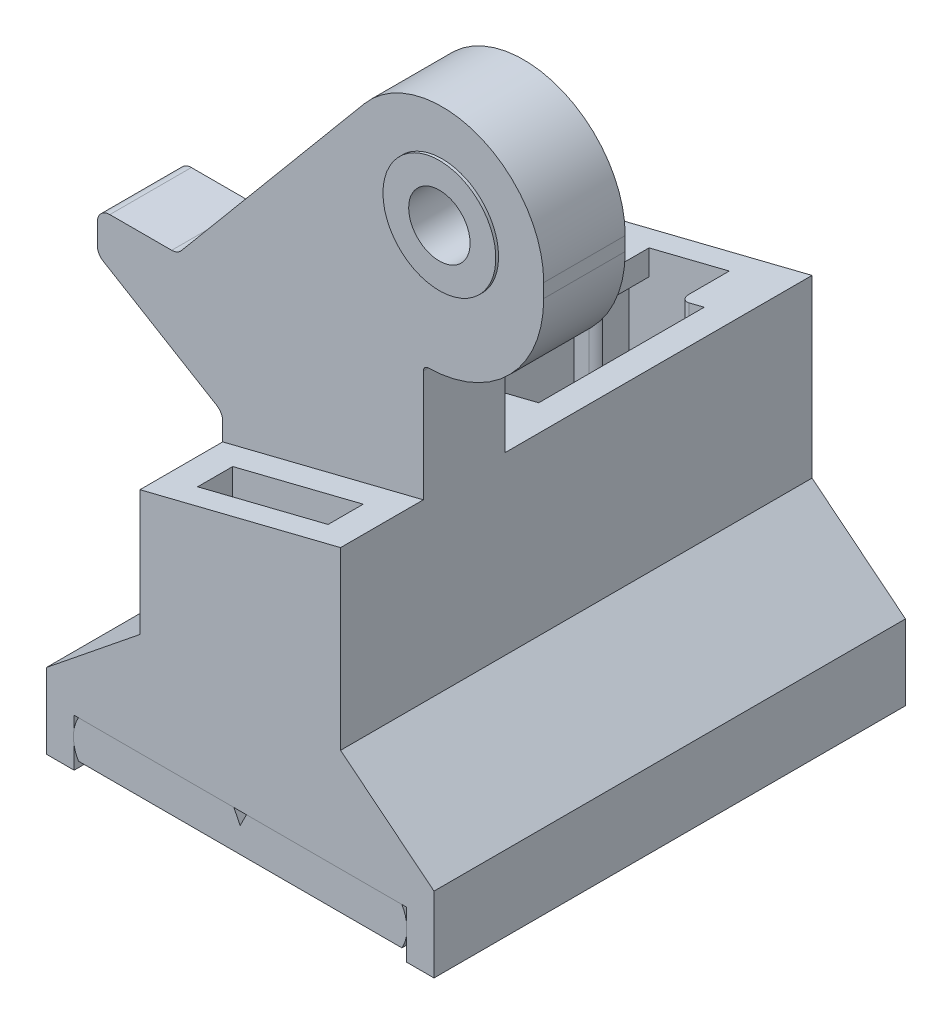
ISO-10303-21;
HEADER;
FILE_DESCRIPTION(('STEP AP214'),'2;1');
FILE_NAME('part.step','',(''),(''),'','','');
FILE_SCHEMA(('AUTOMOTIVE_DESIGN { 1 0 10303 214 1 1 1 1 }'));
ENDSEC;
DATA;
#1=APPLICATION_CONTEXT('core data for automotive mechanical design processes');
#2=APPLICATION_PROTOCOL_DEFINITION('international standard','automotive_design',2000,#1);
#3=PRODUCT_CONTEXT('',#1,'mechanical');
#4=PRODUCT('Part','Part','',(#3));
#5=PRODUCT_RELATED_PRODUCT_CATEGORY('part','',(#4));
#6=PRODUCT_DEFINITION_FORMATION('','',#4);
#7=PRODUCT_DEFINITION_CONTEXT('part definition',#1,'design');
#8=PRODUCT_DEFINITION('design','',#6,#7);
#9=PRODUCT_DEFINITION_SHAPE('','',#8);
#10=(LENGTH_UNIT() NAMED_UNIT(*) SI_UNIT(.MILLI.,.METRE.));
#11=(NAMED_UNIT(*) PLANE_ANGLE_UNIT() SI_UNIT($,.RADIAN.));
#12=(NAMED_UNIT(*) SI_UNIT($,.STERADIAN.) SOLID_ANGLE_UNIT());
#13=UNCERTAINTY_MEASURE_WITH_UNIT(LENGTH_MEASURE(1.E-05),#10,'distance_accuracy_value','');
#14=(GEOMETRIC_REPRESENTATION_CONTEXT(3) GLOBAL_UNCERTAINTY_ASSIGNED_CONTEXT((#13)) GLOBAL_UNIT_ASSIGNED_CONTEXT((#10,
#11,#12)) REPRESENTATION_CONTEXT('',''));
#15=CARTESIAN_POINT('',(0.,0.,0.));
#16=DIRECTION('',(0.,0.,1.));
#17=DIRECTION('',(1.,0.,0.));
#18=AXIS2_PLACEMENT_3D('',#15,#16,#17);
#19=CARTESIAN_POINT('',(2.47389636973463,9.7905544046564,33.16));
#20=DIRECTION('',(0.,0.,-1.));
#21=DIRECTION('',(-1.,0.,0.));
#22=AXIS2_PLACEMENT_3D('',#19,#20,#21);
#23=CYLINDRICAL_SURFACE('',#22,1.225);
#24=CARTESIAN_POINT('',(2.47389636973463,9.7905544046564,29.69));
#25=DIRECTION('',(0.,0.,-1.));
#26=DIRECTION('',(-1.,0.,0.));
#27=AXIS2_PLACEMENT_3D('',#24,#25,#26);
#28=CIRCLE('',#27,1.225);
#29=CARTESIAN_POINT('',(1.24889636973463,9.7905544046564,29.69));
#30=VERTEX_POINT('',#29);
#31=EDGE_CURVE('P0_E34',#30,#30,#28,.T.);
#32=ORIENTED_EDGE('',*,*,#31,.T.);
#33=EDGE_LOOP('',(#32));
#34=FACE_BOUND('',#33,.T.);
#35=CARTESIAN_POINT('',(2.47389636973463,9.7905544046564,33.16));
#36=DIRECTION('',(0.,0.,-1.));
#37=DIRECTION('',(-1.,0.,0.));
#38=AXIS2_PLACEMENT_3D('',#35,#36,#37);
#39=CIRCLE('',#38,1.225);
#40=CARTESIAN_POINT('',(1.24889636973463,9.7905544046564,33.16));
#41=VERTEX_POINT('',#40);
#42=EDGE_CURVE('P0_E25',#41,#41,#39,.T.);
#43=ORIENTED_EDGE('',*,*,#42,.F.);
#44=EDGE_LOOP('',(#43));
#45=FACE_BOUND('',#44,.T.);
#46=ADVANCED_FACE('P0_F22',(#34,#45),#23,.F.);
#47=CARTESIAN_POINT('',(2.47389636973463,9.7905544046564,33.16));
#48=DIRECTION('',(0.,0.,1.));
#49=DIRECTION('',(1.,0.,0.));
#50=AXIS2_PLACEMENT_3D('',#47,#48,#49);
#51=PLANE('',#50);
#52=ORIENTED_EDGE('',*,*,#42,.T.);
#53=EDGE_LOOP('',(#52));
#54=FACE_BOUND('',#53,.T.);
#55=CARTESIAN_POINT('',(2.47389636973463,9.7905544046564,33.16));
#56=DIRECTION('',(0.,0.,-1.));
#57=DIRECTION('',(-1.,0.,0.));
#58=AXIS2_PLACEMENT_3D('',#55,#56,#57);
#59=CIRCLE('',#58,2.25);
#60=CARTESIAN_POINT('',(0.223896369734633,9.7905544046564,33.16));
#61=VERTEX_POINT('',#60);
#62=EDGE_CURVE('P0_E29',#61,#61,#59,.T.);
#63=ORIENTED_EDGE('',*,*,#62,.F.);
#64=EDGE_LOOP('',(#63));
#65=FACE_BOUND('',#64,.T.);
#66=ADVANCED_FACE('P0_F42',(#54,#65),#51,.T.);
#67=CARTESIAN_POINT('',(2.47389636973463,9.7905544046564,29.69));
#68=DIRECTION('',(0.,0.,1.));
#69=DIRECTION('',(1.,0.,0.));
#70=AXIS2_PLACEMENT_3D('',#67,#68,#69);
#71=PLANE('',#70);
#72=ORIENTED_EDGE('',*,*,#31,.F.);
#73=EDGE_LOOP('',(#72));
#74=FACE_BOUND('',#73,.T.);
#75=CARTESIAN_POINT('',(2.47389636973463,9.7905544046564,29.69));
#76=DIRECTION('',(0.,0.,-1.));
#77=DIRECTION('',(-1.,0.,0.));
#78=AXIS2_PLACEMENT_3D('',#75,#76,#77);
#79=CIRCLE('',#78,2.25);
#80=CARTESIAN_POINT('',(0.223896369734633,9.7905544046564,29.69));
#81=VERTEX_POINT('',#80);
#82=EDGE_CURVE('P0_E12',#81,#81,#79,.F.);
#83=ORIENTED_EDGE('',*,*,#82,.F.);
#84=EDGE_LOOP('',(#83));
#85=FACE_BOUND('',#84,.T.);
#86=ADVANCED_FACE('P0_F50',(#74,#85),#71,.F.);
#87=CARTESIAN_POINT('',(2.47389636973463,9.7905544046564,33.16));
#88=DIRECTION('',(0.,0.,-1.));
#89=DIRECTION('',(-1.,0.,0.));
#90=AXIS2_PLACEMENT_3D('',#87,#88,#89);
#91=CYLINDRICAL_SURFACE('',#90,2.25);
#92=ORIENTED_EDGE('',*,*,#82,.T.);
#93=EDGE_LOOP('',(#92));
#94=FACE_BOUND('',#93,.T.);
#95=ORIENTED_EDGE('',*,*,#62,.T.);
#96=EDGE_LOOP('',(#95));
#97=FACE_BOUND('',#96,.T.);
#98=ADVANCED_FACE('P0_F51',(#94,#97),#91,.T.);
#99=CLOSED_SHELL('',(#46,#66,#86,#98));
#100=MANIFOLD_SOLID_BREP('P0_B1',#99);
#101=CARTESIAN_POINT('',(-6.39998671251,-3.46786279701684,36.35));
#102=DIRECTION('',(0.894427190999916,0.447213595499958,0.));
#103=DIRECTION('',(0.447213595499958,-0.894427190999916,0.));
#104=AXIS2_PLACEMENT_3D('',#101,#102,#103);
#105=PLANE('',#104);
#106=DIRECTION('',(0.,0.,-1.));
#107=VECTOR('',#106,1.);
#108=CARTESIAN_POINT('',(-2.52919531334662,-11.2094455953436,17.45));
#109=LINE('',#108,#107);
#110=CARTESIAN_POINT('',(-2.52919531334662,-11.2094455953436,17.55));
#111=VERTEX_POINT('',#110);
#112=CARTESIAN_POINT('',(-2.52919531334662,-11.2094455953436,36.35));
#113=VERTEX_POINT('',#112);
#114=EDGE_CURVE('P1_E85',#111,#113,#109,.F.);
#115=ORIENTED_EDGE('',*,*,#114,.T.);
#116=DIRECTION('',(0.447213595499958,-0.894427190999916,0.));
#117=VECTOR('',#116,1.);
#118=CARTESIAN_POINT('',(-6.39998671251,-3.46786279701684,36.35));
#119=LINE('',#118,#117);
#120=CARTESIAN_POINT('',(-2.27919531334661,-11.7094455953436,36.35));
#121=VERTEX_POINT('',#120);
#122=EDGE_CURVE('P1_E63',#113,#121,#119,.T.);
#123=ORIENTED_EDGE('',*,*,#122,.T.);
#124=DIRECTION('',(0.,0.,-1.));
#125=VECTOR('',#124,1.);
#126=CARTESIAN_POINT('',(-2.27919531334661,-11.7094455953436,36.35));
#127=LINE('',#126,#125);
#128=CARTESIAN_POINT('',(-2.27919531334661,-11.7094455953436,17.55));
#129=VERTEX_POINT('',#128);
#130=EDGE_CURVE('P1_E83',#129,#121,#127,.F.);
#131=ORIENTED_EDGE('',*,*,#130,.F.);
#132=DIRECTION('',(0.447213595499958,-0.894427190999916,0.));
#133=VECTOR('',#132,1.);
#134=CARTESIAN_POINT('',(-6.39998671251,-3.46786279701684,17.55));
#135=LINE('',#134,#133);
#136=EDGE_CURVE('P1_E86',#129,#111,#135,.F.);
#137=ORIENTED_EDGE('',*,*,#136,.T.);
#138=EDGE_LOOP('',(#115,#123,#131,#137));
#139=FACE_BOUND('',#138,.T.);
#140=ADVANCED_FACE('P1_F16',(#139),#105,.T.);
#141=CARTESIAN_POINT('',(1.84159608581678,-3.46786279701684,36.35));
#142=DIRECTION('',(-0.894427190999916,0.447213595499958,0.));
#143=DIRECTION('',(0.447213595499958,0.894427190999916,0.));
#144=AXIS2_PLACEMENT_3D('',#141,#142,#143);
#145=PLANE('',#144);
#146=ORIENTED_EDGE('',*,*,#130,.T.);
#147=DIRECTION('',(0.447213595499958,0.894427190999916,0.));
#148=VECTOR('',#147,1.);
#149=CARTESIAN_POINT('',(1.84159608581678,-3.46786279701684,36.35));
#150=LINE('',#149,#148);
#151=CARTESIAN_POINT('',(-2.02919531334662,-11.2094455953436,36.35));
#152=VERTEX_POINT('',#151);
#153=EDGE_CURVE('P1_E89',#121,#152,#150,.T.);
#154=ORIENTED_EDGE('',*,*,#153,.T.);
#155=DIRECTION('',(0.,0.,-1.));
#156=VECTOR('',#155,1.);
#157=CARTESIAN_POINT('',(-2.02919531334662,-11.2094455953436,17.45));
#158=LINE('',#157,#156);
#159=CARTESIAN_POINT('',(-2.02919531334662,-11.2094455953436,17.55));
#160=VERTEX_POINT('',#159);
#161=EDGE_CURVE('P1_E98',#152,#160,#158,.T.);
#162=ORIENTED_EDGE('',*,*,#161,.T.);
#163=DIRECTION('',(0.447213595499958,0.894427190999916,0.));
#164=VECTOR('',#163,1.);
#165=CARTESIAN_POINT('',(1.84159608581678,-3.46786279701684,17.55));
#166=LINE('',#165,#164);
#167=EDGE_CURVE('P1_E79',#160,#129,#166,.F.);
#168=ORIENTED_EDGE('',*,*,#167,.T.);
#169=EDGE_LOOP('',(#146,#154,#162,#168));
#170=FACE_BOUND('',#169,.T.);
#171=ADVANCED_FACE('P1_F88',(#170),#145,.T.);
#172=CARTESIAN_POINT('',(-8.92919531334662,-11.2094455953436,17.45));
#173=DIRECTION('',(0.,-1.,0.));
#174=DIRECTION('',(0.,0.,-1.));
#175=AXIS2_PLACEMENT_3D('',#172,#173,#174);
#176=PLANE('',#175);
#177=DIRECTION('',(0.,0.,1.));
#178=VECTOR('',#177,1.);
#179=CARTESIAN_POINT('',(-8.72823341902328,-11.2094455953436,36.35));
#180=LINE('',#179,#178);
#181=CARTESIAN_POINT('',(-8.72823341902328,-11.2094455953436,36.35));
#182=VERTEX_POINT('',#181);
#183=CARTESIAN_POINT('',(-8.72823341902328,-11.2094455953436,17.55));
#184=VERTEX_POINT('',#183);
#185=EDGE_CURVE('P1_E102',#182,#184,#180,.F.);
#186=ORIENTED_EDGE('',*,*,#185,.F.);
#187=DIRECTION('',(1.,0.,0.));
#188=VECTOR('',#187,1.);
#189=CARTESIAN_POINT('',(4.37080468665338,-11.2094455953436,36.35));
#190=LINE('',#189,#188);
#191=EDGE_CURVE('P1_E57',#113,#182,#190,.F.);
#192=ORIENTED_EDGE('',*,*,#191,.F.);
#193=ORIENTED_EDGE('',*,*,#114,.F.);
#194=DIRECTION('',(1.,0.,0.));
#195=VECTOR('',#194,1.);
#196=CARTESIAN_POINT('',(-7.42919531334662,-11.2094455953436,17.55));
#197=LINE('',#196,#195);
#198=EDGE_CURVE('P1_E121',#184,#111,#197,.T.);
#199=ORIENTED_EDGE('',*,*,#198,.F.);
#200=EDGE_LOOP('',(#186,#192,#193,#199));
#201=FACE_BOUND('',#200,.T.);
#202=ADVANCED_FACE('P1_F166',(#201),#176,.F.);
#203=CARTESIAN_POINT('',(-8.92919531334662,-11.2094455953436,17.45));
#204=DIRECTION('',(0.,-1.,0.));
#205=DIRECTION('',(0.,0.,-1.));
#206=AXIS2_PLACEMENT_3D('',#203,#204,#205);
#207=PLANE('',#206);
#208=ORIENTED_EDGE('',*,*,#161,.F.);
#209=DIRECTION('',(1.,0.,0.));
#210=VECTOR('',#209,1.);
#211=CARTESIAN_POINT('',(4.37080468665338,-11.2094455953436,36.35));
#212=LINE('',#211,#210);
#213=CARTESIAN_POINT('',(4.16984279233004,-11.2094455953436,36.35));
#214=VERTEX_POINT('',#213);
#215=EDGE_CURVE('P1_E96',#214,#152,#212,.F.);
#216=ORIENTED_EDGE('',*,*,#215,.F.);
#217=DIRECTION('',(0.,0.,1.));
#218=VECTOR('',#217,1.);
#219=CARTESIAN_POINT('',(4.16984279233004,-11.2094455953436,36.35));
#220=LINE('',#219,#218);
#221=CARTESIAN_POINT('',(4.16984279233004,-11.2094455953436,17.55));
#222=VERTEX_POINT('',#221);
#223=EDGE_CURVE('P1_E123',#222,#214,#220,.T.);
#224=ORIENTED_EDGE('',*,*,#223,.F.);
#225=DIRECTION('',(1.,0.,0.));
#226=VECTOR('',#225,1.);
#227=CARTESIAN_POINT('',(-7.42919531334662,-11.2094455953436,17.55));
#228=LINE('',#227,#226);
#229=EDGE_CURVE('P1_E118',#160,#222,#228,.T.);
#230=ORIENTED_EDGE('',*,*,#229,.F.);
#231=EDGE_LOOP('',(#208,#216,#224,#230));
#232=FACE_BOUND('',#231,.T.);
#233=ADVANCED_FACE('P1_F158',(#232),#207,.F.);
#234=CARTESIAN_POINT('',(-7.42919531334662,-11.9594455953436,36.35));
#235=DIRECTION('',(0.,0.,1.));
#236=DIRECTION('',(0.,-1.,0.));
#237=AXIS2_PLACEMENT_3D('',#234,#235,#236);
#238=CYLINDRICAL_SURFACE('',#237,1.5);
#239=DIRECTION('',(0.,0.,1.));
#240=VECTOR('',#239,1.);
#241=CARTESIAN_POINT('',(-8.72823341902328,-12.7094455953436,17.45));
#242=LINE('',#241,#240);
#243=CARTESIAN_POINT('',(-8.72823341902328,-12.7094455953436,17.55));
#244=VERTEX_POINT('',#243);
#245=CARTESIAN_POINT('',(-8.72823341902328,-12.7094455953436,36.35));
#246=VERTEX_POINT('',#245);
#247=EDGE_CURVE('P1_E117',#244,#246,#242,.T.);
#248=ORIENTED_EDGE('',*,*,#247,.T.);
#249=CARTESIAN_POINT('',(-7.42919531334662,-11.9594455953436,36.35));
#250=DIRECTION('',(0.,0.,1.));
#251=DIRECTION('',(0.,-1.,0.));
#252=AXIS2_PLACEMENT_3D('',#249,#250,#251);
#253=CIRCLE('',#252,1.5);
#254=EDGE_CURVE('P1_E19',#182,#246,#253,.T.);
#255=ORIENTED_EDGE('',*,*,#254,.F.);
#256=ORIENTED_EDGE('',*,*,#185,.T.);
#257=CARTESIAN_POINT('',(-7.42919531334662,-11.9594455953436,17.55));
#258=DIRECTION('',(0.,0.,1.));
#259=DIRECTION('',(0.,-1.,0.));
#260=AXIS2_PLACEMENT_3D('',#257,#258,#259);
#261=CIRCLE('',#260,1.5);
#262=EDGE_CURVE('P1_E119',#244,#184,#261,.F.);
#263=ORIENTED_EDGE('',*,*,#262,.F.);
#264=EDGE_LOOP('',(#248,#255,#256,#263));
#265=FACE_BOUND('',#264,.T.);
#266=ADVANCED_FACE('P1_F163',(#265),#238,.T.);
#267=CARTESIAN_POINT('',(4.37080468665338,-11.2094455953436,36.35));
#268=DIRECTION('',(0.,0.,1.));
#269=DIRECTION('',(0.,-1.,0.));
#270=AXIS2_PLACEMENT_3D('',#267,#268,#269);
#271=PLANE('',#270);
#272=CARTESIAN_POINT('',(2.87080468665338,-11.9594455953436,36.35));
#273=DIRECTION('',(0.,0.,1.));
#274=DIRECTION('',(0.,-1.,0.));
#275=AXIS2_PLACEMENT_3D('',#272,#273,#274);
#276=CIRCLE('',#275,1.5);
#277=CARTESIAN_POINT('',(4.16984279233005,-12.7094455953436,36.35));
#278=VERTEX_POINT('',#277);
#279=EDGE_CURVE('P1_E122',#214,#278,#276,.F.);
#280=ORIENTED_EDGE('',*,*,#279,.F.);
#281=ORIENTED_EDGE('',*,*,#215,.T.);
#282=ORIENTED_EDGE('',*,*,#153,.F.);
#283=ORIENTED_EDGE('',*,*,#122,.F.);
#284=ORIENTED_EDGE('',*,*,#191,.T.);
#285=ORIENTED_EDGE('',*,*,#254,.T.);
#286=DIRECTION('',(1.,0.,0.));
#287=VECTOR('',#286,1.);
#288=CARTESIAN_POINT('',(-8.92919531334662,-12.7094455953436,36.35));
#289=LINE('',#288,#287);
#290=EDGE_CURVE('P1_E144',#246,#278,#289,.T.);
#291=ORIENTED_EDGE('',*,*,#290,.T.);
#292=EDGE_LOOP('',(#280,#281,#282,#283,#284,#285,#291));
#293=FACE_BOUND('',#292,.T.);
#294=ADVANCED_FACE('P1_F94',(#293),#271,.T.);
#295=CARTESIAN_POINT('',(2.87080468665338,-11.9594455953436,36.35));
#296=DIRECTION('',(0.,0.,1.));
#297=DIRECTION('',(0.,-1.,0.));
#298=AXIS2_PLACEMENT_3D('',#295,#296,#297);
#299=CYLINDRICAL_SURFACE('',#298,1.5);
#300=ORIENTED_EDGE('',*,*,#223,.T.);
#301=ORIENTED_EDGE('',*,*,#279,.T.);
#302=DIRECTION('',(0.,0.,1.));
#303=VECTOR('',#302,1.);
#304=CARTESIAN_POINT('',(4.16984279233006,-12.7094455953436,17.45));
#305=LINE('',#304,#303);
#306=CARTESIAN_POINT('',(4.16984279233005,-12.7094455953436,17.55));
#307=VERTEX_POINT('',#306);
#308=EDGE_CURVE('P1_E25',#278,#307,#305,.F.);
#309=ORIENTED_EDGE('',*,*,#308,.T.);
#310=CARTESIAN_POINT('',(2.87080468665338,-11.9594455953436,17.55));
#311=DIRECTION('',(0.,0.,1.));
#312=DIRECTION('',(0.,-1.,0.));
#313=AXIS2_PLACEMENT_3D('',#310,#311,#312);
#314=CIRCLE('',#313,1.5);
#315=EDGE_CURVE('P1_E33',#222,#307,#314,.F.);
#316=ORIENTED_EDGE('',*,*,#315,.F.);
#317=EDGE_LOOP('',(#300,#301,#309,#316));
#318=FACE_BOUND('',#317,.T.);
#319=ADVANCED_FACE('P1_F159',(#318),#299,.T.);
#320=CARTESIAN_POINT('',(-7.42919531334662,-11.9594455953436,17.55));
#321=DIRECTION('',(0.,0.,-1.));
#322=DIRECTION('',(0.,1.,0.));
#323=AXIS2_PLACEMENT_3D('',#320,#321,#322);
#324=PLANE('',#323);
#325=ORIENTED_EDGE('',*,*,#315,.T.);
#326=DIRECTION('',(1.,0.,0.));
#327=VECTOR('',#326,1.);
#328=CARTESIAN_POINT('',(-8.92919531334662,-12.7094455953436,17.55));
#329=LINE('',#328,#327);
#330=EDGE_CURVE('P1_E11',#307,#244,#329,.F.);
#331=ORIENTED_EDGE('',*,*,#330,.T.);
#332=ORIENTED_EDGE('',*,*,#262,.T.);
#333=ORIENTED_EDGE('',*,*,#198,.T.);
#334=ORIENTED_EDGE('',*,*,#136,.F.);
#335=ORIENTED_EDGE('',*,*,#167,.F.);
#336=ORIENTED_EDGE('',*,*,#229,.T.);
#337=EDGE_LOOP('',(#325,#331,#332,#333,#334,#335,#336));
#338=FACE_BOUND('',#337,.T.);
#339=ADVANCED_FACE('P1_F156',(#338),#324,.T.);
#340=CARTESIAN_POINT('',(-8.92919531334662,-12.7094455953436,17.45));
#341=DIRECTION('',(0.,1.,0.));
#342=DIRECTION('',(0.,0.,1.));
#343=AXIS2_PLACEMENT_3D('',#340,#341,#342);
#344=PLANE('',#343);
#345=ORIENTED_EDGE('',*,*,#308,.F.);
#346=ORIENTED_EDGE('',*,*,#290,.F.);
#347=ORIENTED_EDGE('',*,*,#247,.F.);
#348=ORIENTED_EDGE('',*,*,#330,.F.);
#349=EDGE_LOOP('',(#345,#346,#347,#348));
#350=FACE_BOUND('',#349,.T.);
#351=ADVANCED_FACE('P1_F162',(#350),#344,.F.);
#352=CLOSED_SHELL('',(#140,#171,#202,#233,#266,#294,#319,#339,#351));
#353=MANIFOLD_SOLID_BREP('P1_B1',#352);
#354=CARTESIAN_POINT('',(-4.27610363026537,-13.1094455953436,20.05));
#355=DIRECTION('',(0.,-1.,0.));
#356=DIRECTION('',(0.,0.,-1.));
#357=AXIS2_PLACEMENT_3D('',#354,#355,#356);
#358=CYLINDRICAL_SURFACE('',#357,0.4);
#359=CARTESIAN_POINT('',(-4.27610363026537,-10.2094455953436,20.05));
#360=DIRECTION('',(0.,-1.,0.));
#361=DIRECTION('',(0.,0.,-1.));
#362=AXIS2_PLACEMENT_3D('',#359,#360,#361);
#363=CIRCLE('',#362,0.4);
#364=CARTESIAN_POINT('',(-4.27610363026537,-10.2094455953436,20.45));
#365=VERTEX_POINT('',#364);
#366=CARTESIAN_POINT('',(-3.9296934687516,-10.2094455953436,20.25));
#367=VERTEX_POINT('',#366);
#368=EDGE_CURVE('P2_E360',#365,#367,#363,.F.);
#369=ORIENTED_EDGE('',*,*,#368,.T.);
#370=DIRECTION('',(0.,1.,0.));
#371=VECTOR('',#370,1.);
#372=CARTESIAN_POINT('',(-3.9296934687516,-2.5094455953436,20.25));
#373=LINE('',#372,#371);
#374=CARTESIAN_POINT('',(-3.9296934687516,-2.5094455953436,20.25));
#375=VERTEX_POINT('',#374);
#376=EDGE_CURVE('P2_E370',#367,#375,#373,.T.);
#377=ORIENTED_EDGE('',*,*,#376,.T.);
#378=CARTESIAN_POINT('',(-4.27610363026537,-2.5094455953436,20.05));
#379=DIRECTION('',(0.,-1.,0.));
#380=DIRECTION('',(0.,0.,-1.));
#381=AXIS2_PLACEMENT_3D('',#378,#379,#380);
#382=CIRCLE('',#381,0.4);
#383=CARTESIAN_POINT('',(-3.87610363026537,-2.5094455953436,20.05));
#384=VERTEX_POINT('',#383);
#385=EDGE_CURVE('P2_E364',#384,#375,#382,.T.);
#386=ORIENTED_EDGE('',*,*,#385,.F.);
#387=DIRECTION('',(0.,-1.,0.));
#388=VECTOR('',#387,1.);
#389=CARTESIAN_POINT('',(-3.87610363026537,-13.1094455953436,20.05));
#390=LINE('',#389,#388);
#391=CARTESIAN_POINT('',(-3.87610363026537,-1.5094455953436,20.05));
#392=VERTEX_POINT('',#391);
#393=EDGE_CURVE('P2_E218',#384,#392,#390,.F.);
#394=ORIENTED_EDGE('',*,*,#393,.T.);
#395=CARTESIAN_POINT('',(-4.27610363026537,-1.6094455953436,20.05));
#396=DIRECTION('',(0.242535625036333,-0.970142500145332,0.));
#397=DIRECTION('',(-0.970142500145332,-0.242535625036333,0.));
#398=AXIS2_PLACEMENT_3D('',#395,#396,#397);
#399=ELLIPSE('',#398,0.412310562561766,0.4);
#400=CARTESIAN_POINT('',(-4.27610363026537,-1.60944559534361,20.45));
#401=VERTEX_POINT('',#400);
#402=EDGE_CURVE('P2_E27',#392,#401,#399,.T.);
#403=ORIENTED_EDGE('',*,*,#402,.T.);
#404=DIRECTION('',(0.,1.,0.));
#405=VECTOR('',#404,1.);
#406=CARTESIAN_POINT('',(-4.27610363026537,-13.1094455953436,20.45));
#407=LINE('',#406,#405);
#408=EDGE_CURVE('P2_E419',#365,#401,#407,.T.);
#409=ORIENTED_EDGE('',*,*,#408,.F.);
#410=EDGE_LOOP('',(#369,#377,#386,#394,#403,#409));
#411=FACE_BOUND('',#410,.T.);
#412=ADVANCED_FACE('P2_F24',(#411),#358,.T.);
#413=CARTESIAN_POINT('',(-3.87610363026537,-2.5094455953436,20.25));
#414=DIRECTION('',(0.,0.,1.));
#415=DIRECTION('',(1.,0.,0.));
#416=AXIS2_PLACEMENT_3D('',#413,#414,#415);
#417=PLANE('',#416);
#418=ORIENTED_EDGE('',*,*,#376,.F.);
#419=DIRECTION('',(1.,0.,0.));
#420=VECTOR('',#419,1.);
#421=CARTESIAN_POINT('',(-3.87610363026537,-10.2094455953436,20.25));
#422=LINE('',#421,#420);
#423=CARTESIAN_POINT('',(-4.67610363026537,-10.2094455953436,20.25));
#424=VERTEX_POINT('',#423);
#425=EDGE_CURVE('P2_E362',#367,#424,#422,.F.);
#426=ORIENTED_EDGE('',*,*,#425,.T.);
#427=DIRECTION('',(0.,1.,0.));
#428=VECTOR('',#427,1.);
#429=CARTESIAN_POINT('',(-4.67610363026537,-2.5094455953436,20.25));
#430=LINE('',#429,#428);
#431=CARTESIAN_POINT('',(-4.67610363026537,-2.5094455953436,20.25));
#432=VERTEX_POINT('',#431);
#433=EDGE_CURVE('P2_E386',#424,#432,#430,.T.);
#434=ORIENTED_EDGE('',*,*,#433,.T.);
#435=DIRECTION('',(1.,0.,0.));
#436=VECTOR('',#435,1.);
#437=CARTESIAN_POINT('',(-10.0011036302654,-2.5094455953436,20.25));
#438=LINE('',#437,#436);
#439=EDGE_CURVE('P2_E365',#375,#432,#438,.F.);
#440=ORIENTED_EDGE('',*,*,#439,.F.);
#441=EDGE_LOOP('',(#418,#426,#434,#440));
#442=FACE_BOUND('',#441,.T.);
#443=ADVANCED_FACE('P2_F2324',(#442),#417,.F.);
#444=CARTESIAN_POINT('',(-10.0011036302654,-2.5094455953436,17.55));
#445=DIRECTION('',(0.,-1.,0.));
#446=DIRECTION('',(0.,0.,-1.));
#447=AXIS2_PLACEMENT_3D('',#444,#445,#446);
#448=PLANE('',#447);
#449=DIRECTION('',(0.,0.,1.));
#450=VECTOR('',#449,1.);
#451=CARTESIAN_POINT('',(-4.67610363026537,-2.5094455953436,18.45));
#452=LINE('',#451,#450);
#453=CARTESIAN_POINT('',(-4.67610363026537,-2.5094455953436,18.45));
#454=VERTEX_POINT('',#453);
#455=EDGE_CURVE('P2_E497',#432,#454,#452,.F.);
#456=ORIENTED_EDGE('',*,*,#455,.T.);
#457=DIRECTION('',(1.,0.,0.));
#458=VECTOR('',#457,1.);
#459=CARTESIAN_POINT('',(-10.0011036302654,-2.5094455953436,18.45));
#460=LINE('',#459,#458);
#461=CARTESIAN_POINT('',(-3.87610363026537,-2.5094455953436,18.45));
#462=VERTEX_POINT('',#461);
#463=EDGE_CURVE('P2_E225',#454,#462,#460,.T.);
#464=ORIENTED_EDGE('',*,*,#463,.T.);
#465=DIRECTION('',(0.,0.,-1.));
#466=VECTOR('',#465,1.);
#467=CARTESIAN_POINT('',(-3.87610363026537,-2.5094455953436,17.55));
#468=LINE('',#467,#466);
#469=EDGE_CURVE('P2_E366',#462,#384,#468,.F.);
#470=ORIENTED_EDGE('',*,*,#469,.T.);
#471=ORIENTED_EDGE('',*,*,#385,.T.);
#472=ORIENTED_EDGE('',*,*,#439,.T.);
#473=EDGE_LOOP('',(#456,#464,#470,#471,#472));
#474=FACE_BOUND('',#473,.T.);
#475=ADVANCED_FACE('P2_F2315',(#474),#448,.T.);
#476=CARTESIAN_POINT('',(-3.87610363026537,-10.2094455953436,28.8168873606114));
#477=DIRECTION('',(0.,1.,0.));
#478=DIRECTION('',(0.,0.,1.));
#479=AXIS2_PLACEMENT_3D('',#476,#477,#478);
#480=PLANE('',#479);
#481=ORIENTED_EDGE('',*,*,#368,.F.);
#482=DIRECTION('',(1.,0.,0.));
#483=VECTOR('',#482,1.);
#484=CARTESIAN_POINT('',(-10.0011036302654,-10.2094455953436,20.45));
#485=LINE('',#484,#483);
#486=CARTESIAN_POINT('',(-4.87610363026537,-10.2094455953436,20.45));
#487=VERTEX_POINT('',#486);
#488=EDGE_CURVE('P2_E423',#487,#365,#485,.T.);
#489=ORIENTED_EDGE('',*,*,#488,.F.);
#490=DIRECTION('',(0.,0.,-1.));
#491=VECTOR('',#490,1.);
#492=CARTESIAN_POINT('',(-4.87610363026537,-10.2094455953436,28.8168873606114));
#493=LINE('',#492,#491);
#494=CARTESIAN_POINT('',(-4.87610363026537,-10.2094455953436,18.45));
#495=VERTEX_POINT('',#494);
#496=EDGE_CURVE('P2_E448',#487,#495,#493,.T.);
#497=ORIENTED_EDGE('',*,*,#496,.T.);
#498=DIRECTION('',(1.,0.,0.));
#499=VECTOR('',#498,1.);
#500=CARTESIAN_POINT('',(-3.87610363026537,-10.2094455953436,18.45));
#501=LINE('',#500,#499);
#502=CARTESIAN_POINT('',(-4.67610363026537,-10.2094455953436,18.45));
#503=VERTEX_POINT('',#502);
#504=EDGE_CURVE('P2_E363',#503,#495,#501,.F.);
#505=ORIENTED_EDGE('',*,*,#504,.F.);
#506=DIRECTION('',(0.,0.,1.));
#507=VECTOR('',#506,1.);
#508=CARTESIAN_POINT('',(-4.67610363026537,-10.2094455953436,18.45));
#509=LINE('',#508,#507);
#510=EDGE_CURVE('P2_E452',#503,#424,#509,.T.);
#511=ORIENTED_EDGE('',*,*,#510,.T.);
#512=ORIENTED_EDGE('',*,*,#425,.F.);
#513=EDGE_LOOP('',(#481,#489,#497,#505,#511,#512));
#514=FACE_BOUND('',#513,.T.);
#515=ADVANCED_FACE('P2_F874',(#514),#480,.F.);
#516=CARTESIAN_POINT('',(-10.0011036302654,-2.5094455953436,17.55));
#517=DIRECTION('',(0.,1.,0.));
#518=DIRECTION('',(0.,0.,1.));
#519=AXIS2_PLACEMENT_3D('',#516,#517,#518);
#520=PLANE('',#519);
#521=CARTESIAN_POINT('',(-0.276103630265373,-2.5094455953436,20.05));
#522=DIRECTION('',(0.,1.,0.));
#523=DIRECTION('',(-1.,0.,0.));
#524=AXIS2_PLACEMENT_3D('',#521,#522,#523);
#525=CIRCLE('',#524,0.399999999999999);
#526=CARTESIAN_POINT('',(-0.67610363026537,-2.5094455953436,20.05));
#527=VERTEX_POINT('',#526);
#528=CARTESIAN_POINT('',(-0.622513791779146,-2.5094455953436,20.25));
#529=VERTEX_POINT('',#528);
#530=EDGE_CURVE('P2_E355',#527,#529,#525,.T.);
#531=ORIENTED_EDGE('',*,*,#530,.F.);
#532=DIRECTION('',(0.,0.,1.));
#533=VECTOR('',#532,1.);
#534=CARTESIAN_POINT('',(-0.67610363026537,-2.5094455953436,17.55));
#535=LINE('',#534,#533);
#536=CARTESIAN_POINT('',(-0.67610363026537,-2.5094455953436,18.45));
#537=VERTEX_POINT('',#536);
#538=EDGE_CURVE('P2_E465',#537,#527,#535,.T.);
#539=ORIENTED_EDGE('',*,*,#538,.F.);
#540=DIRECTION('',(1.,0.,0.));
#541=VECTOR('',#540,1.);
#542=CARTESIAN_POINT('',(-10.0011036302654,-2.5094455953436,18.45));
#543=LINE('',#542,#541);
#544=CARTESIAN_POINT('',(0.123896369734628,-2.5094455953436,18.45));
#545=VERTEX_POINT('',#544);
#546=EDGE_CURVE('P2_E483',#545,#537,#543,.F.);
#547=ORIENTED_EDGE('',*,*,#546,.F.);
#548=DIRECTION('',(0.,0.,-1.));
#549=VECTOR('',#548,1.);
#550=CARTESIAN_POINT('',(0.123896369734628,-2.5094455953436,18.45));
#551=LINE('',#550,#549);
#552=CARTESIAN_POINT('',(0.123896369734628,-2.5094455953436,20.25));
#553=VERTEX_POINT('',#552);
#554=EDGE_CURVE('P2_E392',#545,#553,#551,.F.);
#555=ORIENTED_EDGE('',*,*,#554,.T.);
#556=DIRECTION('',(1.,0.,0.));
#557=VECTOR('',#556,1.);
#558=CARTESIAN_POINT('',(-0.67610363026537,-2.5094455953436,20.25));
#559=LINE('',#558,#557);
#560=EDGE_CURVE('P2_E461',#553,#529,#559,.F.);
#561=ORIENTED_EDGE('',*,*,#560,.T.);
#562=EDGE_LOOP('',(#531,#539,#547,#555,#561));
#563=FACE_BOUND('',#562,.T.);
#564=ADVANCED_FACE('P2_F1392',(#563),#520,.F.);
#565=CARTESIAN_POINT('',(-0.67610363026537,-2.5094455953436,20.25));
#566=DIRECTION('',(0.,0.,1.));
#567=DIRECTION('',(1.,0.,0.));
#568=AXIS2_PLACEMENT_3D('',#565,#566,#567);
#569=PLANE('',#568);
#570=DIRECTION('',(0.,1.,0.));
#571=VECTOR('',#570,1.);
#572=CARTESIAN_POINT('',(-0.622513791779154,-13.1094455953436,20.25));
#573=LINE('',#572,#571);
#574=CARTESIAN_POINT('',(-0.622513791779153,-10.2094455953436,20.25));
#575=VERTEX_POINT('',#574);
#576=EDGE_CURVE('P2_E354',#529,#575,#573,.F.);
#577=ORIENTED_EDGE('',*,*,#576,.F.);
#578=ORIENTED_EDGE('',*,*,#560,.F.);
#579=DIRECTION('',(0.,1.,0.));
#580=VECTOR('',#579,1.);
#581=CARTESIAN_POINT('',(0.123896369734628,-2.5094455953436,20.25));
#582=LINE('',#581,#580);
#583=CARTESIAN_POINT('',(0.123896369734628,-10.2094455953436,20.25));
#584=VERTEX_POINT('',#583);
#585=EDGE_CURVE('P2_E472',#553,#584,#582,.F.);
#586=ORIENTED_EDGE('',*,*,#585,.T.);
#587=DIRECTION('',(-1.,0.,0.));
#588=VECTOR('',#587,1.);
#589=CARTESIAN_POINT('',(0.323896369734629,-10.2094455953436,20.25));
#590=LINE('',#589,#588);
#591=EDGE_CURVE('P2_E359',#584,#575,#590,.T.);
#592=ORIENTED_EDGE('',*,*,#591,.T.);
#593=EDGE_LOOP('',(#577,#578,#586,#592));
#594=FACE_BOUND('',#593,.T.);
#595=ADVANCED_FACE('P2_F1464',(#594),#569,.F.);
#596=CARTESIAN_POINT('',(0.323896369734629,-10.2094455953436,28.8168873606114));
#597=DIRECTION('',(0.,1.,0.));
#598=DIRECTION('',(-1.,0.,0.));
#599=AXIS2_PLACEMENT_3D('',#596,#597,#598);
#600=PLANE('',#599);
#601=CARTESIAN_POINT('',(-0.27610363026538,-10.2094455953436,20.05));
#602=DIRECTION('',(0.,1.,0.));
#603=DIRECTION('',(-1.,0.,0.));
#604=AXIS2_PLACEMENT_3D('',#601,#602,#603);
#605=CIRCLE('',#604,0.399999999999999);
#606=CARTESIAN_POINT('',(-0.276103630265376,-10.2094455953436,20.45));
#607=VERTEX_POINT('',#606);
#608=EDGE_CURVE('P2_E351',#575,#607,#605,.T.);
#609=ORIENTED_EDGE('',*,*,#608,.F.);
#610=ORIENTED_EDGE('',*,*,#591,.F.);
#611=DIRECTION('',(0.,0.,-1.));
#612=VECTOR('',#611,1.);
#613=CARTESIAN_POINT('',(0.123896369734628,-10.2094455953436,18.45));
#614=LINE('',#613,#612);
#615=CARTESIAN_POINT('',(0.123896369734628,-10.2094455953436,18.45));
#616=VERTEX_POINT('',#615);
#617=EDGE_CURVE('P2_E468',#584,#616,#614,.T.);
#618=ORIENTED_EDGE('',*,*,#617,.T.);
#619=DIRECTION('',(-1.,0.,0.));
#620=VECTOR('',#619,1.);
#621=CARTESIAN_POINT('',(0.323896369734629,-10.2094455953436,18.45));
#622=LINE('',#621,#620);
#623=CARTESIAN_POINT('',(0.323896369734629,-10.2094455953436,18.45));
#624=VERTEX_POINT('',#623);
#625=EDGE_CURVE('P2_E464',#624,#616,#622,.T.);
#626=ORIENTED_EDGE('',*,*,#625,.F.);
#627=DIRECTION('',(0.,0.,1.));
#628=VECTOR('',#627,1.);
#629=CARTESIAN_POINT('',(0.323896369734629,-10.2094455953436,28.8168873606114));
#630=LINE('',#629,#628);
#631=CARTESIAN_POINT('',(0.323896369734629,-10.2094455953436,20.45));
#632=VERTEX_POINT('',#631);
#633=EDGE_CURVE('P2_E393',#624,#632,#630,.T.);
#634=ORIENTED_EDGE('',*,*,#633,.T.);
#635=DIRECTION('',(1.,0.,0.));
#636=VECTOR('',#635,1.);
#637=CARTESIAN_POINT('',(-10.0011036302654,-10.2094455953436,20.45));
#638=LINE('',#637,#636);
#639=EDGE_CURVE('P2_E382',#607,#632,#638,.T.);
#640=ORIENTED_EDGE('',*,*,#639,.F.);
#641=EDGE_LOOP('',(#609,#610,#618,#626,#634,#640));
#642=FACE_BOUND('',#641,.T.);
#643=ADVANCED_FACE('P2_F1383',(#642),#600,.F.);
#644=CARTESIAN_POINT('',(-0.276103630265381,-13.1094455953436,20.05));
#645=DIRECTION('',(0.,1.,0.));
#646=DIRECTION('',(-1.,0.,0.));
#647=AXIS2_PLACEMENT_3D('',#644,#645,#646);
#648=CYLINDRICAL_SURFACE('',#647,0.399999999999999);
#649=ORIENTED_EDGE('',*,*,#608,.T.);
#650=DIRECTION('',(0.,1.,0.));
#651=VECTOR('',#650,1.);
#652=CARTESIAN_POINT('',(-0.276103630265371,-13.1094455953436,20.45));
#653=LINE('',#652,#651);
#654=CARTESIAN_POINT('',(-0.276103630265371,-0.609445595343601,20.45));
#655=VERTEX_POINT('',#654);
#656=EDGE_CURVE('P2_E379',#655,#607,#653,.F.);
#657=ORIENTED_EDGE('',*,*,#656,.F.);
#658=CARTESIAN_POINT('',(-0.276103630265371,-0.609445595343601,20.05));
#659=DIRECTION('',(0.242535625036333,-0.970142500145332,0.));
#660=DIRECTION('',(0.970142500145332,0.242535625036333,0.));
#661=AXIS2_PLACEMENT_3D('',#658,#659,#660);
#662=ELLIPSE('',#661,0.412310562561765,0.399999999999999);
#663=CARTESIAN_POINT('',(-0.67610363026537,-0.7094455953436,20.05));
#664=VERTEX_POINT('',#663);
#665=EDGE_CURVE('P2_E357',#655,#664,#662,.T.);
#666=ORIENTED_EDGE('',*,*,#665,.T.);
#667=DIRECTION('',(0.,1.,0.));
#668=VECTOR('',#667,1.);
#669=CARTESIAN_POINT('',(-0.67610363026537,-0.709445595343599,20.05));
#670=LINE('',#669,#668);
#671=EDGE_CURVE('P2_E747',#664,#527,#670,.F.);
#672=ORIENTED_EDGE('',*,*,#671,.T.);
#673=ORIENTED_EDGE('',*,*,#530,.T.);
#674=ORIENTED_EDGE('',*,*,#576,.T.);
#675=EDGE_LOOP('',(#649,#657,#666,#672,#673,#674));
#676=FACE_BOUND('',#675,.T.);
#677=ADVANCED_FACE('P2_F1462',(#676),#648,.T.);
#678=CARTESIAN_POINT('',(-11.2761036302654,2.17364959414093,29.8));
#679=DIRECTION('',(-1.,0.,0.));
#680=DIRECTION('',(0.,0.,1.));
#681=AXIS2_PLACEMENT_3D('',#678,#679,#680);
#682=PLANE('',#681);
#683=DIRECTION('',(0.,1.,0.));
#684=VECTOR('',#683,1.);
#685=CARTESIAN_POINT('',(-11.2761036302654,2.17364959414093,29.8));
#686=LINE('',#685,#684);
#687=CARTESIAN_POINT('',(-11.2761036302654,2.9905544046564,29.8));
#688=VERTEX_POINT('',#687);
#689=CARTESIAN_POINT('',(-11.2761036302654,2.17364959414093,29.8));
#690=VERTEX_POINT('',#689);
#691=EDGE_CURVE('P2_E445',#688,#690,#686,.F.);
#692=ORIENTED_EDGE('',*,*,#691,.T.);
#693=DIRECTION('',(0.,0.,1.));
#694=VECTOR('',#693,1.);
#695=CARTESIAN_POINT('',(-11.2761036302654,2.17364959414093,29.8));
#696=LINE('',#695,#694);
#697=CARTESIAN_POINT('',(-11.2761036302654,2.17364959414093,33.05));
#698=VERTEX_POINT('',#697);
#699=EDGE_CURVE('P2_E319',#698,#690,#696,.F.);
#700=ORIENTED_EDGE('',*,*,#699,.F.);
#701=DIRECTION('',(0.,1.,0.));
#702=VECTOR('',#701,1.);
#703=CARTESIAN_POINT('',(-11.2761036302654,2.17364959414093,33.05));
#704=LINE('',#703,#702);
#705=CARTESIAN_POINT('',(-11.2761036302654,2.9905544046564,33.05));
#706=VERTEX_POINT('',#705);
#707=EDGE_CURVE('P2_E353',#698,#706,#704,.T.);
#708=ORIENTED_EDGE('',*,*,#707,.T.);
#709=DIRECTION('',(0.,0.,1.));
#710=VECTOR('',#709,1.);
#711=CARTESIAN_POINT('',(-11.2761036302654,2.9905544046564,29.8));
#712=LINE('',#711,#710);
#713=EDGE_CURVE('P2_E322',#688,#706,#712,.T.);
#714=ORIENTED_EDGE('',*,*,#713,.F.);
#715=EDGE_LOOP('',(#692,#700,#708,#714));
#716=FACE_BOUND('',#715,.T.);
#717=ADVANCED_FACE('P2_F1694',(#716),#682,.T.);
#718=CARTESIAN_POINT('',(-10.0011036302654,-13.1094455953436,20.45));
#719=DIRECTION('',(0.,0.,1.));
#720=DIRECTION('',(1.,0.,0.));
#721=AXIS2_PLACEMENT_3D('',#718,#719,#720);
#722=PLANE('',#721);
#723=DIRECTION('',(0.,1.,0.));
#724=VECTOR('',#723,1.);
#725=CARTESIAN_POINT('',(-4.87610363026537,-3.20253256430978,20.45));
#726=LINE('',#725,#724);
#727=CARTESIAN_POINT('',(-4.87610363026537,-1.7594455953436,20.45));
#728=VERTEX_POINT('',#727);
#729=CARTESIAN_POINT('',(-4.87610363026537,-7.77950888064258,20.45));
#730=VERTEX_POINT('',#729);
#731=EDGE_CURVE('P2_E429',#728,#730,#726,.F.);
#732=ORIENTED_EDGE('',*,*,#731,.T.);
#733=DIRECTION('',(0.,1.,0.));
#734=VECTOR('',#733,1.);
#735=CARTESIAN_POINT('',(-4.87610363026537,-3.20253256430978,20.45));
#736=LINE('',#735,#734);
#737=EDGE_CURVE('P2_E451',#730,#487,#736,.F.);
#738=ORIENTED_EDGE('',*,*,#737,.T.);
#739=ORIENTED_EDGE('',*,*,#488,.T.);
#740=ORIENTED_EDGE('',*,*,#408,.T.);
#741=DIRECTION('',(-0.970142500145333,-0.242535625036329,0.));
#742=VECTOR('',#741,1.);
#743=CARTESIAN_POINT('',(-4.27610363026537,-1.6094455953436,20.45));
#744=LINE('',#743,#742);
#745=EDGE_CURVE('P2_E422',#401,#728,#744,.T.);
#746=ORIENTED_EDGE('',*,*,#745,.T.);
#747=EDGE_LOOP('',(#732,#738,#739,#740,#746));
#748=FACE_BOUND('',#747,.T.);
#749=ADVANCED_FACE('P2_F1405',(#748),#722,.T.);
#750=CARTESIAN_POINT('',(0.326891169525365,-2.45869689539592,34.05));
#751=DIRECTION('',(0.242535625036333,-0.970142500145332,0.));
#752=DIRECTION('',(0.970142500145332,0.242535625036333,0.));
#753=AXIS2_PLACEMENT_3D('',#750,#751,#752);
#754=PLANE('',#753);
#755=DIRECTION('',(0.,0.,1.));
#756=VECTOR('',#755,1.);
#757=CARTESIAN_POINT('',(0.326891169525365,-2.45869689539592,34.05));
#758=LINE('',#757,#756);
#759=CARTESIAN_POINT('',(0.326891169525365,-2.45869689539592,35.45));
#760=VERTEX_POINT('',#759);
#761=CARTESIAN_POINT('',(0.326891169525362,-2.45869689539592,34.05));
#762=VERTEX_POINT('',#761);
#763=EDGE_CURVE('P2_E570',#760,#762,#758,.F.);
#764=ORIENTED_EDGE('',*,*,#763,.T.);
#765=DIRECTION('',(0.970142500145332,0.242535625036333,0.));
#766=VECTOR('',#765,1.);
#767=CARTESIAN_POINT('',(0.326891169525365,-2.45869689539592,34.05));
#768=LINE('',#767,#766);
#769=CARTESIAN_POINT('',(0.323896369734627,-2.45944559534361,34.05));
#770=VERTEX_POINT('',#769);
#771=EDGE_CURVE('P2_E426',#770,#762,#768,.T.);
#772=ORIENTED_EDGE('',*,*,#771,.F.);
#773=DIRECTION('',(0.,0.,1.));
#774=VECTOR('',#773,1.);
#775=CARTESIAN_POINT('',(0.323896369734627,-2.45944559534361,18.45));
#776=LINE('',#775,#774);
#777=CARTESIAN_POINT('',(0.323896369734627,-2.45944559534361,35.45));
#778=VERTEX_POINT('',#777);
#779=EDGE_CURVE('P2_E534',#770,#778,#776,.T.);
#780=ORIENTED_EDGE('',*,*,#779,.T.);
#781=DIRECTION('',(0.970142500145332,0.242535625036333,0.));
#782=VECTOR('',#781,1.);
#783=CARTESIAN_POINT('',(0.326891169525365,-2.45869689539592,35.45));
#784=LINE('',#783,#782);
#785=EDGE_CURVE('P2_E402',#760,#778,#784,.F.);
#786=ORIENTED_EDGE('',*,*,#785,.F.);
#787=EDGE_LOOP('',(#764,#772,#780,#786));
#788=FACE_BOUND('',#787,.T.);
#789=ADVANCED_FACE('P2_F1456',(#788),#754,.F.);
#790=CARTESIAN_POINT('',(-10.0011036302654,-13.1094455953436,20.45));
#791=DIRECTION('',(0.,0.,1.));
#792=DIRECTION('',(1.,0.,0.));
#793=AXIS2_PLACEMENT_3D('',#790,#791,#792);
#794=PLANE('',#793);
#795=DIRECTION('',(0.,-1.,0.));
#796=VECTOR('',#795,1.);
#797=CARTESIAN_POINT('',(0.323896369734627,-1.90253256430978,20.45));
#798=LINE('',#797,#796);
#799=CARTESIAN_POINT('',(0.323896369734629,-7.77950888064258,20.45));
#800=VERTEX_POINT('',#799);
#801=EDGE_CURVE('P2_E389',#632,#800,#798,.F.);
#802=ORIENTED_EDGE('',*,*,#801,.T.);
#803=DIRECTION('',(0.,1.,0.));
#804=VECTOR('',#803,1.);
#805=CARTESIAN_POINT('',(0.323896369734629,-7.77950888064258,20.45));
#806=LINE('',#805,#804);
#807=CARTESIAN_POINT('',(0.323896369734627,-0.459445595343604,20.45));
#808=VERTEX_POINT('',#807);
#809=EDGE_CURVE('P2_E405',#800,#808,#806,.T.);
#810=ORIENTED_EDGE('',*,*,#809,.T.);
#811=DIRECTION('',(-0.970142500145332,-0.242535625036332,0.));
#812=VECTOR('',#811,1.);
#813=CARTESIAN_POINT('',(0.323896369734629,-0.459445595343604,20.45));
#814=LINE('',#813,#812);
#815=EDGE_CURVE('P2_E383',#808,#655,#814,.T.);
#816=ORIENTED_EDGE('',*,*,#815,.T.);
#817=ORIENTED_EDGE('',*,*,#656,.T.);
#818=ORIENTED_EDGE('',*,*,#639,.T.);
#819=EDGE_LOOP('',(#802,#810,#816,#817,#818));
#820=FACE_BOUND('',#819,.T.);
#821=ADVANCED_FACE('P2_F1459',(#820),#794,.T.);
#822=CARTESIAN_POINT('',(-4.67610363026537,-2.5094455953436,18.45));
#823=DIRECTION('',(-1.,0.,0.));
#824=DIRECTION('',(0.,0.,1.));
#825=AXIS2_PLACEMENT_3D('',#822,#823,#824);
#826=PLANE('',#825);
#827=DIRECTION('',(0.,1.,0.));
#828=VECTOR('',#827,1.);
#829=CARTESIAN_POINT('',(-4.67610363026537,-13.1094455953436,18.45));
#830=LINE('',#829,#828);
#831=EDGE_CURVE('P2_E408',#454,#503,#830,.F.);
#832=ORIENTED_EDGE('',*,*,#831,.F.);
#833=ORIENTED_EDGE('',*,*,#455,.F.);
#834=ORIENTED_EDGE('',*,*,#433,.F.);
#835=ORIENTED_EDGE('',*,*,#510,.F.);
#836=EDGE_LOOP('',(#832,#833,#834,#835));
#837=FACE_BOUND('',#836,.T.);
#838=ADVANCED_FACE('P2_F1684',(#837),#826,.F.);
#839=CARTESIAN_POINT('',(-4.87610363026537,-3.20253256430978,28.8168873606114));
#840=DIRECTION('',(1.,0.,0.));
#841=DIRECTION('',(0.,0.,-1.));
#842=AXIS2_PLACEMENT_3D('',#839,#840,#841);
#843=PLANE('',#842);
#844=DIRECTION('',(0.,0.,1.));
#845=VECTOR('',#844,1.);
#846=CARTESIAN_POINT('',(-4.87610363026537,-7.77950888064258,18.45));
#847=LINE('',#846,#845);
#848=CARTESIAN_POINT('',(-4.87610363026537,-7.77950888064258,18.45));
#849=VERTEX_POINT('',#848);
#850=EDGE_CURVE('P2_E349',#730,#849,#847,.F.);
#851=ORIENTED_EDGE('',*,*,#850,.T.);
#852=DIRECTION('',(0.,1.,0.));
#853=VECTOR('',#852,1.);
#854=CARTESIAN_POINT('',(-4.87610363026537,-13.1094455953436,18.45));
#855=LINE('',#854,#853);
#856=EDGE_CURVE('P2_E510',#495,#849,#855,.T.);
#857=ORIENTED_EDGE('',*,*,#856,.F.);
#858=ORIENTED_EDGE('',*,*,#496,.F.);
#859=ORIENTED_EDGE('',*,*,#737,.F.);
#860=EDGE_LOOP('',(#851,#857,#858,#859));
#861=FACE_BOUND('',#860,.T.);
#862=ADVANCED_FACE('P2_F878',(#861),#843,.F.);
#863=CARTESIAN_POINT('',(-6.80110363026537,3.44836294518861,18.45));
#864=DIRECTION('',(1.,0.,0.));
#865=DIRECTION('',(0.,0.,-1.));
#866=AXIS2_PLACEMENT_3D('',#863,#864,#865);
#867=PLANE('',#866);
#868=DIRECTION('',(0.,-1.,0.));
#869=VECTOR('',#868,1.);
#870=CARTESIAN_POINT('',(-6.80110363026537,3.44836294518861,20.15));
#871=LINE('',#870,#869);
#872=CARTESIAN_POINT('',(-6.80110363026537,-11.2094455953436,20.15));
#873=VERTEX_POINT('',#872);
#874=CARTESIAN_POINT('',(-6.80110363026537,-9.41991339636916,20.15));
#875=VERTEX_POINT('',#874);
#876=EDGE_CURVE('P2_E745',#873,#875,#871,.F.);
#877=ORIENTED_EDGE('',*,*,#876,.F.);
#878=DIRECTION('',(0.,0.,-1.));
#879=VECTOR('',#878,1.);
#880=CARTESIAN_POINT('',(-6.80110363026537,-11.2094455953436,18.45));
#881=LINE('',#880,#879);
#882=CARTESIAN_POINT('',(-6.80110363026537,-11.2094455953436,18.45));
#883=VERTEX_POINT('',#882);
#884=EDGE_CURVE('P2_E457',#873,#883,#881,.T.);
#885=ORIENTED_EDGE('',*,*,#884,.T.);
#886=DIRECTION('',(0.,1.,0.));
#887=VECTOR('',#886,1.);
#888=CARTESIAN_POINT('',(-6.80110363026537,-13.1094455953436,18.45));
#889=LINE('',#888,#887);
#890=CARTESIAN_POINT('',(-6.80110363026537,-9.41991339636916,18.45));
#891=VERTEX_POINT('',#890);
#892=EDGE_CURVE('P2_E522',#891,#883,#889,.F.);
#893=ORIENTED_EDGE('',*,*,#892,.F.);
#894=DIRECTION('',(0.,0.,1.));
#895=VECTOR('',#894,1.);
#896=CARTESIAN_POINT('',(-6.80110363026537,-9.41991339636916,18.45));
#897=LINE('',#896,#895);
#898=EDGE_CURVE('P2_E345',#891,#875,#897,.T.);
#899=ORIENTED_EDGE('',*,*,#898,.T.);
#900=EDGE_LOOP('',(#877,#885,#893,#899));
#901=FACE_BOUND('',#900,.T.);
#902=ADVANCED_FACE('P2_F895',(#901),#867,.T.);
#903=CARTESIAN_POINT('',(2.24889636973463,3.44836294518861,18.45));
#904=DIRECTION('',(-1.,0.,0.));
#905=DIRECTION('',(0.,0.,1.));
#906=AXIS2_PLACEMENT_3D('',#903,#904,#905);
#907=PLANE('',#906);
#908=DIRECTION('',(0.,0.,1.));
#909=VECTOR('',#908,1.);
#910=CARTESIAN_POINT('',(2.24889636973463,-11.2094455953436,18.45));
#911=LINE('',#910,#909);
#912=CARTESIAN_POINT('',(2.24889636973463,-11.2094455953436,18.45));
#913=VERTEX_POINT('',#912);
#914=CARTESIAN_POINT('',(2.24889636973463,-11.2094455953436,20.15));
#915=VERTEX_POINT('',#914);
#916=EDGE_CURVE('P2_E398',#913,#915,#911,.T.);
#917=ORIENTED_EDGE('',*,*,#916,.T.);
#918=DIRECTION('',(0.,-1.,0.));
#919=VECTOR('',#918,1.);
#920=CARTESIAN_POINT('',(2.24889636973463,3.44836294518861,20.15));
#921=LINE('',#920,#919);
#922=CARTESIAN_POINT('',(2.24889636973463,-9.41991339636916,20.15));
#923=VERTEX_POINT('',#922);
#924=EDGE_CURVE('P2_E740',#923,#915,#921,.T.);
#925=ORIENTED_EDGE('',*,*,#924,.F.);
#926=DIRECTION('',(0.,0.,1.));
#927=VECTOR('',#926,1.);
#928=CARTESIAN_POINT('',(2.24889636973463,-9.41991339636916,18.45));
#929=LINE('',#928,#927);
#930=CARTESIAN_POINT('',(2.24889636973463,-9.41991339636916,18.45));
#931=VERTEX_POINT('',#930);
#932=EDGE_CURVE('P2_E334',#923,#931,#929,.F.);
#933=ORIENTED_EDGE('',*,*,#932,.T.);
#934=DIRECTION('',(0.,1.,0.));
#935=VECTOR('',#934,1.);
#936=CARTESIAN_POINT('',(2.24889636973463,-13.1094455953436,18.45));
#937=LINE('',#936,#935);
#938=EDGE_CURVE('P2_E771',#913,#931,#937,.T.);
#939=ORIENTED_EDGE('',*,*,#938,.F.);
#940=EDGE_LOOP('',(#917,#925,#933,#939));
#941=FACE_BOUND('',#940,.T.);
#942=ADVANCED_FACE('P2_F1676',(#941),#907,.T.);
#943=CARTESIAN_POINT('',(0.323896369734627,-1.90253256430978,28.8168873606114));
#944=DIRECTION('',(-1.,0.,0.));
#945=DIRECTION('',(0.,-1.,0.));
#946=AXIS2_PLACEMENT_3D('',#943,#944,#945);
#947=PLANE('',#946);
#948=DIRECTION('',(0.,0.,1.));
#949=VECTOR('',#948,1.);
#950=CARTESIAN_POINT('',(0.323896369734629,-7.77950888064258,18.45));
#951=LINE('',#950,#949);
#952=CARTESIAN_POINT('',(0.323896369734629,-7.77950888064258,18.45));
#953=VERTEX_POINT('',#952);
#954=EDGE_CURVE('P2_E589',#953,#800,#951,.T.);
#955=ORIENTED_EDGE('',*,*,#954,.T.);
#956=ORIENTED_EDGE('',*,*,#801,.F.);
#957=ORIENTED_EDGE('',*,*,#633,.F.);
#958=DIRECTION('',(0.,1.,0.));
#959=VECTOR('',#958,1.);
#960=CARTESIAN_POINT('',(0.323896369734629,-13.1094455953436,18.45));
#961=LINE('',#960,#959);
#962=EDGE_CURVE('P2_E492',#953,#624,#961,.F.);
#963=ORIENTED_EDGE('',*,*,#962,.F.);
#964=EDGE_LOOP('',(#955,#956,#957,#963));
#965=FACE_BOUND('',#964,.T.);
#966=ADVANCED_FACE('P2_F1379',(#965),#947,.F.);
#967=CARTESIAN_POINT('',(0.123896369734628,-2.5094455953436,18.45));
#968=DIRECTION('',(1.,0.,0.));
#969=DIRECTION('',(0.,0.,-1.));
#970=AXIS2_PLACEMENT_3D('',#967,#968,#969);
#971=PLANE('',#970);
#972=ORIENTED_EDGE('',*,*,#585,.F.);
#973=ORIENTED_EDGE('',*,*,#554,.F.);
#974=DIRECTION('',(0.,1.,0.));
#975=VECTOR('',#974,1.);
#976=CARTESIAN_POINT('',(0.123896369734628,-13.1094455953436,18.45));
#977=LINE('',#976,#975);
#978=EDGE_CURVE('P2_E488',#616,#545,#977,.T.);
#979=ORIENTED_EDGE('',*,*,#978,.F.);
#980=ORIENTED_EDGE('',*,*,#617,.F.);
#981=EDGE_LOOP('',(#972,#973,#979,#980));
#982=FACE_BOUND('',#981,.T.);
#983=ADVANCED_FACE('P2_F1389',(#982),#971,.F.);
#984=CARTESIAN_POINT('',(-0.67610363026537,-0.709445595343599,20.45));
#985=DIRECTION('',(1.,0.,0.));
#986=DIRECTION('',(0.,1.,0.));
#987=AXIS2_PLACEMENT_3D('',#984,#985,#986);
#988=PLANE('',#987);
#989=ORIENTED_EDGE('',*,*,#671,.F.);
#990=DIRECTION('',(0.,0.,1.));
#991=VECTOR('',#990,1.);
#992=CARTESIAN_POINT('',(-0.67610363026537,-0.7094455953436,20.45));
#993=LINE('',#992,#991);
#994=CARTESIAN_POINT('',(-0.67610363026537,-0.7094455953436,18.45));
#995=VERTEX_POINT('',#994);
#996=EDGE_CURVE('P2_E471',#995,#664,#993,.T.);
#997=ORIENTED_EDGE('',*,*,#996,.F.);
#998=DIRECTION('',(0.,1.,0.));
#999=VECTOR('',#998,1.);
#1000=CARTESIAN_POINT('',(-0.67610363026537,-13.1094455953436,18.45));
#1001=LINE('',#1000,#999);
#1002=EDGE_CURVE('P2_E491',#537,#995,#1001,.T.);
#1003=ORIENTED_EDGE('',*,*,#1002,.F.);
#1004=ORIENTED_EDGE('',*,*,#538,.T.);
#1005=EDGE_LOOP('',(#989,#997,#1003,#1004));
#1006=FACE_BOUND('',#1005,.T.);
#1007=ADVANCED_FACE('P2_F1398',(#1006),#988,.F.);
#1008=CARTESIAN_POINT('',(-7.80110363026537,3.44836294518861,18.45));
#1009=DIRECTION('',(-1.,0.,0.));
#1010=DIRECTION('',(0.,0.,1.));
#1011=AXIS2_PLACEMENT_3D('',#1008,#1009,#1010);
#1012=PLANE('',#1011);
#1013=DIRECTION('',(0.,1.,0.));
#1014=VECTOR('',#1013,1.);
#1015=CARTESIAN_POINT('',(-7.80110363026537,-13.1094455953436,18.45));
#1016=LINE('',#1015,#1014);
#1017=CARTESIAN_POINT('',(-7.80110363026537,-11.2094455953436,18.45));
#1018=VERTEX_POINT('',#1017);
#1019=CARTESIAN_POINT('',(-7.80110363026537,-10.272071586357,18.45));
#1020=VERTEX_POINT('',#1019);
#1021=EDGE_CURVE('P2_E717',#1018,#1020,#1016,.T.);
#1022=ORIENTED_EDGE('',*,*,#1021,.F.);
#1023=DIRECTION('',(0.,0.,1.));
#1024=VECTOR('',#1023,1.);
#1025=CARTESIAN_POINT('',(-7.80110363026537,-11.2094455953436,17.549975));
#1026=LINE('',#1025,#1024);
#1027=CARTESIAN_POINT('',(-7.80110363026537,-11.2094455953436,20.15));
#1028=VERTEX_POINT('',#1027);
#1029=EDGE_CURVE('P2_E311',#1018,#1028,#1026,.T.);
#1030=ORIENTED_EDGE('',*,*,#1029,.T.);
#1031=DIRECTION('',(0.,-1.,0.));
#1032=VECTOR('',#1031,1.);
#1033=CARTESIAN_POINT('',(-7.80110363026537,3.44836294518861,20.15));
#1034=LINE('',#1033,#1032);
#1035=CARTESIAN_POINT('',(-7.80110363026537,-10.272071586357,20.15));
#1036=VERTEX_POINT('',#1035);
#1037=EDGE_CURVE('P2_E743',#1036,#1028,#1034,.T.);
#1038=ORIENTED_EDGE('',*,*,#1037,.F.);
#1039=DIRECTION('',(0.,0.,1.));
#1040=VECTOR('',#1039,1.);
#1041=CARTESIAN_POINT('',(-7.80110363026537,-10.272071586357,18.45));
#1042=LINE('',#1041,#1040);
#1043=EDGE_CURVE('P2_E344',#1036,#1020,#1042,.F.);
#1044=ORIENTED_EDGE('',*,*,#1043,.T.);
#1045=EDGE_LOOP('',(#1022,#1030,#1038,#1044));
#1046=FACE_BOUND('',#1045,.T.);
#1047=ADVANCED_FACE('P2_F1665',(#1046),#1012,.T.);
#1048=CARTESIAN_POINT('',(-7.30110363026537,3.44836294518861,21.0160254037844));
#1049=DIRECTION('',(0.,-1.,0.));
#1050=DIRECTION('',(0.,0.,-1.));
#1051=AXIS2_PLACEMENT_3D('',#1048,#1049,#1050);
#1052=CYLINDRICAL_SURFACE('',#1051,0.999999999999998);
#1053=ORIENTED_EDGE('',*,*,#1037,.T.);
#1054=CARTESIAN_POINT('',(-7.30110363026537,-11.2094455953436,21.0160254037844));
#1055=DIRECTION('',(0.,-1.,0.));
#1056=DIRECTION('',(0.,0.,-1.));
#1057=AXIS2_PLACEMENT_3D('',#1054,#1055,#1056);
#1058=CIRCLE('',#1057,0.999999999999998);
#1059=EDGE_CURVE('P2_E308',#1028,#873,#1058,.F.);
#1060=ORIENTED_EDGE('',*,*,#1059,.T.);
#1061=ORIENTED_EDGE('',*,*,#876,.T.);
#1062=CARTESIAN_POINT('',(-7.30110363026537,-9.84599249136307,21.0160254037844));
#1063=DIRECTION('',(-0.648601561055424,0.761128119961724,0.));
#1064=DIRECTION('',(-0.761128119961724,-0.648601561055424,0.));
#1065=AXIS2_PLACEMENT_3D('',#1062,#1063,#1064);
#1066=ELLIPSE('',#1065,1.31383925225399,0.999999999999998);
#1067=EDGE_CURVE('P2_E341',#875,#1036,#1066,.F.);
#1068=ORIENTED_EDGE('',*,*,#1067,.T.);
#1069=EDGE_LOOP('',(#1053,#1060,#1061,#1068));
#1070=FACE_BOUND('',#1069,.T.);
#1071=ADVANCED_FACE('P2_F1661',(#1070),#1052,.T.);
#1072=CARTESIAN_POINT('',(2.74889636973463,3.44836294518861,21.0160254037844));
#1073=DIRECTION('',(0.,-1.,0.));
#1074=DIRECTION('',(0.,0.,-1.));
#1075=AXIS2_PLACEMENT_3D('',#1072,#1073,#1074);
#1076=CYLINDRICAL_SURFACE('',#1075,0.999999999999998);
#1077=CARTESIAN_POINT('',(2.74889636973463,-11.2094455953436,21.0160254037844));
#1078=DIRECTION('',(0.,-1.,0.));
#1079=DIRECTION('',(0.,0.,-1.));
#1080=AXIS2_PLACEMENT_3D('',#1077,#1078,#1079);
#1081=CIRCLE('',#1080,0.999999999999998);
#1082=CARTESIAN_POINT('',(3.24889636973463,-11.2094455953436,20.15));
#1083=VERTEX_POINT('',#1082);
#1084=EDGE_CURVE('P2_E303',#915,#1083,#1081,.F.);
#1085=ORIENTED_EDGE('',*,*,#1084,.T.);
#1086=DIRECTION('',(0.,1.,0.));
#1087=VECTOR('',#1086,1.);
#1088=CARTESIAN_POINT('',(3.24889636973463,3.44836294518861,20.15));
#1089=LINE('',#1088,#1087);
#1090=CARTESIAN_POINT('',(3.24889636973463,-10.272071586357,20.15));
#1091=VERTEX_POINT('',#1090);
#1092=EDGE_CURVE('P2_E736',#1091,#1083,#1089,.F.);
#1093=ORIENTED_EDGE('',*,*,#1092,.F.);
#1094=CARTESIAN_POINT('',(2.74889636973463,-9.84599249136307,21.0160254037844));
#1095=DIRECTION('',(0.648601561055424,0.761128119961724,0.));
#1096=DIRECTION('',(0.761128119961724,-0.648601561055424,0.));
#1097=AXIS2_PLACEMENT_3D('',#1094,#1095,#1096);
#1098=ELLIPSE('',#1097,1.31383925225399,0.999999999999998);
#1099=EDGE_CURVE('P2_E331',#1091,#923,#1098,.F.);
#1100=ORIENTED_EDGE('',*,*,#1099,.T.);
#1101=ORIENTED_EDGE('',*,*,#924,.T.);
#1102=EDGE_LOOP('',(#1085,#1093,#1100,#1101));
#1103=FACE_BOUND('',#1102,.T.);
#1104=ADVANCED_FACE('P2_F1658',(#1103),#1076,.T.);
#1105=CARTESIAN_POINT('',(3.24889636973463,3.44836294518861,18.45));
#1106=DIRECTION('',(1.,0.,0.));
#1107=DIRECTION('',(0.,0.,-1.));
#1108=AXIS2_PLACEMENT_3D('',#1105,#1106,#1107);
#1109=PLANE('',#1108);
#1110=DIRECTION('',(0.,0.,1.));
#1111=VECTOR('',#1110,1.);
#1112=CARTESIAN_POINT('',(3.24889636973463,-11.2094455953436,17.549975));
#1113=LINE('',#1112,#1111);
#1114=CARTESIAN_POINT('',(3.24889636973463,-11.2094455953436,18.45));
#1115=VERTEX_POINT('',#1114);
#1116=EDGE_CURVE('P2_E306',#1083,#1115,#1113,.F.);
#1117=ORIENTED_EDGE('',*,*,#1116,.T.);
#1118=DIRECTION('',(0.,1.,0.));
#1119=VECTOR('',#1118,1.);
#1120=CARTESIAN_POINT('',(3.24889636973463,-13.1094455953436,18.45));
#1121=LINE('',#1120,#1119);
#1122=CARTESIAN_POINT('',(3.24889636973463,-10.272071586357,18.45));
#1123=VERTEX_POINT('',#1122);
#1124=EDGE_CURVE('P2_E733',#1123,#1115,#1121,.F.);
#1125=ORIENTED_EDGE('',*,*,#1124,.F.);
#1126=DIRECTION('',(0.,0.,1.));
#1127=VECTOR('',#1126,1.);
#1128=CARTESIAN_POINT('',(3.24889636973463,-10.272071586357,18.45));
#1129=LINE('',#1128,#1127);
#1130=EDGE_CURVE('P2_E335',#1123,#1091,#1129,.T.);
#1131=ORIENTED_EDGE('',*,*,#1130,.T.);
#1132=ORIENTED_EDGE('',*,*,#1092,.T.);
#1133=EDGE_LOOP('',(#1117,#1125,#1131,#1132));
#1134=FACE_BOUND('',#1133,.T.);
#1135=ADVANCED_FACE('P2_F1038',(#1134),#1109,.T.);
#1136=CARTESIAN_POINT('',(-10.0011036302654,-13.1094455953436,18.45));
#1137=DIRECTION('',(0.,0.,1.));
#1138=DIRECTION('',(1.,0.,0.));
#1139=AXIS2_PLACEMENT_3D('',#1136,#1137,#1138);
#1140=PLANE('',#1139);
#1141=DIRECTION('',(1.,0.,0.));
#1142=VECTOR('',#1141,1.);
#1143=CARTESIAN_POINT('',(-8.90110363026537,-11.2094455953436,18.45));
#1144=LINE('',#1143,#1142);
#1145=CARTESIAN_POINT('',(4.34889636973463,-11.2094455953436,18.45));
#1146=VERTEX_POINT('',#1145);
#1147=EDGE_CURVE('P2_E696',#1115,#1146,#1144,.T.);
#1148=ORIENTED_EDGE('',*,*,#1147,.T.);
#1149=DIRECTION('',(-0.761128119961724,0.648601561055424,0.));
#1150=VECTOR('',#1149,1.);
#1151=CARTESIAN_POINT('',(0.323896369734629,-7.77950888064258,18.45));
#1152=LINE('',#1151,#1150);
#1153=EDGE_CURVE('P2_E579',#1146,#1123,#1152,.T.);
#1154=ORIENTED_EDGE('',*,*,#1153,.T.);
#1155=ORIENTED_EDGE('',*,*,#1124,.T.);
#1156=EDGE_LOOP('',(#1148,#1154,#1155));
#1157=FACE_BOUND('',#1156,.T.);
#1158=ADVANCED_FACE('P2_F1046',(#1157),#1140,.T.);
#1159=CARTESIAN_POINT('',(-10.0011036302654,-13.1094455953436,18.45));
#1160=DIRECTION('',(0.,0.,1.));
#1161=DIRECTION('',(1.,0.,0.));
#1162=AXIS2_PLACEMENT_3D('',#1159,#1160,#1161);
#1163=PLANE('',#1162);
#1164=DIRECTION('',(-0.761128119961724,-0.648601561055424,0.));
#1165=VECTOR('',#1164,1.);
#1166=CARTESIAN_POINT('',(-4.87610363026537,-7.77950888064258,18.45));
#1167=LINE('',#1166,#1165);
#1168=CARTESIAN_POINT('',(-8.90110363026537,-11.2094455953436,18.45));
#1169=VERTEX_POINT('',#1168);
#1170=EDGE_CURVE('P2_E597',#1020,#1169,#1167,.T.);
#1171=ORIENTED_EDGE('',*,*,#1170,.T.);
#1172=DIRECTION('',(1.,0.,0.));
#1173=VECTOR('',#1172,1.);
#1174=CARTESIAN_POINT('',(-8.90110363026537,-11.2094455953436,18.45));
#1175=LINE('',#1174,#1173);
#1176=EDGE_CURVE('P2_E699',#1169,#1018,#1175,.T.);
#1177=ORIENTED_EDGE('',*,*,#1176,.T.);
#1178=ORIENTED_EDGE('',*,*,#1021,.T.);
#1179=EDGE_LOOP('',(#1171,#1177,#1178));
#1180=FACE_BOUND('',#1179,.T.);
#1181=ADVANCED_FACE('P2_F1650',(#1180),#1163,.T.);
#1182=CARTESIAN_POINT('',(-10.0011036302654,-13.1094455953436,36.35));
#1183=DIRECTION('',(0.,1.,0.));
#1184=DIRECTION('',(0.,0.,1.));
#1185=AXIS2_PLACEMENT_3D('',#1182,#1183,#1184);
#1186=PLANE('',#1185);
#1187=DIRECTION('',(0.,0.,-1.));
#1188=VECTOR('',#1187,1.);
#1189=CARTESIAN_POINT('',(4.34889636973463,-13.1094455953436,17.549975));
#1190=LINE('',#1189,#1188);
#1191=CARTESIAN_POINT('',(4.34889636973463,-13.1094455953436,36.35));
#1192=VERTEX_POINT('',#1191);
#1193=CARTESIAN_POINT('',(4.34889636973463,-13.1094455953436,17.55));
#1194=VERTEX_POINT('',#1193);
#1195=EDGE_CURVE('P2_E662',#1192,#1194,#1190,.T.);
#1196=ORIENTED_EDGE('',*,*,#1195,.T.);
#1197=DIRECTION('',(1.,0.,0.));
#1198=VECTOR('',#1197,1.);
#1199=CARTESIAN_POINT('',(-10.0011036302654,-13.1094455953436,17.55));
#1200=LINE('',#1199,#1198);
#1201=CARTESIAN_POINT('',(5.44889636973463,-13.1094455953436,17.55));
#1202=VERTEX_POINT('',#1201);
#1203=EDGE_CURVE('P2_E714',#1202,#1194,#1200,.F.);
#1204=ORIENTED_EDGE('',*,*,#1203,.F.);
#1205=DIRECTION('',(0.,0.,1.));
#1206=VECTOR('',#1205,1.);
#1207=CARTESIAN_POINT('',(5.44889636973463,-13.1094455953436,36.35));
#1208=LINE('',#1207,#1206);
#1209=CARTESIAN_POINT('',(5.44889636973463,-13.1094455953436,36.35));
#1210=VERTEX_POINT('',#1209);
#1211=EDGE_CURVE('P2_E693',#1202,#1210,#1208,.T.);
#1212=ORIENTED_EDGE('',*,*,#1211,.T.);
#1213=DIRECTION('',(1.,0.,0.));
#1214=VECTOR('',#1213,1.);
#1215=CARTESIAN_POINT('',(-10.0011036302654,-13.1094455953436,36.35));
#1216=LINE('',#1215,#1214);
#1217=EDGE_CURVE('P2_E651',#1192,#1210,#1216,.T.);
#1218=ORIENTED_EDGE('',*,*,#1217,.F.);
#1219=EDGE_LOOP('',(#1196,#1204,#1212,#1218));
#1220=FACE_BOUND('',#1219,.T.);
#1221=ADVANCED_FACE('P2_F1259',(#1220),#1186,.F.);
#1222=CARTESIAN_POINT('',(-10.0011036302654,-13.1094455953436,35.45));
#1223=DIRECTION('',(0.,0.,1.));
#1224=DIRECTION('',(1.,0.,0.));
#1225=AXIS2_PLACEMENT_3D('',#1222,#1223,#1224);
#1226=PLANE('',#1225);
#1227=DIRECTION('',(0.,1.,0.));
#1228=VECTOR('',#1227,1.);
#1229=CARTESIAN_POINT('',(3.24889636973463,3.44836294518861,35.45));
#1230=LINE('',#1229,#1228);
#1231=CARTESIAN_POINT('',(3.24889636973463,-10.272071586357,35.45));
#1232=VERTEX_POINT('',#1231);
#1233=CARTESIAN_POINT('',(3.24889636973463,-11.2094455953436,35.45));
#1234=VERTEX_POINT('',#1233);
#1235=EDGE_CURVE('P2_E648',#1232,#1234,#1230,.F.);
#1236=ORIENTED_EDGE('',*,*,#1235,.F.);
#1237=DIRECTION('',(-0.761128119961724,0.648601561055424,0.));
#1238=VECTOR('',#1237,1.);
#1239=CARTESIAN_POINT('',(0.323896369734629,-7.77950888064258,35.45));
#1240=LINE('',#1239,#1238);
#1241=CARTESIAN_POINT('',(4.34889636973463,-11.2094455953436,35.45));
#1242=VERTEX_POINT('',#1241);
#1243=EDGE_CURVE('P2_E584',#1232,#1242,#1240,.F.);
#1244=ORIENTED_EDGE('',*,*,#1243,.T.);
#1245=DIRECTION('',(1.,0.,0.));
#1246=VECTOR('',#1245,1.);
#1247=CARTESIAN_POINT('',(-8.90110363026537,-11.2094455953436,35.45));
#1248=LINE('',#1247,#1246);
#1249=EDGE_CURVE('P2_E654',#1242,#1234,#1248,.F.);
#1250=ORIENTED_EDGE('',*,*,#1249,.T.);
#1251=EDGE_LOOP('',(#1236,#1244,#1250));
#1252=FACE_BOUND('',#1251,.T.);
#1253=ADVANCED_FACE('P2_F1643',(#1252),#1226,.F.);
#1254=CARTESIAN_POINT('',(3.24889636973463,3.44836294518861,35.45));
#1255=DIRECTION('',(1.,0.,0.));
#1256=DIRECTION('',(0.,0.,-1.));
#1257=AXIS2_PLACEMENT_3D('',#1254,#1255,#1256);
#1258=PLANE('',#1257);
#1259=DIRECTION('',(0.,0.,1.));
#1260=VECTOR('',#1259,1.);
#1261=CARTESIAN_POINT('',(3.24889636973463,-11.2094455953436,17.549975));
#1262=LINE('',#1261,#1260);
#1263=CARTESIAN_POINT('',(3.24889636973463,-11.2094455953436,33.75));
#1264=VERTEX_POINT('',#1263);
#1265=EDGE_CURVE('P2_E302',#1234,#1264,#1262,.F.);
#1266=ORIENTED_EDGE('',*,*,#1265,.T.);
#1267=DIRECTION('',(0.,-1.,0.));
#1268=VECTOR('',#1267,1.);
#1269=CARTESIAN_POINT('',(3.24889636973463,3.44836294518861,33.75));
#1270=LINE('',#1269,#1268);
#1271=CARTESIAN_POINT('',(3.24889636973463,-10.272071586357,33.75));
#1272=VERTEX_POINT('',#1271);
#1273=EDGE_CURVE('P2_E613',#1272,#1264,#1270,.T.);
#1274=ORIENTED_EDGE('',*,*,#1273,.F.);
#1275=DIRECTION('',(0.,0.,1.));
#1276=VECTOR('',#1275,1.);
#1277=CARTESIAN_POINT('',(3.24889636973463,-10.272071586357,18.45));
#1278=LINE('',#1277,#1276);
#1279=EDGE_CURVE('P2_E339',#1272,#1232,#1278,.T.);
#1280=ORIENTED_EDGE('',*,*,#1279,.T.);
#1281=ORIENTED_EDGE('',*,*,#1235,.T.);
#1282=EDGE_LOOP('',(#1266,#1274,#1280,#1281));
#1283=FACE_BOUND('',#1282,.T.);
#1284=ADVANCED_FACE('P2_F1639',(#1283),#1258,.T.);
#1285=CARTESIAN_POINT('',(2.74889636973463,3.44836294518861,32.8839745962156));
#1286=DIRECTION('',(0.,-1.,0.));
#1287=DIRECTION('',(0.,0.,-1.));
#1288=AXIS2_PLACEMENT_3D('',#1285,#1286,#1287);
#1289=CYLINDRICAL_SURFACE('',#1288,0.999999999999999);
#1290=CARTESIAN_POINT('',(2.74889636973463,-11.2094455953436,32.8839745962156));
#1291=DIRECTION('',(0.,-1.,0.));
#1292=DIRECTION('',(0.,0.,-1.));
#1293=AXIS2_PLACEMENT_3D('',#1290,#1291,#1292);
#1294=CIRCLE('',#1293,0.999999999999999);
#1295=CARTESIAN_POINT('',(2.24889636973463,-11.2094455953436,33.75));
#1296=VERTEX_POINT('',#1295);
#1297=EDGE_CURVE('P2_E298',#1264,#1296,#1294,.F.);
#1298=ORIENTED_EDGE('',*,*,#1297,.T.);
#1299=DIRECTION('',(0.,1.,0.));
#1300=VECTOR('',#1299,1.);
#1301=CARTESIAN_POINT('',(2.24889636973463,3.44836294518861,33.75));
#1302=LINE('',#1301,#1300);
#1303=CARTESIAN_POINT('',(2.24889636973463,-9.41991339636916,33.75));
#1304=VERTEX_POINT('',#1303);
#1305=EDGE_CURVE('P2_E594',#1304,#1296,#1302,.F.);
#1306=ORIENTED_EDGE('',*,*,#1305,.F.);
#1307=CARTESIAN_POINT('',(2.74889636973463,-9.84599249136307,32.8839745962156));
#1308=DIRECTION('',(0.648601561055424,0.761128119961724,0.));
#1309=DIRECTION('',(0.761128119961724,-0.648601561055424,0.));
#1310=AXIS2_PLACEMENT_3D('',#1307,#1308,#1309);
#1311=ELLIPSE('',#1310,1.31383925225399,0.999999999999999);
#1312=EDGE_CURVE('P2_E336',#1304,#1272,#1311,.F.);
#1313=ORIENTED_EDGE('',*,*,#1312,.T.);
#1314=ORIENTED_EDGE('',*,*,#1273,.T.);
#1315=EDGE_LOOP('',(#1298,#1306,#1313,#1314));
#1316=FACE_BOUND('',#1315,.T.);
#1317=ADVANCED_FACE('P2_F1635',(#1316),#1289,.T.);
#1318=CARTESIAN_POINT('',(-7.30110363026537,3.44836294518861,32.8839745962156));
#1319=DIRECTION('',(0.,-1.,0.));
#1320=DIRECTION('',(0.,0.,-1.));
#1321=AXIS2_PLACEMENT_3D('',#1318,#1319,#1320);
#1322=CYLINDRICAL_SURFACE('',#1321,1.);
#1323=CARTESIAN_POINT('',(-7.30110363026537,-11.2094455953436,32.8839745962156));
#1324=DIRECTION('',(0.,-1.,0.));
#1325=DIRECTION('',(0.,0.,-1.));
#1326=AXIS2_PLACEMENT_3D('',#1323,#1324,#1325);
#1327=CIRCLE('',#1326,1.);
#1328=CARTESIAN_POINT('',(-6.80110363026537,-11.2094455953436,33.75));
#1329=VERTEX_POINT('',#1328);
#1330=CARTESIAN_POINT('',(-7.80110363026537,-11.2094455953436,33.75));
#1331=VERTEX_POINT('',#1330);
#1332=EDGE_CURVE('P2_E293',#1329,#1331,#1327,.F.);
#1333=ORIENTED_EDGE('',*,*,#1332,.T.);
#1334=DIRECTION('',(0.,1.,0.));
#1335=VECTOR('',#1334,1.);
#1336=CARTESIAN_POINT('',(-7.80110363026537,3.44836294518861,33.75));
#1337=LINE('',#1336,#1335);
#1338=CARTESIAN_POINT('',(-7.80110363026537,-10.272071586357,33.75));
#1339=VERTEX_POINT('',#1338);
#1340=EDGE_CURVE('P2_E610',#1339,#1331,#1337,.F.);
#1341=ORIENTED_EDGE('',*,*,#1340,.F.);
#1342=CARTESIAN_POINT('',(-7.30110363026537,-9.84599249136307,32.8839745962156));
#1343=DIRECTION('',(-0.648601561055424,0.761128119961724,0.));
#1344=DIRECTION('',(-0.761128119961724,-0.648601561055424,0.));
#1345=AXIS2_PLACEMENT_3D('',#1342,#1343,#1344);
#1346=ELLIPSE('',#1345,1.313839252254,1.);
#1347=CARTESIAN_POINT('',(-6.80110363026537,-9.41991339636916,33.75));
#1348=VERTEX_POINT('',#1347);
#1349=EDGE_CURVE('P2_E346',#1339,#1348,#1346,.F.);
#1350=ORIENTED_EDGE('',*,*,#1349,.T.);
#1351=DIRECTION('',(0.,1.,0.));
#1352=VECTOR('',#1351,1.);
#1353=CARTESIAN_POINT('',(-6.80110363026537,3.44836294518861,33.75));
#1354=LINE('',#1353,#1352);
#1355=EDGE_CURVE('P2_E625',#1329,#1348,#1354,.T.);
#1356=ORIENTED_EDGE('',*,*,#1355,.F.);
#1357=EDGE_LOOP('',(#1333,#1341,#1350,#1356));
#1358=FACE_BOUND('',#1357,.T.);
#1359=ADVANCED_FACE('P2_F1631',(#1358),#1322,.T.);
#1360=CARTESIAN_POINT('',(-7.80110363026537,3.44836294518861,35.45));
#1361=DIRECTION('',(-1.,0.,0.));
#1362=DIRECTION('',(0.,0.,1.));
#1363=AXIS2_PLACEMENT_3D('',#1360,#1361,#1362);
#1364=PLANE('',#1363);
#1365=ORIENTED_EDGE('',*,*,#1340,.T.);
#1366=DIRECTION('',(0.,0.,1.));
#1367=VECTOR('',#1366,1.);
#1368=CARTESIAN_POINT('',(-7.80110363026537,-11.2094455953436,17.549975));
#1369=LINE('',#1368,#1367);
#1370=CARTESIAN_POINT('',(-7.80110363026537,-11.2094455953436,35.45));
#1371=VERTEX_POINT('',#1370);
#1372=EDGE_CURVE('P2_E296',#1331,#1371,#1369,.T.);
#1373=ORIENTED_EDGE('',*,*,#1372,.T.);
#1374=DIRECTION('',(0.,1.,0.));
#1375=VECTOR('',#1374,1.);
#1376=CARTESIAN_POINT('',(-7.80110363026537,-13.1094455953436,35.45));
#1377=LINE('',#1376,#1375);
#1378=CARTESIAN_POINT('',(-7.80110363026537,-10.272071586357,35.45));
#1379=VERTEX_POINT('',#1378);
#1380=EDGE_CURVE('P2_E612',#1371,#1379,#1377,.T.);
#1381=ORIENTED_EDGE('',*,*,#1380,.T.);
#1382=DIRECTION('',(0.,0.,1.));
#1383=VECTOR('',#1382,1.);
#1384=CARTESIAN_POINT('',(-7.80110363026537,-10.272071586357,18.45));
#1385=LINE('',#1384,#1383);
#1386=EDGE_CURVE('P2_E350',#1379,#1339,#1385,.F.);
#1387=ORIENTED_EDGE('',*,*,#1386,.T.);
#1388=EDGE_LOOP('',(#1365,#1373,#1381,#1387));
#1389=FACE_BOUND('',#1388,.T.);
#1390=ADVANCED_FACE('P2_F1627',(#1389),#1364,.T.);
#1391=CARTESIAN_POINT('',(-10.0011036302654,-13.1094455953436,35.45));
#1392=DIRECTION('',(0.,0.,1.));
#1393=DIRECTION('',(1.,0.,0.));
#1394=AXIS2_PLACEMENT_3D('',#1391,#1392,#1393);
#1395=PLANE('',#1394);
#1396=ORIENTED_EDGE('',*,*,#1380,.F.);
#1397=DIRECTION('',(1.,0.,0.));
#1398=VECTOR('',#1397,1.);
#1399=CARTESIAN_POINT('',(-8.90110363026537,-11.2094455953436,35.45));
#1400=LINE('',#1399,#1398);
#1401=CARTESIAN_POINT('',(-8.90110363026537,-11.2094455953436,35.45));
#1402=VERTEX_POINT('',#1401);
#1403=EDGE_CURVE('P2_E614',#1371,#1402,#1400,.F.);
#1404=ORIENTED_EDGE('',*,*,#1403,.T.);
#1405=DIRECTION('',(-0.761128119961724,-0.648601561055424,0.));
#1406=VECTOR('',#1405,1.);
#1407=CARTESIAN_POINT('',(-4.87610363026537,-7.77950888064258,35.45));
#1408=LINE('',#1407,#1406);
#1409=EDGE_CURVE('P2_E607',#1402,#1379,#1408,.F.);
#1410=ORIENTED_EDGE('',*,*,#1409,.T.);
#1411=EDGE_LOOP('',(#1396,#1404,#1410));
#1412=FACE_BOUND('',#1411,.T.);
#1413=ADVANCED_FACE('P2_F1624',(#1412),#1395,.F.);
#1414=CARTESIAN_POINT('',(-10.0011036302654,-13.1094455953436,36.35));
#1415=DIRECTION('',(0.,1.,0.));
#1416=DIRECTION('',(0.,0.,1.));
#1417=AXIS2_PLACEMENT_3D('',#1414,#1415,#1416);
#1418=PLANE('',#1417);
#1419=DIRECTION('',(0.,0.,1.));
#1420=VECTOR('',#1419,1.);
#1421=CARTESIAN_POINT('',(-8.90110363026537,-13.1094455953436,17.549975));
#1422=LINE('',#1421,#1420);
#1423=CARTESIAN_POINT('',(-8.90110363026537,-13.1094455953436,17.55));
#1424=VERTEX_POINT('',#1423);
#1425=CARTESIAN_POINT('',(-8.90110363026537,-13.1094455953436,36.35));
#1426=VERTEX_POINT('',#1425);
#1427=EDGE_CURVE('P2_E617',#1424,#1426,#1422,.T.);
#1428=ORIENTED_EDGE('',*,*,#1427,.T.);
#1429=DIRECTION('',(1.,0.,0.));
#1430=VECTOR('',#1429,1.);
#1431=CARTESIAN_POINT('',(-10.0011036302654,-13.1094455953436,36.35));
#1432=LINE('',#1431,#1430);
#1433=CARTESIAN_POINT('',(-10.0011036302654,-13.1094455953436,36.35));
#1434=VERTEX_POINT('',#1433);
#1435=EDGE_CURVE('P2_E622',#1434,#1426,#1432,.T.);
#1436=ORIENTED_EDGE('',*,*,#1435,.F.);
#1437=DIRECTION('',(0.,0.,-1.));
#1438=VECTOR('',#1437,1.);
#1439=CARTESIAN_POINT('',(-10.0011036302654,-13.1094455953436,36.35));
#1440=LINE('',#1439,#1438);
#1441=CARTESIAN_POINT('',(-10.0011036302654,-13.1094455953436,17.55));
#1442=VERTEX_POINT('',#1441);
#1443=EDGE_CURVE('P2_E754',#1434,#1442,#1440,.T.);
#1444=ORIENTED_EDGE('',*,*,#1443,.T.);
#1445=DIRECTION('',(1.,0.,0.));
#1446=VECTOR('',#1445,1.);
#1447=CARTESIAN_POINT('',(-10.0011036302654,-13.1094455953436,17.55));
#1448=LINE('',#1447,#1446);
#1449=EDGE_CURVE('P2_E726',#1424,#1442,#1448,.F.);
#1450=ORIENTED_EDGE('',*,*,#1449,.F.);
#1451=EDGE_LOOP('',(#1428,#1436,#1444,#1450));
#1452=FACE_BOUND('',#1451,.T.);
#1453=ADVANCED_FACE('P2_F1068',(#1452),#1418,.F.);
#1454=CARTESIAN_POINT('',(-4.87610363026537,-7.77950888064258,18.45));
#1455=DIRECTION('',(-0.648601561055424,0.761128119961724,0.));
#1456=DIRECTION('',(-0.761128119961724,-0.648601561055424,0.));
#1457=AXIS2_PLACEMENT_3D('',#1454,#1455,#1456);
#1458=PLANE('',#1457);
#1459=ORIENTED_EDGE('',*,*,#1043,.F.);
#1460=ORIENTED_EDGE('',*,*,#1067,.F.);
#1461=ORIENTED_EDGE('',*,*,#898,.F.);
#1462=DIRECTION('',(-0.761128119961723,-0.648601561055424,0.));
#1463=VECTOR('',#1462,1.);
#1464=CARTESIAN_POINT('',(-4.87610363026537,-7.77950888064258,18.45));
#1465=LINE('',#1464,#1463);
#1466=EDGE_CURVE('P2_E516',#849,#891,#1465,.T.);
#1467=ORIENTED_EDGE('',*,*,#1466,.F.);
#1468=ORIENTED_EDGE('',*,*,#850,.F.);
#1469=DIRECTION('',(0.,0.,1.));
#1470=VECTOR('',#1469,1.);
#1471=CARTESIAN_POINT('',(-4.87610363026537,-7.77950888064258,18.45));
#1472=LINE('',#1471,#1470);
#1473=CARTESIAN_POINT('',(-4.87610363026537,-7.77950888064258,35.45));
#1474=VERTEX_POINT('',#1473);
#1475=EDGE_CURVE('P2_E432',#730,#1474,#1472,.T.);
#1476=ORIENTED_EDGE('',*,*,#1475,.T.);
#1477=DIRECTION('',(-0.761128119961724,-0.648601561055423,0.));
#1478=VECTOR('',#1477,1.);
#1479=CARTESIAN_POINT('',(-4.87610363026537,-7.77950888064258,35.45));
#1480=LINE('',#1479,#1478);
#1481=CARTESIAN_POINT('',(-6.80110363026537,-9.41991339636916,35.45));
#1482=VERTEX_POINT('',#1481);
#1483=EDGE_CURVE('P2_E637',#1474,#1482,#1480,.T.);
#1484=ORIENTED_EDGE('',*,*,#1483,.T.);
#1485=DIRECTION('',(0.,0.,-1.));
#1486=VECTOR('',#1485,1.);
#1487=CARTESIAN_POINT('',(-6.80110363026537,-9.41991339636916,35.45));
#1488=LINE('',#1487,#1486);
#1489=EDGE_CURVE('P2_E627',#1348,#1482,#1488,.F.);
#1490=ORIENTED_EDGE('',*,*,#1489,.F.);
#1491=ORIENTED_EDGE('',*,*,#1349,.F.);
#1492=ORIENTED_EDGE('',*,*,#1386,.F.);
#1493=ORIENTED_EDGE('',*,*,#1409,.F.);
#1494=DIRECTION('',(0.,0.,1.));
#1495=VECTOR('',#1494,1.);
#1496=CARTESIAN_POINT('',(-8.90110363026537,-11.2094455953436,17.549975));
#1497=LINE('',#1496,#1495);
#1498=EDGE_CURVE('P2_E809',#1402,#1169,#1497,.F.);
#1499=ORIENTED_EDGE('',*,*,#1498,.T.);
#1500=ORIENTED_EDGE('',*,*,#1170,.F.);
#1501=EDGE_LOOP('',(#1459,#1460,#1461,#1467,#1468,#1476,#1484,#1490,#1491,#1492,#1493,#1499,#1500));
#1502=FACE_BOUND('',#1501,.T.);
#1503=ADVANCED_FACE('P2_F887',(#1502),#1458,.F.);
#1504=CARTESIAN_POINT('',(-6.80110363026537,3.44836294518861,35.45));
#1505=DIRECTION('',(1.,0.,0.));
#1506=DIRECTION('',(0.,0.,-1.));
#1507=AXIS2_PLACEMENT_3D('',#1504,#1505,#1506);
#1508=PLANE('',#1507);
#1509=DIRECTION('',(0.,1.,0.));
#1510=VECTOR('',#1509,1.);
#1511=CARTESIAN_POINT('',(-6.80110363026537,-13.1094455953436,35.45));
#1512=LINE('',#1511,#1510);
#1513=CARTESIAN_POINT('',(-6.80110363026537,-11.2094455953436,35.45));
#1514=VERTEX_POINT('',#1513);
#1515=EDGE_CURVE('P2_E632',#1482,#1514,#1512,.F.);
#1516=ORIENTED_EDGE('',*,*,#1515,.T.);
#1517=DIRECTION('',(0.,0.,1.));
#1518=VECTOR('',#1517,1.);
#1519=CARTESIAN_POINT('',(-6.80110363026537,-11.2094455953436,17.549975));
#1520=LINE('',#1519,#1518);
#1521=EDGE_CURVE('P2_E297',#1514,#1329,#1520,.F.);
#1522=ORIENTED_EDGE('',*,*,#1521,.T.);
#1523=ORIENTED_EDGE('',*,*,#1355,.T.);
#1524=ORIENTED_EDGE('',*,*,#1489,.T.);
#1525=EDGE_LOOP('',(#1516,#1522,#1523,#1524));
#1526=FACE_BOUND('',#1525,.T.);
#1527=ADVANCED_FACE('P2_F1615',(#1526),#1508,.T.);
#1528=CARTESIAN_POINT('',(2.24889636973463,3.44836294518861,35.45));
#1529=DIRECTION('',(-1.,0.,0.));
#1530=DIRECTION('',(0.,0.,1.));
#1531=AXIS2_PLACEMENT_3D('',#1528,#1529,#1530);
#1532=PLANE('',#1531);
#1533=DIRECTION('',(0.,0.,1.));
#1534=VECTOR('',#1533,1.);
#1535=CARTESIAN_POINT('',(2.24889636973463,-11.2094455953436,17.549975));
#1536=LINE('',#1535,#1534);
#1537=CARTESIAN_POINT('',(2.24889636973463,-11.2094455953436,35.45));
#1538=VERTEX_POINT('',#1537);
#1539=EDGE_CURVE('P2_E301',#1296,#1538,#1536,.T.);
#1540=ORIENTED_EDGE('',*,*,#1539,.T.);
#1541=DIRECTION('',(0.,1.,0.));
#1542=VECTOR('',#1541,1.);
#1543=CARTESIAN_POINT('',(2.24889636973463,-13.1094455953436,35.45));
#1544=LINE('',#1543,#1542);
#1545=CARTESIAN_POINT('',(2.24889636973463,-9.41991339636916,35.45));
#1546=VERTEX_POINT('',#1545);
#1547=EDGE_CURVE('P2_E631',#1538,#1546,#1544,.T.);
#1548=ORIENTED_EDGE('',*,*,#1547,.T.);
#1549=DIRECTION('',(0.,0.,1.));
#1550=VECTOR('',#1549,1.);
#1551=CARTESIAN_POINT('',(2.24889636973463,-9.41991339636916,18.45));
#1552=LINE('',#1551,#1550);
#1553=EDGE_CURVE('P2_E340',#1546,#1304,#1552,.F.);
#1554=ORIENTED_EDGE('',*,*,#1553,.T.);
#1555=ORIENTED_EDGE('',*,*,#1305,.T.);
#1556=EDGE_LOOP('',(#1540,#1548,#1554,#1555));
#1557=FACE_BOUND('',#1556,.T.);
#1558=ADVANCED_FACE('P2_F1612',(#1557),#1532,.T.);
#1559=CARTESIAN_POINT('',(0.323896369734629,-7.77950888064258,18.45));
#1560=DIRECTION('',(0.648601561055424,0.761128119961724,0.));
#1561=DIRECTION('',(-0.761128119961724,0.648601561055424,0.));
#1562=AXIS2_PLACEMENT_3D('',#1559,#1560,#1561);
#1563=PLANE('',#1562);
#1564=ORIENTED_EDGE('',*,*,#932,.F.);
#1565=ORIENTED_EDGE('',*,*,#1099,.F.);
#1566=ORIENTED_EDGE('',*,*,#1130,.F.);
#1567=ORIENTED_EDGE('',*,*,#1153,.F.);
#1568=DIRECTION('',(0.,0.,-1.));
#1569=VECTOR('',#1568,1.);
#1570=CARTESIAN_POINT('',(4.34889636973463,-11.2094455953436,17.549975));
#1571=LINE('',#1570,#1569);
#1572=EDGE_CURVE('P2_E665',#1146,#1242,#1571,.F.);
#1573=ORIENTED_EDGE('',*,*,#1572,.T.);
#1574=ORIENTED_EDGE('',*,*,#1243,.F.);
#1575=ORIENTED_EDGE('',*,*,#1279,.F.);
#1576=ORIENTED_EDGE('',*,*,#1312,.F.);
#1577=ORIENTED_EDGE('',*,*,#1553,.F.);
#1578=DIRECTION('',(-0.761128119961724,0.648601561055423,0.));
#1579=VECTOR('',#1578,1.);
#1580=CARTESIAN_POINT('',(2.24889636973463,-9.41991339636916,35.45));
#1581=LINE('',#1580,#1579);
#1582=CARTESIAN_POINT('',(0.323896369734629,-7.77950888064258,35.45));
#1583=VERTEX_POINT('',#1582);
#1584=EDGE_CURVE('P2_E643',#1546,#1583,#1581,.T.);
#1585=ORIENTED_EDGE('',*,*,#1584,.T.);
#1586=DIRECTION('',(0.,0.,1.));
#1587=VECTOR('',#1586,1.);
#1588=CARTESIAN_POINT('',(0.323896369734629,-7.77950888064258,18.45));
#1589=LINE('',#1588,#1587);
#1590=EDGE_CURVE('P2_E409',#1583,#800,#1589,.F.);
#1591=ORIENTED_EDGE('',*,*,#1590,.T.);
#1592=ORIENTED_EDGE('',*,*,#954,.F.);
#1593=DIRECTION('',(-0.761128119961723,0.648601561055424,0.));
#1594=VECTOR('',#1593,1.);
#1595=CARTESIAN_POINT('',(2.24889636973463,-9.41991339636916,18.45));
#1596=LINE('',#1595,#1594);
#1597=EDGE_CURVE('P2_E774',#931,#953,#1596,.T.);
#1598=ORIENTED_EDGE('',*,*,#1597,.F.);
#1599=EDGE_LOOP('',(#1564,#1565,#1566,#1567,#1573,#1574,#1575,#1576,#1577,#1585,#1591,#1592,#1598));
#1600=FACE_BOUND('',#1599,.T.);
#1601=ADVANCED_FACE('P2_F1045',(#1600),#1563,.F.);
#1602=CARTESIAN_POINT('',(0.323896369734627,-1.90253256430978,18.45));
#1603=DIRECTION('',(-0.242535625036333,0.970142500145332,0.));
#1604=DIRECTION('',(-0.970142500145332,-0.242535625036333,0.));
#1605=AXIS2_PLACEMENT_3D('',#1602,#1603,#1604);
#1606=PLANE('',#1605);
#1607=DIRECTION('',(0.970142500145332,0.242535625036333,0.));
#1608=VECTOR('',#1607,1.);
#1609=CARTESIAN_POINT('',(-4.87610363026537,-3.20253256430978,27.05));
#1610=LINE('',#1609,#1608);
#1611=CARTESIAN_POINT('',(-4.87610363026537,-3.20253256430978,27.05));
#1612=VERTEX_POINT('',#1611);
#1613=CARTESIAN_POINT('',(0.323896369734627,-1.90253256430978,27.05));
#1614=VERTEX_POINT('',#1613);
#1615=EDGE_CURVE('P2_E546',#1612,#1614,#1610,.T.);
#1616=ORIENTED_EDGE('',*,*,#1615,.T.);
#1617=DIRECTION('',(0.,0.,1.));
#1618=VECTOR('',#1617,1.);
#1619=CARTESIAN_POINT('',(0.323896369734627,-1.90253256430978,18.45));
#1620=LINE('',#1619,#1618);
#1621=CARTESIAN_POINT('',(0.323896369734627,-1.90253256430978,34.05));
#1622=VERTEX_POINT('',#1621);
#1623=EDGE_CURVE('P2_E537',#1614,#1622,#1620,.T.);
#1624=ORIENTED_EDGE('',*,*,#1623,.T.);
#1625=DIRECTION('',(-0.970142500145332,-0.242535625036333,0.));
#1626=VECTOR('',#1625,1.);
#1627=CARTESIAN_POINT('',(0.323896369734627,-1.90253256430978,34.05));
#1628=LINE('',#1627,#1626);
#1629=CARTESIAN_POINT('',(-4.87610363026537,-3.20253256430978,34.05));
#1630=VERTEX_POINT('',#1629);
#1631=EDGE_CURVE('P2_E783',#1622,#1630,#1628,.T.);
#1632=ORIENTED_EDGE('',*,*,#1631,.T.);
#1633=DIRECTION('',(0.,0.,1.));
#1634=VECTOR('',#1633,1.);
#1635=CARTESIAN_POINT('',(-4.87610363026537,-3.20253256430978,18.45));
#1636=LINE('',#1635,#1634);
#1637=EDGE_CURVE('P2_E433',#1630,#1612,#1636,.F.);
#1638=ORIENTED_EDGE('',*,*,#1637,.T.);
#1639=EDGE_LOOP('',(#1616,#1624,#1632,#1638));
#1640=FACE_BOUND('',#1639,.T.);
#1641=ADVANCED_FACE('P2_F1605',(#1640),#1606,.F.);
#1642=CARTESIAN_POINT('',(0.326891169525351,-0.45869689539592,34.05));
#1643=DIRECTION('',(1.,0.,0.));
#1644=DIRECTION('',(0.,1.,0.));
#1645=AXIS2_PLACEMENT_3D('',#1642,#1643,#1644);
#1646=PLANE('',#1645);
#1647=DIRECTION('',(0.,0.,1.));
#1648=VECTOR('',#1647,1.);
#1649=CARTESIAN_POINT('',(0.326891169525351,-0.45869689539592,34.05));
#1650=LINE('',#1649,#1648);
#1651=CARTESIAN_POINT('',(0.32689116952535,-0.458696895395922,34.05));
#1652=VERTEX_POINT('',#1651);
#1653=CARTESIAN_POINT('',(0.326891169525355,-0.45869689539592,35.45));
#1654=VERTEX_POINT('',#1653);
#1655=EDGE_CURVE('P2_E563',#1652,#1654,#1650,.T.);
#1656=ORIENTED_EDGE('',*,*,#1655,.F.);
#1657=DIRECTION('',(0.,1.,0.));
#1658=VECTOR('',#1657,1.);
#1659=CARTESIAN_POINT('',(0.326891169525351,-13.1094455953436,34.05));
#1660=LINE('',#1659,#1658);
#1661=EDGE_CURVE('P2_E1189',#1652,#762,#1660,.F.);
#1662=ORIENTED_EDGE('',*,*,#1661,.T.);
#1663=ORIENTED_EDGE('',*,*,#763,.F.);
#1664=DIRECTION('',(0.,1.,0.));
#1665=VECTOR('',#1664,1.);
#1666=CARTESIAN_POINT('',(0.326891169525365,-13.1094455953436,35.45));
#1667=LINE('',#1666,#1665);
#1668=EDGE_CURVE('P2_E1199',#760,#1654,#1667,.T.);
#1669=ORIENTED_EDGE('',*,*,#1668,.T.);
#1670=EDGE_LOOP('',(#1656,#1662,#1663,#1669));
#1671=FACE_BOUND('',#1670,.T.);
#1672=ADVANCED_FACE('P2_F1601',(#1671),#1646,.F.);
#1673=CARTESIAN_POINT('',(-10.0011036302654,-13.1094455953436,30.8));
#1674=DIRECTION('',(0.,0.,-1.));
#1675=DIRECTION('',(-1.,0.,0.));
#1676=AXIS2_PLACEMENT_3D('',#1673,#1674,#1675);
#1677=PLANE('',#1676);
#1678=DIRECTION('',(-0.641612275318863,-0.767029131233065,0.));
#1679=VECTOR('',#1678,1.);
#1680=CARTESIAN_POINT('',(-7.31527164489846,1.20503126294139,30.8));
#1681=LINE('',#1680,#1679);
#1682=CARTESIAN_POINT('',(-7.31527164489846,1.20503126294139,30.8));
#1683=VERTEX_POINT('',#1682);
#1684=CARTESIAN_POINT('',(-1.34827748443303,8.33840218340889,30.8));
#1685=VERTEX_POINT('',#1684);
#1686=EDGE_CURVE('P2_E1163',#1683,#1685,#1681,.F.);
#1687=ORIENTED_EDGE('',*,*,#1686,.T.);
#1688=DIRECTION('',(-0.653101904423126,0.757270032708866,0.));
#1689=VECTOR('',#1688,1.);
#1690=CARTESIAN_POINT('',(-1.34827748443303,8.33840218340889,30.8));
#1691=LINE('',#1690,#1689);
#1692=CARTESIAN_POINT('',(0.34389636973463,6.37633081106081,30.8));
#1693=VERTEX_POINT('',#1692);
#1694=EDGE_CURVE('P2_E1157',#1685,#1693,#1691,.F.);
#1695=ORIENTED_EDGE('',*,*,#1694,.T.);
#1696=DIRECTION('',(0.,1.,0.));
#1697=VECTOR('',#1696,1.);
#1698=CARTESIAN_POINT('',(0.34389636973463,6.37633081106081,30.8));
#1699=LINE('',#1698,#1697);
#1700=CARTESIAN_POINT('',(0.34389636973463,0.576330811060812,30.8));
#1701=VERTEX_POINT('',#1700);
#1702=EDGE_CURVE('P2_E1151',#1693,#1701,#1699,.F.);
#1703=ORIENTED_EDGE('',*,*,#1702,.T.);
#1704=DIRECTION('',(0.970142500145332,0.242535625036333,0.));
#1705=VECTOR('',#1704,1.);
#1706=CARTESIAN_POINT('',(0.34389636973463,0.576330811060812,30.8));
#1707=LINE('',#1706,#1705);
#1708=CARTESIAN_POINT('',(-4.32292757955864,-0.590375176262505,30.8));
#1709=VERTEX_POINT('',#1708);
#1710=EDGE_CURVE('P2_E1145',#1701,#1709,#1707,.F.);
#1711=ORIENTED_EDGE('',*,*,#1710,.T.);
#1712=DIRECTION('',(0.857492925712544,-0.514495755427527,0.));
#1713=VECTOR('',#1712,1.);
#1714=CARTESIAN_POINT('',(-4.32292757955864,-0.590375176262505,30.8));
#1715=LINE('',#1714,#1713);
#1716=EDGE_CURVE('P2_E1169',#1709,#1683,#1715,.F.);
#1717=ORIENTED_EDGE('',*,*,#1716,.T.);
#1718=EDGE_LOOP('',(#1687,#1695,#1703,#1711,#1717));
#1719=FACE_BOUND('',#1718,.T.);
#1720=ADVANCED_FACE('P2_F1597',(#1719),#1677,.T.);
#1721=CARTESIAN_POINT('',(6.52389636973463,9.7905544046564,29.8));
#1722=DIRECTION('',(1.,0.,0.));
#1723=DIRECTION('',(0.,0.,-1.));
#1724=AXIS2_PLACEMENT_3D('',#1721,#1722,#1723);
#1725=PLANE('',#1724);
#1726=DIRECTION('',(0.,1.,0.));
#1727=VECTOR('',#1726,1.);
#1728=CARTESIAN_POINT('',(6.52389636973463,9.7905544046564,29.8));
#1729=LINE('',#1728,#1727);
#1730=CARTESIAN_POINT('',(6.52389636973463,9.2405544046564,29.8));
#1731=VERTEX_POINT('',#1730);
#1732=CARTESIAN_POINT('',(6.52389636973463,9.7905544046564,29.8));
#1733=VERTEX_POINT('',#1732);
#1734=EDGE_CURVE('P2_E330',#1731,#1733,#1729,.T.);
#1735=ORIENTED_EDGE('',*,*,#1734,.T.);
#1736=DIRECTION('',(0.,0.,1.));
#1737=VECTOR('',#1736,1.);
#1738=CARTESIAN_POINT('',(6.52389636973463,9.7905544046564,29.8));
#1739=LINE('',#1738,#1737);
#1740=CARTESIAN_POINT('',(6.52389636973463,9.7905544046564,33.05));
#1741=VERTEX_POINT('',#1740);
#1742=EDGE_CURVE('P2_E249',#1741,#1733,#1739,.F.);
#1743=ORIENTED_EDGE('',*,*,#1742,.F.);
#1744=DIRECTION('',(0.,1.,0.));
#1745=VECTOR('',#1744,1.);
#1746=CARTESIAN_POINT('',(6.52389636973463,9.7905544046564,33.05));
#1747=LINE('',#1746,#1745);
#1748=CARTESIAN_POINT('',(6.52389636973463,9.2405544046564,33.05));
#1749=VERTEX_POINT('',#1748);
#1750=EDGE_CURVE('P2_E561',#1741,#1749,#1747,.F.);
#1751=ORIENTED_EDGE('',*,*,#1750,.T.);
#1752=DIRECTION('',(0.,0.,1.));
#1753=VECTOR('',#1752,1.);
#1754=CARTESIAN_POINT('',(6.52389636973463,9.2405544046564,29.8));
#1755=LINE('',#1754,#1753);
#1756=EDGE_CURVE('P2_E1137',#1731,#1749,#1755,.T.);
#1757=ORIENTED_EDGE('',*,*,#1756,.F.);
#1758=EDGE_LOOP('',(#1735,#1743,#1751,#1757));
#1759=FACE_BOUND('',#1758,.T.);
#1760=ADVANCED_FACE('P2_F1593',(#1759),#1725,.T.);
#1761=CARTESIAN_POINT('',(-8.30972430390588,3.9905544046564,29.8));
#1762=DIRECTION('',(0.,0.,1.));
#1763=DIRECTION('',(1.,0.,0.));
#1764=AXIS2_PLACEMENT_3D('',#1761,#1762,#1763);
#1765=CYLINDRICAL_SURFACE('',#1764,0.499999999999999);
#1766=DIRECTION('',(0.,0.,1.));
#1767=VECTOR('',#1766,1.);
#1768=CARTESIAN_POINT('',(-7.92620973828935,3.66974826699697,29.8));
#1769=LINE('',#1768,#1767);
#1770=CARTESIAN_POINT('',(-7.92620973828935,3.66974826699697,29.8));
#1771=VERTEX_POINT('',#1770);
#1772=CARTESIAN_POINT('',(-7.92620973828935,3.66974826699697,33.05));
#1773=VERTEX_POINT('',#1772);
#1774=EDGE_CURVE('P2_E248',#1771,#1773,#1769,.T.);
#1775=ORIENTED_EDGE('',*,*,#1774,.F.);
#1776=CARTESIAN_POINT('',(-8.30972430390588,3.9905544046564,29.8));
#1777=DIRECTION('',(0.,0.,1.));
#1778=DIRECTION('',(1.,0.,0.));
#1779=AXIS2_PLACEMENT_3D('',#1776,#1777,#1778);
#1780=CIRCLE('',#1779,0.499999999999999);
#1781=CARTESIAN_POINT('',(-8.30972430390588,3.4905544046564,29.8));
#1782=VERTEX_POINT('',#1781);
#1783=EDGE_CURVE('P2_E258',#1782,#1771,#1780,.T.);
#1784=ORIENTED_EDGE('',*,*,#1783,.F.);
#1785=DIRECTION('',(0.,0.,1.));
#1786=VECTOR('',#1785,1.);
#1787=CARTESIAN_POINT('',(-8.30972430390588,3.4905544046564,29.8));
#1788=LINE('',#1787,#1786);
#1789=CARTESIAN_POINT('',(-8.30972430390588,3.4905544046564,33.05));
#1790=VERTEX_POINT('',#1789);
#1791=EDGE_CURVE('P2_E1130',#1790,#1782,#1788,.F.);
#1792=ORIENTED_EDGE('',*,*,#1791,.F.);
#1793=CARTESIAN_POINT('',(-8.30972430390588,3.9905544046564,33.05));
#1794=DIRECTION('',(0.,0.,1.));
#1795=DIRECTION('',(1.,0.,0.));
#1796=AXIS2_PLACEMENT_3D('',#1793,#1794,#1795);
#1797=CIRCLE('',#1796,0.499999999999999);
#1798=EDGE_CURVE('P2_E327',#1773,#1790,#1797,.F.);
#1799=ORIENTED_EDGE('',*,*,#1798,.F.);
#1800=EDGE_LOOP('',(#1775,#1784,#1792,#1799));
#1801=FACE_BOUND('',#1800,.T.);
#1802=ADVANCED_FACE('P2_F1589',(#1801),#1765,.F.);
#1803=CARTESIAN_POINT('',(-10.7761036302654,2.9905544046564,29.8));
#1804=DIRECTION('',(0.,0.,1.));
#1805=DIRECTION('',(1.,0.,0.));
#1806=AXIS2_PLACEMENT_3D('',#1803,#1804,#1805);
#1807=CYLINDRICAL_SURFACE('',#1806,0.5);
#1808=CARTESIAN_POINT('',(-10.7761036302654,2.9905544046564,29.8));
#1809=DIRECTION('',(0.,0.,1.));
#1810=DIRECTION('',(1.,0.,0.));
#1811=AXIS2_PLACEMENT_3D('',#1808,#1809,#1810);
#1812=CIRCLE('',#1811,0.5);
#1813=CARTESIAN_POINT('',(-10.7761036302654,3.4905544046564,29.8));
#1814=VERTEX_POINT('',#1813);
#1815=EDGE_CURVE('P2_E323',#1814,#688,#1812,.T.);
#1816=ORIENTED_EDGE('',*,*,#1815,.T.);
#1817=ORIENTED_EDGE('',*,*,#713,.T.);
#1818=CARTESIAN_POINT('',(-10.7761036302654,2.9905544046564,33.05));
#1819=DIRECTION('',(0.,0.,1.));
#1820=DIRECTION('',(1.,0.,0.));
#1821=AXIS2_PLACEMENT_3D('',#1818,#1819,#1820);
#1822=CIRCLE('',#1821,0.5);
#1823=CARTESIAN_POINT('',(-10.7761036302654,3.4905544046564,33.05));
#1824=VERTEX_POINT('',#1823);
#1825=EDGE_CURVE('P2_E325',#706,#1824,#1822,.F.);
#1826=ORIENTED_EDGE('',*,*,#1825,.T.);
#1827=DIRECTION('',(0.,0.,1.));
#1828=VECTOR('',#1827,1.);
#1829=CARTESIAN_POINT('',(-10.7761036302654,3.4905544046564,29.8));
#1830=LINE('',#1829,#1828);
#1831=EDGE_CURVE('P2_E1127',#1814,#1824,#1830,.T.);
#1832=ORIENTED_EDGE('',*,*,#1831,.F.);
#1833=EDGE_LOOP('',(#1816,#1817,#1826,#1832));
#1834=FACE_BOUND('',#1833,.T.);
#1835=ADVANCED_FACE('P2_F1585',(#1834),#1807,.T.);
#1836=CARTESIAN_POINT('',(-10.7761036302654,2.17364959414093,29.8));
#1837=DIRECTION('',(0.,0.,1.));
#1838=DIRECTION('',(1.,0.,0.));
#1839=AXIS2_PLACEMENT_3D('',#1836,#1837,#1838);
#1840=CYLINDRICAL_SURFACE('',#1839,0.5);
#1841=CARTESIAN_POINT('',(-10.7761036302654,2.17364959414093,29.8));
#1842=DIRECTION('',(0.,0.,1.));
#1843=DIRECTION('',(1.,0.,0.));
#1844=AXIS2_PLACEMENT_3D('',#1841,#1842,#1843);
#1845=CIRCLE('',#1844,0.5);
#1846=CARTESIAN_POINT('',(-11.0333515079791,1.74490313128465,29.8));
#1847=VERTEX_POINT('',#1846);
#1848=EDGE_CURVE('P2_E317',#690,#1847,#1845,.T.);
#1849=ORIENTED_EDGE('',*,*,#1848,.T.);
#1850=DIRECTION('',(0.,0.,1.));
#1851=VECTOR('',#1850,1.);
#1852=CARTESIAN_POINT('',(-11.0333515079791,1.74490313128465,29.8));
#1853=LINE('',#1852,#1851);
#1854=CARTESIAN_POINT('',(-11.0333515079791,1.74490313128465,33.05));
#1855=VERTEX_POINT('',#1854);
#1856=EDGE_CURVE('P2_E1124',#1855,#1847,#1853,.F.);
#1857=ORIENTED_EDGE('',*,*,#1856,.F.);
#1858=CARTESIAN_POINT('',(-10.7761036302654,2.17364959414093,33.05));
#1859=DIRECTION('',(0.,0.,1.));
#1860=DIRECTION('',(1.,0.,0.));
#1861=AXIS2_PLACEMENT_3D('',#1858,#1859,#1860);
#1862=CIRCLE('',#1861,0.5);
#1863=EDGE_CURVE('P2_E320',#1855,#698,#1862,.F.);
#1864=ORIENTED_EDGE('',*,*,#1863,.T.);
#1865=ORIENTED_EDGE('',*,*,#699,.T.);
#1866=EDGE_LOOP('',(#1849,#1857,#1864,#1865));
#1867=FACE_BOUND('',#1866,.T.);
#1868=ADVANCED_FACE('P2_F1581',(#1867),#1840,.T.);
#1869=CARTESIAN_POINT('',(-6.77610363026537,-1.39254078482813,29.8));
#1870=DIRECTION('',(0.,0.,1.));
#1871=DIRECTION('',(1.,0.,0.));
#1872=AXIS2_PLACEMENT_3D('',#1869,#1870,#1871);
#1873=CYLINDRICAL_SURFACE('',#1872,0.5);
#1874=DIRECTION('',(0.,0.,1.));
#1875=VECTOR('',#1874,1.);
#1876=CARTESIAN_POINT('',(-6.51885575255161,-0.963794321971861,29.8));
#1877=LINE('',#1876,#1875);
#1878=CARTESIAN_POINT('',(-6.51885575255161,-0.963794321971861,29.8));
#1879=VERTEX_POINT('',#1878);
#1880=CARTESIAN_POINT('',(-6.51885575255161,-0.963794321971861,33.05));
#1881=VERTEX_POINT('',#1880);
#1882=EDGE_CURVE('P2_E1121',#1879,#1881,#1877,.T.);
#1883=ORIENTED_EDGE('',*,*,#1882,.F.);
#1884=CARTESIAN_POINT('',(-6.77610363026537,-1.39254078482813,29.8));
#1885=DIRECTION('',(0.,0.,1.));
#1886=DIRECTION('',(1.,0.,0.));
#1887=AXIS2_PLACEMENT_3D('',#1884,#1885,#1886);
#1888=CIRCLE('',#1887,0.5);
#1889=CARTESIAN_POINT('',(-6.27610363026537,-1.39254078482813,29.8));
#1890=VERTEX_POINT('',#1889);
#1891=EDGE_CURVE('P2_E315',#1890,#1879,#1888,.T.);
#1892=ORIENTED_EDGE('',*,*,#1891,.F.);
#1893=DIRECTION('',(0.,0.,-1.));
#1894=VECTOR('',#1893,1.);
#1895=CARTESIAN_POINT('',(-6.27610363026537,-1.39254078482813,36.35));
#1896=LINE('',#1895,#1894);
#1897=CARTESIAN_POINT('',(-6.27610363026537,-1.39254078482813,33.05));
#1898=VERTEX_POINT('',#1897);
#1899=EDGE_CURVE('P2_E557',#1890,#1898,#1896,.F.);
#1900=ORIENTED_EDGE('',*,*,#1899,.T.);
#1901=CARTESIAN_POINT('',(-6.77610363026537,-1.39254078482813,33.05));
#1902=DIRECTION('',(0.,0.,1.));
#1903=DIRECTION('',(1.,0.,0.));
#1904=AXIS2_PLACEMENT_3D('',#1901,#1902,#1903);
#1905=CIRCLE('',#1904,0.5);
#1906=EDGE_CURVE('P2_E312',#1881,#1898,#1905,.F.);
#1907=ORIENTED_EDGE('',*,*,#1906,.F.);
#1908=EDGE_LOOP('',(#1883,#1892,#1900,#1907));
#1909=FACE_BOUND('',#1908,.T.);
#1910=ADVANCED_FACE('P2_F1578',(#1909),#1873,.F.);
#1911=CARTESIAN_POINT('',(-4.87610363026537,-3.20253256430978,18.45));
#1912=DIRECTION('',(-1.,0.,0.));
#1913=DIRECTION('',(0.,0.,1.));
#1914=AXIS2_PLACEMENT_3D('',#1911,#1912,#1913);
#1915=PLANE('',#1914);
#1916=ORIENTED_EDGE('',*,*,#731,.F.);
#1917=DIRECTION('',(0.,0.,1.));
#1918=VECTOR('',#1917,1.);
#1919=CARTESIAN_POINT('',(-4.87610363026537,-1.7594455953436,36.35));
#1920=LINE('',#1919,#1918);
#1921=CARTESIAN_POINT('',(-4.87610363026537,-1.7594455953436,27.05));
#1922=VERTEX_POINT('',#1921);
#1923=EDGE_CURVE('P2_E436',#728,#1922,#1920,.T.);
#1924=ORIENTED_EDGE('',*,*,#1923,.T.);
#1925=DIRECTION('',(0.,1.,0.));
#1926=VECTOR('',#1925,1.);
#1927=CARTESIAN_POINT('',(-4.87610363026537,-13.1094455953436,27.05));
#1928=LINE('',#1927,#1926);
#1929=EDGE_CURVE('P2_E543',#1922,#1612,#1928,.F.);
#1930=ORIENTED_EDGE('',*,*,#1929,.T.);
#1931=ORIENTED_EDGE('',*,*,#1637,.F.);
#1932=DIRECTION('',(0.,1.,0.));
#1933=VECTOR('',#1932,1.);
#1934=CARTESIAN_POINT('',(-4.87610363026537,-13.1094455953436,34.05));
#1935=LINE('',#1934,#1933);
#1936=CARTESIAN_POINT('',(-4.87610363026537,-1.7594455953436,34.05));
#1937=VERTEX_POINT('',#1936);
#1938=EDGE_CURVE('P2_E1192',#1630,#1937,#1935,.T.);
#1939=ORIENTED_EDGE('',*,*,#1938,.T.);
#1940=DIRECTION('',(0.,0.,1.));
#1941=VECTOR('',#1940,1.);
#1942=CARTESIAN_POINT('',(-4.87610363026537,-1.7594455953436,18.45));
#1943=LINE('',#1942,#1941);
#1944=CARTESIAN_POINT('',(-4.87610363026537,-1.7594455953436,35.45));
#1945=VERTEX_POINT('',#1944);
#1946=EDGE_CURVE('P2_E314',#1945,#1937,#1943,.F.);
#1947=ORIENTED_EDGE('',*,*,#1946,.F.);
#1948=DIRECTION('',(0.,1.,0.));
#1949=VECTOR('',#1948,1.);
#1950=CARTESIAN_POINT('',(-4.87610363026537,-13.1094455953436,35.45));
#1951=LINE('',#1950,#1949);
#1952=EDGE_CURVE('P2_E792',#1945,#1474,#1951,.F.);
#1953=ORIENTED_EDGE('',*,*,#1952,.T.);
#1954=ORIENTED_EDGE('',*,*,#1475,.F.);
#1955=EDGE_LOOP('',(#1916,#1924,#1930,#1931,#1939,#1947,#1953,#1954));
#1956=FACE_BOUND('',#1955,.T.);
#1957=ADVANCED_FACE('P2_F1408',(#1956),#1915,.F.);
#1958=CARTESIAN_POINT('',(-10.0011036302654,-13.1094455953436,27.05));
#1959=DIRECTION('',(0.,0.,1.));
#1960=DIRECTION('',(1.,0.,0.));
#1961=AXIS2_PLACEMENT_3D('',#1958,#1959,#1960);
#1962=PLANE('',#1961);
#1963=DIRECTION('',(0.970142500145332,0.242535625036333,0.));
#1964=VECTOR('',#1963,1.);
#1965=CARTESIAN_POINT('',(-6.27610363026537,-2.1094455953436,27.05));
#1966=LINE('',#1965,#1964);
#1967=CARTESIAN_POINT('',(0.323896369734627,-0.459445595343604,27.05));
#1968=VERTEX_POINT('',#1967);
#1969=EDGE_CURVE('P2_E416',#1922,#1968,#1966,.T.);
#1970=ORIENTED_EDGE('',*,*,#1969,.T.);
#1971=DIRECTION('',(0.,1.,0.));
#1972=VECTOR('',#1971,1.);
#1973=CARTESIAN_POINT('',(0.323896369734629,-7.77950888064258,27.05));
#1974=LINE('',#1973,#1972);
#1975=EDGE_CURVE('P2_E540',#1968,#1614,#1974,.F.);
#1976=ORIENTED_EDGE('',*,*,#1975,.T.);
#1977=ORIENTED_EDGE('',*,*,#1615,.F.);
#1978=ORIENTED_EDGE('',*,*,#1929,.F.);
#1979=EDGE_LOOP('',(#1970,#1976,#1977,#1978));
#1980=FACE_BOUND('',#1979,.T.);
#1981=ADVANCED_FACE('P2_F1414',(#1980),#1962,.F.);
#1982=CARTESIAN_POINT('',(0.323896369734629,-7.77950888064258,18.45));
#1983=DIRECTION('',(1.,0.,0.));
#1984=DIRECTION('',(0.,1.,0.));
#1985=AXIS2_PLACEMENT_3D('',#1982,#1983,#1984);
#1986=PLANE('',#1985);
#1987=ORIENTED_EDGE('',*,*,#1590,.F.);
#1988=DIRECTION('',(0.,1.,0.));
#1989=VECTOR('',#1988,1.);
#1990=CARTESIAN_POINT('',(0.323896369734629,-13.1094455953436,35.45));
#1991=LINE('',#1990,#1989);
#1992=EDGE_CURVE('P2_E1202',#1583,#778,#1991,.T.);
#1993=ORIENTED_EDGE('',*,*,#1992,.T.);
#1994=ORIENTED_EDGE('',*,*,#779,.F.);
#1995=DIRECTION('',(0.,1.,0.));
#1996=VECTOR('',#1995,1.);
#1997=CARTESIAN_POINT('',(0.323896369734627,-13.1094455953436,34.05));
#1998=LINE('',#1997,#1996);
#1999=EDGE_CURVE('P2_E558',#770,#1622,#1998,.T.);
#2000=ORIENTED_EDGE('',*,*,#1999,.T.);
#2001=ORIENTED_EDGE('',*,*,#1623,.F.);
#2002=ORIENTED_EDGE('',*,*,#1975,.F.);
#2003=DIRECTION('',(0.,0.,1.));
#2004=VECTOR('',#2003,1.);
#2005=CARTESIAN_POINT('',(0.323896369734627,-0.459445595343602,36.35));
#2006=LINE('',#2005,#2004);
#2007=EDGE_CURVE('P2_E412',#1968,#808,#2006,.F.);
#2008=ORIENTED_EDGE('',*,*,#2007,.T.);
#2009=ORIENTED_EDGE('',*,*,#809,.F.);
#2010=EDGE_LOOP('',(#1987,#1993,#1994,#2000,#2001,#2002,#2008,#2009));
#2011=FACE_BOUND('',#2010,.T.);
#2012=ADVANCED_FACE('P2_F1458',(#2011),#1986,.F.);
#2013=CARTESIAN_POINT('',(-10.0011036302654,-13.1094455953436,18.45));
#2014=DIRECTION('',(0.,0.,1.));
#2015=DIRECTION('',(1.,0.,0.));
#2016=AXIS2_PLACEMENT_3D('',#2013,#2014,#2015);
#2017=PLANE('',#2016);
#2018=ORIENTED_EDGE('',*,*,#1002,.T.);
#2019=DIRECTION('',(0.970142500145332,0.242535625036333,0.));
#2020=VECTOR('',#2019,1.);
#2021=CARTESIAN_POINT('',(-6.27610363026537,-2.1094455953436,18.45));
#2022=LINE('',#2021,#2020);
#2023=CARTESIAN_POINT('',(-3.87610363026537,-1.5094455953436,18.45));
#2024=VERTEX_POINT('',#2023);
#2025=EDGE_CURVE('P2_E415',#995,#2024,#2022,.F.);
#2026=ORIENTED_EDGE('',*,*,#2025,.T.);
#2027=DIRECTION('',(0.,1.,0.));
#2028=VECTOR('',#2027,1.);
#2029=CARTESIAN_POINT('',(-3.87610363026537,-3.5094455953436,18.45));
#2030=LINE('',#2029,#2028);
#2031=EDGE_CURVE('P2_E529',#2024,#462,#2030,.F.);
#2032=ORIENTED_EDGE('',*,*,#2031,.T.);
#2033=ORIENTED_EDGE('',*,*,#463,.F.);
#2034=ORIENTED_EDGE('',*,*,#831,.T.);
#2035=ORIENTED_EDGE('',*,*,#504,.T.);
#2036=ORIENTED_EDGE('',*,*,#856,.T.);
#2037=ORIENTED_EDGE('',*,*,#1466,.T.);
#2038=ORIENTED_EDGE('',*,*,#892,.T.);
#2039=DIRECTION('',(1.,0.,0.));
#2040=VECTOR('',#2039,1.);
#2041=CARTESIAN_POINT('',(-8.90110363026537,-11.2094455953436,18.45));
#2042=LINE('',#2041,#2040);
#2043=EDGE_CURVE('P2_E307',#883,#913,#2042,.T.);
#2044=ORIENTED_EDGE('',*,*,#2043,.T.);
#2045=ORIENTED_EDGE('',*,*,#938,.T.);
#2046=ORIENTED_EDGE('',*,*,#1597,.T.);
#2047=ORIENTED_EDGE('',*,*,#962,.T.);
#2048=ORIENTED_EDGE('',*,*,#625,.T.);
#2049=ORIENTED_EDGE('',*,*,#978,.T.);
#2050=ORIENTED_EDGE('',*,*,#546,.T.);
#2051=EDGE_LOOP('',(#2018,#2026,#2032,#2033,#2034,#2035,#2036,#2037,#2038,#2044,#2045,#2046,
#2047,#2048,#2049,#2050));
#2052=FACE_BOUND('',#2051,.T.);
#2053=ADVANCED_FACE('P2_F868',(#2052),#2017,.T.);
#2054=CARTESIAN_POINT('',(-3.87610363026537,-3.5094455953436,20.45));
#2055=DIRECTION('',(-1.,0.,0.));
#2056=DIRECTION('',(0.,0.,1.));
#2057=AXIS2_PLACEMENT_3D('',#2054,#2055,#2056);
#2058=PLANE('',#2057);
#2059=ORIENTED_EDGE('',*,*,#393,.F.);
#2060=ORIENTED_EDGE('',*,*,#469,.F.);
#2061=ORIENTED_EDGE('',*,*,#2031,.F.);
#2062=DIRECTION('',(0.,0.,1.));
#2063=VECTOR('',#2062,1.);
#2064=CARTESIAN_POINT('',(-3.87610363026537,-1.5094455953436,36.35));
#2065=LINE('',#2064,#2063);
#2066=EDGE_CURVE('P2_E828',#2024,#392,#2065,.T.);
#2067=ORIENTED_EDGE('',*,*,#2066,.T.);
#2068=EDGE_LOOP('',(#2059,#2060,#2061,#2067));
#2069=FACE_BOUND('',#2068,.T.);
#2070=ADVANCED_FACE('P2_F1567',(#2069),#2058,.F.);
#2071=CARTESIAN_POINT('',(-8.90110363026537,-11.2094455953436,17.549975));
#2072=DIRECTION('',(0.,1.,0.));
#2073=DIRECTION('',(0.,0.,1.));
#2074=AXIS2_PLACEMENT_3D('',#2071,#2072,#2073);
#2075=PLANE('',#2074);
#2076=DIRECTION('',(0.,0.,1.));
#2077=VECTOR('',#2076,1.);
#2078=CARTESIAN_POINT('',(-8.90110363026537,-11.2094455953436,17.549975));
#2079=LINE('',#2078,#2077);
#2080=CARTESIAN_POINT('',(-8.90110363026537,-11.2094455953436,17.55));
#2081=VERTEX_POINT('',#2080);
#2082=EDGE_CURVE('P2_E812',#1169,#2081,#2079,.F.);
#2083=ORIENTED_EDGE('',*,*,#2082,.T.);
#2084=DIRECTION('',(-1.,0.,0.));
#2085=VECTOR('',#2084,1.);
#2086=CARTESIAN_POINT('',(-10.0011036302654,-11.2094455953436,17.55));
#2087=LINE('',#2086,#2085);
#2088=CARTESIAN_POINT('',(4.34889636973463,-11.2094455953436,17.55));
#2089=VERTEX_POINT('',#2088);
#2090=EDGE_CURVE('P2_E705',#2089,#2081,#2087,.T.);
#2091=ORIENTED_EDGE('',*,*,#2090,.F.);
#2092=DIRECTION('',(0.,0.,-1.));
#2093=VECTOR('',#2092,1.);
#2094=CARTESIAN_POINT('',(4.34889636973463,-11.2094455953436,17.549975));
#2095=LINE('',#2094,#2093);
#2096=EDGE_CURVE('P2_E668',#2089,#1146,#2095,.F.);
#2097=ORIENTED_EDGE('',*,*,#2096,.T.);
#2098=ORIENTED_EDGE('',*,*,#1147,.F.);
#2099=ORIENTED_EDGE('',*,*,#1116,.F.);
#2100=ORIENTED_EDGE('',*,*,#1084,.F.);
#2101=ORIENTED_EDGE('',*,*,#916,.F.);
#2102=ORIENTED_EDGE('',*,*,#2043,.F.);
#2103=ORIENTED_EDGE('',*,*,#884,.F.);
#2104=ORIENTED_EDGE('',*,*,#1059,.F.);
#2105=ORIENTED_EDGE('',*,*,#1029,.F.);
#2106=ORIENTED_EDGE('',*,*,#1176,.F.);
#2107=EDGE_LOOP('',(#2083,#2091,#2097,#2098,#2099,#2100,#2101,#2102,#2103,#2104,#2105,#2106));
#2108=FACE_BOUND('',#2107,.T.);
#2109=ADVANCED_FACE('P2_F900',(#2108),#2075,.F.);
#2110=CARTESIAN_POINT('',(-10.0011036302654,-13.1094455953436,36.35));
#2111=DIRECTION('',(1.,0.,0.));
#2112=DIRECTION('',(0.,0.,-1.));
#2113=AXIS2_PLACEMENT_3D('',#2110,#2111,#2112);
#2114=PLANE('',#2113);
#2115=ORIENTED_EDGE('',*,*,#1443,.F.);
#2116=DIRECTION('',(0.,1.,0.));
#2117=VECTOR('',#2116,1.);
#2118=CARTESIAN_POINT('',(-10.0011036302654,-13.1094455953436,36.35));
#2119=LINE('',#2118,#2117);
#2120=CARTESIAN_POINT('',(-10.0011036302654,-10.1094455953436,36.35));
#2121=VERTEX_POINT('',#2120);
#2122=EDGE_CURVE('P2_E1082',#1434,#2121,#2119,.T.);
#2123=ORIENTED_EDGE('',*,*,#2122,.T.);
#2124=DIRECTION('',(0.,0.,1.));
#2125=VECTOR('',#2124,1.);
#2126=CARTESIAN_POINT('',(-10.0011036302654,-10.1094455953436,36.35));
#2127=LINE('',#2126,#2125);
#2128=CARTESIAN_POINT('',(-10.0011036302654,-10.1094455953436,17.55));
#2129=VERTEX_POINT('',#2128);
#2130=EDGE_CURVE('P2_E1079',#2121,#2129,#2127,.F.);
#2131=ORIENTED_EDGE('',*,*,#2130,.T.);
#2132=DIRECTION('',(0.,1.,0.));
#2133=VECTOR('',#2132,1.);
#2134=CARTESIAN_POINT('',(-10.0011036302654,-13.1094455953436,17.55));
#2135=LINE('',#2134,#2133);
#2136=EDGE_CURVE('P2_E827',#1442,#2129,#2135,.T.);
#2137=ORIENTED_EDGE('',*,*,#2136,.F.);
#2138=EDGE_LOOP('',(#2115,#2123,#2131,#2137));
#2139=FACE_BOUND('',#2138,.T.);
#2140=ADVANCED_FACE('P2_F1080',(#2139),#2114,.F.);
#2141=CARTESIAN_POINT('',(-10.0011036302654,-10.1094455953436,36.35));
#2142=DIRECTION('',(0.627241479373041,-0.778824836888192,0.));
#2143=DIRECTION('',(0.778824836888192,0.627241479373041,0.));
#2144=AXIS2_PLACEMENT_3D('',#2141,#2142,#2143);
#2145=PLANE('',#2144);
#2146=ORIENTED_EDGE('',*,*,#2130,.F.);
#2147=DIRECTION('',(0.778824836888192,0.627241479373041,0.));
#2148=VECTOR('',#2147,1.);
#2149=CARTESIAN_POINT('',(-10.0011036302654,-10.1094455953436,36.35));
#2150=LINE('',#2149,#2148);
#2151=CARTESIAN_POINT('',(-6.27610363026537,-7.1094455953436,36.35));
#2152=VERTEX_POINT('',#2151);
#2153=EDGE_CURVE('P2_E1184',#2121,#2152,#2150,.T.);
#2154=ORIENTED_EDGE('',*,*,#2153,.T.);
#2155=DIRECTION('',(0.,0.,-1.));
#2156=VECTOR('',#2155,1.);
#2157=CARTESIAN_POINT('',(-6.27610363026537,-7.1094455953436,36.35));
#2158=LINE('',#2157,#2156);
#2159=CARTESIAN_POINT('',(-6.27610363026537,-7.1094455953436,17.55));
#2160=VERTEX_POINT('',#2159);
#2161=EDGE_CURVE('P2_E1088',#2152,#2160,#2158,.T.);
#2162=ORIENTED_EDGE('',*,*,#2161,.T.);
#2163=DIRECTION('',(0.778824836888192,0.627241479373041,0.));
#2164=VECTOR('',#2163,1.);
#2165=CARTESIAN_POINT('',(-10.0011036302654,-10.1094455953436,17.55));
#2166=LINE('',#2165,#2164);
#2167=EDGE_CURVE('P2_E1074',#2129,#2160,#2166,.T.);
#2168=ORIENTED_EDGE('',*,*,#2167,.F.);
#2169=EDGE_LOOP('',(#2146,#2154,#2162,#2168));
#2170=FACE_BOUND('',#2169,.T.);
#2171=ADVANCED_FACE('P2_F1087',(#2170),#2145,.F.);
#2172=CARTESIAN_POINT('',(5.44889636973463,-13.1094455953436,36.35));
#2173=DIRECTION('',(-1.,0.,0.));
#2174=DIRECTION('',(0.,0.,1.));
#2175=AXIS2_PLACEMENT_3D('',#2172,#2173,#2174);
#2176=PLANE('',#2175);
#2177=DIRECTION('',(0.,0.,1.));
#2178=VECTOR('',#2177,1.);
#2179=CARTESIAN_POINT('',(5.44889636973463,-10.1094455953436,36.35));
#2180=LINE('',#2179,#2178);
#2181=CARTESIAN_POINT('',(5.44889636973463,-10.1094455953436,17.55));
#2182=VERTEX_POINT('',#2181);
#2183=CARTESIAN_POINT('',(5.44889636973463,-10.1094455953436,36.35));
#2184=VERTEX_POINT('',#2183);
#2185=EDGE_CURVE('P2_E1221',#2182,#2184,#2180,.T.);
#2186=ORIENTED_EDGE('',*,*,#2185,.T.);
#2187=DIRECTION('',(0.,1.,0.));
#2188=VECTOR('',#2187,1.);
#2189=CARTESIAN_POINT('',(5.44889636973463,-13.1094455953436,36.35));
#2190=LINE('',#2189,#2188);
#2191=EDGE_CURVE('P2_E680',#2184,#1210,#2190,.F.);
#2192=ORIENTED_EDGE('',*,*,#2191,.T.);
#2193=ORIENTED_EDGE('',*,*,#1211,.F.);
#2194=DIRECTION('',(0.,1.,0.));
#2195=VECTOR('',#2194,1.);
#2196=CARTESIAN_POINT('',(5.44889636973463,-13.1094455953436,17.55));
#2197=LINE('',#2196,#2195);
#2198=EDGE_CURVE('P2_E706',#2182,#1202,#2197,.F.);
#2199=ORIENTED_EDGE('',*,*,#2198,.F.);
#2200=EDGE_LOOP('',(#2186,#2192,#2193,#2199));
#2201=FACE_BOUND('',#2200,.T.);
#2202=ADVANCED_FACE('P2_F1263',(#2201),#2176,.F.);
#2203=CARTESIAN_POINT('',(4.34889636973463,-13.1094455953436,17.549975));
#2204=DIRECTION('',(1.,0.,0.));
#2205=DIRECTION('',(0.,0.,-1.));
#2206=AXIS2_PLACEMENT_3D('',#2203,#2204,#2205);
#2207=PLANE('',#2206);
#2208=ORIENTED_EDGE('',*,*,#1195,.F.);
#2209=DIRECTION('',(0.,1.,0.));
#2210=VECTOR('',#2209,1.);
#2211=CARTESIAN_POINT('',(4.34889636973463,-13.1094455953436,36.35));
#2212=LINE('',#2211,#2210);
#2213=CARTESIAN_POINT('',(4.34889636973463,-11.2094455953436,36.35));
#2214=VERTEX_POINT('',#2213);
#2215=EDGE_CURVE('P2_E675',#1192,#2214,#2212,.T.);
#2216=ORIENTED_EDGE('',*,*,#2215,.T.);
#2217=DIRECTION('',(0.,0.,1.));
#2218=VECTOR('',#2217,1.);
#2219=CARTESIAN_POINT('',(4.34889636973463,-11.2094455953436,17.549975));
#2220=LINE('',#2219,#2218);
#2221=EDGE_CURVE('P2_E657',#2214,#1242,#2220,.F.);
#2222=ORIENTED_EDGE('',*,*,#2221,.T.);
#2223=ORIENTED_EDGE('',*,*,#1572,.F.);
#2224=ORIENTED_EDGE('',*,*,#2096,.F.);
#2225=DIRECTION('',(0.,1.,0.));
#2226=VECTOR('',#2225,1.);
#2227=CARTESIAN_POINT('',(4.34889636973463,-13.1094455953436,17.55));
#2228=LINE('',#2227,#2226);
#2229=EDGE_CURVE('P2_E702',#1194,#2089,#2228,.T.);
#2230=ORIENTED_EDGE('',*,*,#2229,.F.);
#2231=EDGE_LOOP('',(#2208,#2216,#2222,#2223,#2224,#2230));
#2232=FACE_BOUND('',#2231,.T.);
#2233=ADVANCED_FACE('P2_F1050',(#2232),#2207,.F.);
#2234=CARTESIAN_POINT('',(-8.90110363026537,-11.2094455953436,17.549975));
#2235=DIRECTION('',(0.,1.,0.));
#2236=DIRECTION('',(0.,0.,1.));
#2237=AXIS2_PLACEMENT_3D('',#2234,#2235,#2236);
#2238=PLANE('',#2237);
#2239=ORIENTED_EDGE('',*,*,#1403,.F.);
#2240=ORIENTED_EDGE('',*,*,#1372,.F.);
#2241=ORIENTED_EDGE('',*,*,#1332,.F.);
#2242=ORIENTED_EDGE('',*,*,#1521,.F.);
#2243=DIRECTION('',(1.,0.,0.));
#2244=VECTOR('',#2243,1.);
#2245=CARTESIAN_POINT('',(-10.0011036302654,-11.2094455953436,35.45));
#2246=LINE('',#2245,#2244);
#2247=EDGE_CURVE('P2_E628',#1514,#1538,#2246,.T.);
#2248=ORIENTED_EDGE('',*,*,#2247,.T.);
#2249=ORIENTED_EDGE('',*,*,#1539,.F.);
#2250=ORIENTED_EDGE('',*,*,#1297,.F.);
#2251=ORIENTED_EDGE('',*,*,#1265,.F.);
#2252=ORIENTED_EDGE('',*,*,#1249,.F.);
#2253=ORIENTED_EDGE('',*,*,#2221,.F.);
#2254=DIRECTION('',(-1.,0.,0.));
#2255=VECTOR('',#2254,1.);
#2256=CARTESIAN_POINT('',(-10.0011036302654,-11.2094455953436,36.35));
#2257=LINE('',#2256,#2255);
#2258=CARTESIAN_POINT('',(-8.90110363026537,-11.2094455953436,36.35));
#2259=VERTEX_POINT('',#2258);
#2260=EDGE_CURVE('P2_E671',#2214,#2259,#2257,.T.);
#2261=ORIENTED_EDGE('',*,*,#2260,.T.);
#2262=DIRECTION('',(0.,0.,1.));
#2263=VECTOR('',#2262,1.);
#2264=CARTESIAN_POINT('',(-8.90110363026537,-11.2094455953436,17.549975));
#2265=LINE('',#2264,#2263);
#2266=EDGE_CURVE('P2_E813',#2259,#1402,#2265,.F.);
#2267=ORIENTED_EDGE('',*,*,#2266,.T.);
#2268=EDGE_LOOP('',(#2239,#2240,#2241,#2242,#2248,#2249,#2250,#2251,#2252,#2253,#2261,#2267));
#2269=FACE_BOUND('',#2268,.T.);
#2270=ADVANCED_FACE('P2_F1553',(#2269),#2238,.F.);
#2271=CARTESIAN_POINT('',(-8.90110363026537,-13.1094455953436,17.549975));
#2272=DIRECTION('',(-1.,0.,0.));
#2273=DIRECTION('',(0.,0.,1.));
#2274=AXIS2_PLACEMENT_3D('',#2271,#2272,#2273);
#2275=PLANE('',#2274);
#2276=ORIENTED_EDGE('',*,*,#2082,.F.);
#2277=ORIENTED_EDGE('',*,*,#1498,.F.);
#2278=ORIENTED_EDGE('',*,*,#2266,.F.);
#2279=DIRECTION('',(0.,1.,0.));
#2280=VECTOR('',#2279,1.);
#2281=CARTESIAN_POINT('',(-8.90110363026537,-13.1094455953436,36.35));
#2282=LINE('',#2281,#2280);
#2283=EDGE_CURVE('P2_E674',#2259,#1426,#2282,.F.);
#2284=ORIENTED_EDGE('',*,*,#2283,.T.);
#2285=ORIENTED_EDGE('',*,*,#1427,.F.);
#2286=DIRECTION('',(0.,1.,0.));
#2287=VECTOR('',#2286,1.);
#2288=CARTESIAN_POINT('',(-8.90110363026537,-13.1094455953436,17.55));
#2289=LINE('',#2288,#2287);
#2290=EDGE_CURVE('P2_E824',#2081,#1424,#2289,.F.);
#2291=ORIENTED_EDGE('',*,*,#2290,.F.);
#2292=EDGE_LOOP('',(#2276,#2277,#2278,#2284,#2285,#2291));
#2293=FACE_BOUND('',#2292,.T.);
#2294=ADVANCED_FACE('P2_F1063',(#2293),#2275,.F.);
#2295=CARTESIAN_POINT('',(-10.0011036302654,-13.1094455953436,35.45));
#2296=DIRECTION('',(0.,0.,1.));
#2297=DIRECTION('',(1.,0.,0.));
#2298=AXIS2_PLACEMENT_3D('',#2295,#2296,#2297);
#2299=PLANE('',#2298);
#2300=ORIENTED_EDGE('',*,*,#1547,.F.);
#2301=ORIENTED_EDGE('',*,*,#2247,.F.);
#2302=ORIENTED_EDGE('',*,*,#1515,.F.);
#2303=ORIENTED_EDGE('',*,*,#1483,.F.);
#2304=ORIENTED_EDGE('',*,*,#1952,.F.);
#2305=DIRECTION('',(0.970142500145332,0.242535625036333,0.));
#2306=VECTOR('',#2305,1.);
#2307=CARTESIAN_POINT('',(-6.27610363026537,-2.1094455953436,35.45));
#2308=LINE('',#2307,#2306);
#2309=EDGE_CURVE('P2_E833',#1945,#1654,#2308,.T.);
#2310=ORIENTED_EDGE('',*,*,#2309,.T.);
#2311=ORIENTED_EDGE('',*,*,#1668,.F.);
#2312=ORIENTED_EDGE('',*,*,#785,.T.);
#2313=ORIENTED_EDGE('',*,*,#1992,.F.);
#2314=ORIENTED_EDGE('',*,*,#1584,.F.);
#2315=EDGE_LOOP('',(#2300,#2301,#2302,#2303,#2304,#2310,#2311,#2312,#2313,#2314));
#2316=FACE_BOUND('',#2315,.T.);
#2317=ADVANCED_FACE('P2_F1451',(#2316),#2299,.F.);
#2318=CARTESIAN_POINT('',(-10.0011036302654,-13.1094455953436,34.05));
#2319=DIRECTION('',(0.,0.,-1.));
#2320=DIRECTION('',(-1.,0.,0.));
#2321=AXIS2_PLACEMENT_3D('',#2318,#2319,#2320);
#2322=PLANE('',#2321);
#2323=ORIENTED_EDGE('',*,*,#771,.T.);
#2324=ORIENTED_EDGE('',*,*,#1661,.F.);
#2325=DIRECTION('',(0.970142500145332,0.242535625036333,0.));
#2326=VECTOR('',#2325,1.);
#2327=CARTESIAN_POINT('',(-6.27610363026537,-2.1094455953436,34.05));
#2328=LINE('',#2327,#2326);
#2329=EDGE_CURVE('P2_E1345',#1652,#1937,#2328,.F.);
#2330=ORIENTED_EDGE('',*,*,#2329,.T.);
#2331=ORIENTED_EDGE('',*,*,#1938,.F.);
#2332=ORIENTED_EDGE('',*,*,#1631,.F.);
#2333=ORIENTED_EDGE('',*,*,#1999,.F.);
#2334=EDGE_LOOP('',(#2323,#2324,#2330,#2331,#2332,#2333));
#2335=FACE_BOUND('',#2334,.T.);
#2336=ADVANCED_FACE('P2_F1544',(#2335),#2322,.F.);
#2337=CARTESIAN_POINT('',(-6.27610363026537,-7.1094455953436,36.35));
#2338=DIRECTION('',(1.,0.,0.));
#2339=DIRECTION('',(0.,0.,-1.));
#2340=AXIS2_PLACEMENT_3D('',#2337,#2338,#2339);
#2341=PLANE('',#2340);
#2342=ORIENTED_EDGE('',*,*,#2161,.F.);
#2343=DIRECTION('',(0.,1.,0.));
#2344=VECTOR('',#2343,1.);
#2345=CARTESIAN_POINT('',(-6.27610363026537,-13.1094455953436,36.35));
#2346=LINE('',#2345,#2344);
#2347=CARTESIAN_POINT('',(-6.27610363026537,-2.1094455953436,36.35));
#2348=VERTEX_POINT('',#2347);
#2349=EDGE_CURVE('P2_E1180',#2152,#2348,#2346,.T.);
#2350=ORIENTED_EDGE('',*,*,#2349,.T.);
#2351=DIRECTION('',(0.,0.,1.));
#2352=VECTOR('',#2351,1.);
#2353=CARTESIAN_POINT('',(-6.27610363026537,-2.1094455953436,36.35));
#2354=LINE('',#2353,#2352);
#2355=CARTESIAN_POINT('',(-6.27610363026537,-2.1094455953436,33.05));
#2356=VERTEX_POINT('',#2355);
#2357=EDGE_CURVE('P2_E292',#2348,#2356,#2354,.F.);
#2358=ORIENTED_EDGE('',*,*,#2357,.T.);
#2359=DIRECTION('',(0.,1.,0.));
#2360=VECTOR('',#2359,1.);
#2361=CARTESIAN_POINT('',(-6.27610363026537,-7.1094455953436,33.05));
#2362=LINE('',#2361,#2360);
#2363=EDGE_CURVE('P2_E567',#1898,#2356,#2362,.F.);
#2364=ORIENTED_EDGE('',*,*,#2363,.F.);
#2365=ORIENTED_EDGE('',*,*,#1899,.F.);
#2366=DIRECTION('',(0.,1.,0.));
#2367=VECTOR('',#2366,1.);
#2368=CARTESIAN_POINT('',(-6.27610363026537,-7.1094455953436,29.8));
#2369=LINE('',#2368,#2367);
#2370=CARTESIAN_POINT('',(-6.27610363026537,-2.1094455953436,29.8));
#2371=VERTEX_POINT('',#2370);
#2372=EDGE_CURVE('P2_E555',#2371,#1890,#2369,.T.);
#2373=ORIENTED_EDGE('',*,*,#2372,.F.);
#2374=DIRECTION('',(0.,0.,1.));
#2375=VECTOR('',#2374,1.);
#2376=CARTESIAN_POINT('',(-6.27610363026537,-2.1094455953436,36.35));
#2377=LINE('',#2376,#2375);
#2378=CARTESIAN_POINT('',(-6.27610363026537,-2.1094455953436,17.55));
#2379=VERTEX_POINT('',#2378);
#2380=EDGE_CURVE('P2_E439',#2371,#2379,#2377,.F.);
#2381=ORIENTED_EDGE('',*,*,#2380,.T.);
#2382=DIRECTION('',(0.,1.,0.));
#2383=VECTOR('',#2382,1.);
#2384=CARTESIAN_POINT('',(-6.27610363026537,-13.1094455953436,17.55));
#2385=LINE('',#2384,#2383);
#2386=EDGE_CURVE('P2_E1090',#2160,#2379,#2385,.T.);
#2387=ORIENTED_EDGE('',*,*,#2386,.F.);
#2388=EDGE_LOOP('',(#2342,#2350,#2358,#2364,#2365,#2373,#2381,#2387));
#2389=FACE_BOUND('',#2388,.T.);
#2390=ADVANCED_FACE('P2_F1540',(#2389),#2341,.F.);
#2391=CARTESIAN_POINT('',(-4.32292757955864,-0.590375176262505,30.8));
#2392=DIRECTION('',(-0.514495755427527,-0.857492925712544,0.));
#2393=DIRECTION('',(0.857492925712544,-0.514495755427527,0.));
#2394=AXIS2_PLACEMENT_3D('',#2391,#2392,#2393);
#2395=PLANE('',#2394);
#2396=DIRECTION('',(0.,0.,1.));
#2397=VECTOR('',#2396,1.);
#2398=CARTESIAN_POINT('',(-7.31527164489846,1.20503126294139,30.8));
#2399=LINE('',#2398,#2397);
#2400=CARTESIAN_POINT('',(-7.31527164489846,1.20503126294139,29.8));
#2401=VERTEX_POINT('',#2400);
#2402=EDGE_CURVE('P2_E1166',#2401,#1683,#2399,.T.);
#2403=ORIENTED_EDGE('',*,*,#2402,.T.);
#2404=ORIENTED_EDGE('',*,*,#1716,.F.);
#2405=DIRECTION('',(0.,0.,1.));
#2406=VECTOR('',#2405,1.);
#2407=CARTESIAN_POINT('',(-4.32292757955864,-0.590375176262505,30.8));
#2408=LINE('',#2407,#2406);
#2409=CARTESIAN_POINT('',(-4.32292757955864,-0.590375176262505,29.8));
#2410=VERTEX_POINT('',#2409);
#2411=EDGE_CURVE('P2_E1140',#1709,#2410,#2408,.F.);
#2412=ORIENTED_EDGE('',*,*,#2411,.T.);
#2413=DIRECTION('',(-0.857492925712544,0.514495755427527,0.));
#2414=VECTOR('',#2413,1.);
#2415=CARTESIAN_POINT('',(-4.32292757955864,-0.590375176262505,29.8));
#2416=LINE('',#2415,#2414);
#2417=EDGE_CURVE('P2_E1142',#2410,#2401,#2416,.T.);
#2418=ORIENTED_EDGE('',*,*,#2417,.T.);
#2419=EDGE_LOOP('',(#2403,#2404,#2412,#2418));
#2420=FACE_BOUND('',#2419,.T.);
#2421=ADVANCED_FACE('P2_F1536',(#2420),#2395,.F.);
#2422=CARTESIAN_POINT('',(-7.31527164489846,1.20503126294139,30.8));
#2423=DIRECTION('',(-0.767029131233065,0.641612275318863,0.));
#2424=DIRECTION('',(-0.641612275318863,-0.767029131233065,0.));
#2425=AXIS2_PLACEMENT_3D('',#2422,#2423,#2424);
#2426=PLANE('',#2425);
#2427=DIRECTION('',(0.,0.,1.));
#2428=VECTOR('',#2427,1.);
#2429=CARTESIAN_POINT('',(-1.34827748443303,8.33840218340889,30.8));
#2430=LINE('',#2429,#2428);
#2431=CARTESIAN_POINT('',(-1.34827748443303,8.33840218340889,29.8));
#2432=VERTEX_POINT('',#2431);
#2433=EDGE_CURVE('P2_E1160',#2432,#1685,#2430,.T.);
#2434=ORIENTED_EDGE('',*,*,#2433,.T.);
#2435=ORIENTED_EDGE('',*,*,#1686,.F.);
#2436=ORIENTED_EDGE('',*,*,#2402,.F.);
#2437=DIRECTION('',(0.641612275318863,0.767029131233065,0.));
#2438=VECTOR('',#2437,1.);
#2439=CARTESIAN_POINT('',(-7.31527164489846,1.20503126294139,29.8));
#2440=LINE('',#2439,#2438);
#2441=EDGE_CURVE('P2_E2378',#2401,#2432,#2440,.T.);
#2442=ORIENTED_EDGE('',*,*,#2441,.T.);
#2443=EDGE_LOOP('',(#2434,#2435,#2436,#2442));
#2444=FACE_BOUND('',#2443,.T.);
#2445=ADVANCED_FACE('P2_F1532',(#2444),#2426,.F.);
#2446=CARTESIAN_POINT('',(-1.34827748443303,8.33840218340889,30.8));
#2447=DIRECTION('',(0.757270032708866,0.653101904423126,0.));
#2448=DIRECTION('',(-0.653101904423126,0.757270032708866,0.));
#2449=AXIS2_PLACEMENT_3D('',#2446,#2447,#2448);
#2450=PLANE('',#2449);
#2451=DIRECTION('',(0.,0.,-1.));
#2452=VECTOR('',#2451,1.);
#2453=CARTESIAN_POINT('',(0.34389636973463,6.37633081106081,30.8));
#2454=LINE('',#2453,#2452);
#2455=CARTESIAN_POINT('',(0.34389636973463,6.37633081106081,29.8));
#2456=VERTEX_POINT('',#2455);
#2457=EDGE_CURVE('P2_E1154',#2456,#1693,#2454,.F.);
#2458=ORIENTED_EDGE('',*,*,#2457,.T.);
#2459=ORIENTED_EDGE('',*,*,#1694,.F.);
#2460=ORIENTED_EDGE('',*,*,#2433,.F.);
#2461=DIRECTION('',(0.653101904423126,-0.757270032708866,0.));
#2462=VECTOR('',#2461,1.);
#2463=CARTESIAN_POINT('',(-1.34827748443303,8.33840218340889,29.8));
#2464=LINE('',#2463,#2462);
#2465=EDGE_CURVE('P2_E2375',#2432,#2456,#2464,.T.);
#2466=ORIENTED_EDGE('',*,*,#2465,.T.);
#2467=EDGE_LOOP('',(#2458,#2459,#2460,#2466));
#2468=FACE_BOUND('',#2467,.T.);
#2469=ADVANCED_FACE('P2_F1528',(#2468),#2450,.F.);
#2470=CARTESIAN_POINT('',(0.34389636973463,6.37633081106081,30.8));
#2471=DIRECTION('',(1.,0.,0.));
#2472=DIRECTION('',(0.,0.,-1.));
#2473=AXIS2_PLACEMENT_3D('',#2470,#2471,#2472);
#2474=PLANE('',#2473);
#2475=DIRECTION('',(0.,0.,1.));
#2476=VECTOR('',#2475,1.);
#2477=CARTESIAN_POINT('',(0.34389636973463,0.576330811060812,30.8));
#2478=LINE('',#2477,#2476);
#2479=CARTESIAN_POINT('',(0.34389636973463,0.576330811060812,29.8));
#2480=VERTEX_POINT('',#2479);
#2481=EDGE_CURVE('P2_E1148',#2480,#1701,#2478,.T.);
#2482=ORIENTED_EDGE('',*,*,#2481,.T.);
#2483=ORIENTED_EDGE('',*,*,#1702,.F.);
#2484=ORIENTED_EDGE('',*,*,#2457,.F.);
#2485=DIRECTION('',(0.,1.,0.));
#2486=VECTOR('',#2485,1.);
#2487=CARTESIAN_POINT('',(0.34389636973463,9.2405544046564,29.8));
#2488=LINE('',#2487,#2486);
#2489=EDGE_CURVE('P2_E2372',#2456,#2480,#2488,.F.);
#2490=ORIENTED_EDGE('',*,*,#2489,.T.);
#2491=EDGE_LOOP('',(#2482,#2483,#2484,#2490));
#2492=FACE_BOUND('',#2491,.T.);
#2493=ADVANCED_FACE('P2_F1524',(#2492),#2474,.F.);
#2494=CARTESIAN_POINT('',(0.34389636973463,0.576330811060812,30.8));
#2495=DIRECTION('',(0.242535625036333,-0.970142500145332,0.));
#2496=DIRECTION('',(0.970142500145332,0.242535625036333,0.));
#2497=AXIS2_PLACEMENT_3D('',#2494,#2495,#2496);
#2498=PLANE('',#2497);
#2499=ORIENTED_EDGE('',*,*,#2411,.F.);
#2500=ORIENTED_EDGE('',*,*,#1710,.F.);
#2501=ORIENTED_EDGE('',*,*,#2481,.F.);
#2502=DIRECTION('',(-0.970142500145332,-0.242535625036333,0.));
#2503=VECTOR('',#2502,1.);
#2504=CARTESIAN_POINT('',(0.34389636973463,0.576330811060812,29.8));
#2505=LINE('',#2504,#2503);
#2506=EDGE_CURVE('P2_E277',#2480,#2410,#2505,.T.);
#2507=ORIENTED_EDGE('',*,*,#2506,.T.);
#2508=EDGE_LOOP('',(#2499,#2500,#2501,#2507));
#2509=FACE_BOUND('',#2508,.T.);
#2510=ADVANCED_FACE('P2_F1520',(#2509),#2498,.F.);
#2511=CARTESIAN_POINT('',(2.47389636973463,9.7905544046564,29.8));
#2512=DIRECTION('',(0.,0.,1.));
#2513=DIRECTION('',(1.,0.,0.));
#2514=AXIS2_PLACEMENT_3D('',#2511,#2512,#2513);
#2515=CYLINDRICAL_SURFACE('',#2514,2.25);
#2516=CARTESIAN_POINT('',(2.47389636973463,9.7905544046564,29.8));
#2517=DIRECTION('',(0.,0.,1.));
#2518=DIRECTION('',(1.,0.,0.));
#2519=AXIS2_PLACEMENT_3D('',#2516,#2517,#2518);
#2520=CIRCLE('',#2519,2.25);
#2521=CARTESIAN_POINT('',(4.72389636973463,9.7905544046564,29.8));
#2522=VERTEX_POINT('',#2521);
#2523=EDGE_CURVE('P2_E274',#2522,#2522,#2520,.F.);
#2524=ORIENTED_EDGE('',*,*,#2523,.T.);
#2525=EDGE_LOOP('',(#2524));
#2526=FACE_BOUND('',#2525,.T.);
#2527=CARTESIAN_POINT('',(2.47389636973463,9.7905544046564,33.05));
#2528=DIRECTION('',(0.,0.,1.));
#2529=DIRECTION('',(1.,0.,0.));
#2530=AXIS2_PLACEMENT_3D('',#2527,#2528,#2529);
#2531=CIRCLE('',#2530,2.25);
#2532=CARTESIAN_POINT('',(4.72389636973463,9.7905544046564,33.05));
#2533=VERTEX_POINT('',#2532);
#2534=EDGE_CURVE('P2_E289',#2533,#2533,#2531,.F.);
#2535=ORIENTED_EDGE('',*,*,#2534,.F.);
#2536=EDGE_LOOP('',(#2535));
#2537=FACE_BOUND('',#2536,.T.);
#2538=ADVANCED_FACE('P2_F1516',(#2526,#2537),#2515,.F.);
#2539=CARTESIAN_POINT('',(1.82389636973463,9.2405544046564,29.8));
#2540=DIRECTION('',(0.,0.,1.));
#2541=DIRECTION('',(1.,0.,0.));
#2542=AXIS2_PLACEMENT_3D('',#2539,#2540,#2541);
#2543=CYLINDRICAL_SURFACE('',#2542,4.7);
#2544=CARTESIAN_POINT('',(1.82389636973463,9.2405544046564,29.8));
#2545=DIRECTION('',(0.,0.,1.));
#2546=DIRECTION('',(1.,0.,0.));
#2547=AXIS2_PLACEMENT_3D('',#2544,#2545,#2546);
#2548=CIRCLE('',#2547,4.7);
#2549=CARTESIAN_POINT('',(1.91981473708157,4.54153326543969,29.8));
#2550=VERTEX_POINT('',#2549);
#2551=EDGE_CURVE('P2_E265',#2550,#1731,#2548,.T.);
#2552=ORIENTED_EDGE('',*,*,#2551,.T.);
#2553=ORIENTED_EDGE('',*,*,#1756,.T.);
#2554=CARTESIAN_POINT('',(1.82389636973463,9.2405544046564,33.05));
#2555=DIRECTION('',(0.,0.,1.));
#2556=DIRECTION('',(1.,0.,0.));
#2557=AXIS2_PLACEMENT_3D('',#2554,#2555,#2556);
#2558=CIRCLE('',#2557,4.7);
#2559=CARTESIAN_POINT('',(1.91981473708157,4.54153326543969,33.05));
#2560=VERTEX_POINT('',#2559);
#2561=EDGE_CURVE('P2_E285',#2560,#1749,#2558,.T.);
#2562=ORIENTED_EDGE('',*,*,#2561,.F.);
#2563=DIRECTION('',(0.,0.,1.));
#2564=VECTOR('',#2563,1.);
#2565=CARTESIAN_POINT('',(1.91981473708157,4.54153326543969,29.8));
#2566=LINE('',#2565,#2564);
#2567=EDGE_CURVE('P2_E281',#2560,#2550,#2566,.F.);
#2568=ORIENTED_EDGE('',*,*,#2567,.T.);
#2569=EDGE_LOOP('',(#2552,#2553,#2562,#2568));
#2570=FACE_BOUND('',#2569,.T.);
#2571=ADVANCED_FACE('P2_F1513',(#2570),#2543,.T.);
#2572=CARTESIAN_POINT('',(2.47389636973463,9.7905544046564,29.8));
#2573=DIRECTION('',(0.,0.,1.));
#2574=DIRECTION('',(1.,0.,0.));
#2575=AXIS2_PLACEMENT_3D('',#2572,#2573,#2574);
#2576=CYLINDRICAL_SURFACE('',#2575,4.05);
#2577=CARTESIAN_POINT('',(2.47389636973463,9.7905544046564,29.8));
#2578=DIRECTION('',(0.,0.,1.));
#2579=DIRECTION('',(1.,0.,0.));
#2580=AXIS2_PLACEMENT_3D('',#2577,#2578,#2579);
#2581=CIRCLE('',#2580,4.05);
#2582=CARTESIAN_POINT('',(-0.632571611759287,12.3890841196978,29.8));
#2583=VERTEX_POINT('',#2582);
#2584=EDGE_CURVE('P2_E256',#1733,#2583,#2581,.T.);
#2585=ORIENTED_EDGE('',*,*,#2584,.T.);
#2586=DIRECTION('',(0.,0.,1.));
#2587=VECTOR('',#2586,1.);
#2588=CARTESIAN_POINT('',(-0.632571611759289,12.3890841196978,29.8));
#2589=LINE('',#2588,#2587);
#2590=CARTESIAN_POINT('',(-0.632571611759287,12.3890841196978,33.05));
#2591=VERTEX_POINT('',#2590);
#2592=EDGE_CURVE('P2_E238',#2591,#2583,#2589,.F.);
#2593=ORIENTED_EDGE('',*,*,#2592,.F.);
#2594=CARTESIAN_POINT('',(2.47389636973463,9.7905544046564,33.05));
#2595=DIRECTION('',(0.,0.,1.));
#2596=DIRECTION('',(1.,0.,0.));
#2597=AXIS2_PLACEMENT_3D('',#2594,#2595,#2596);
#2598=CIRCLE('',#2597,4.05);
#2599=EDGE_CURVE('P2_E283',#1741,#2591,#2598,.T.);
#2600=ORIENTED_EDGE('',*,*,#2599,.F.);
#2601=ORIENTED_EDGE('',*,*,#1742,.T.);
#2602=EDGE_LOOP('',(#2585,#2593,#2600,#2601));
#2603=FACE_BOUND('',#2602,.T.);
#2604=ADVANCED_FACE('P2_F263',(#2603),#2576,.T.);
#2605=CARTESIAN_POINT('',(-7.92620973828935,3.66974826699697,29.8));
#2606=DIRECTION('',(-0.767029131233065,0.641612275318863,0.));
#2607=DIRECTION('',(-0.641612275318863,-0.767029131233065,0.));
#2608=AXIS2_PLACEMENT_3D('',#2605,#2606,#2607);
#2609=PLANE('',#2608);
#2610=DIRECTION('',(-0.641612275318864,-0.767029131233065,0.));
#2611=VECTOR('',#2610,1.);
#2612=CARTESIAN_POINT('',(-0.632571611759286,12.3890841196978,29.8));
#2613=LINE('',#2612,#2611);
#2614=EDGE_CURVE('P2_E242',#2583,#1771,#2613,.T.);
#2615=ORIENTED_EDGE('',*,*,#2614,.T.);
#2616=ORIENTED_EDGE('',*,*,#1774,.T.);
#2617=DIRECTION('',(-0.641612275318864,-0.767029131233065,0.));
#2618=VECTOR('',#2617,1.);
#2619=CARTESIAN_POINT('',(-0.632571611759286,12.3890841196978,33.05));
#2620=LINE('',#2619,#2618);
#2621=EDGE_CURVE('P2_E244',#2591,#1773,#2620,.T.);
#2622=ORIENTED_EDGE('',*,*,#2621,.F.);
#2623=ORIENTED_EDGE('',*,*,#2592,.T.);
#2624=EDGE_LOOP('',(#2615,#2616,#2622,#2623));
#2625=FACE_BOUND('',#2624,.T.);
#2626=ADVANCED_FACE('P2_F240',(#2625),#2609,.T.);
#2627=CARTESIAN_POINT('',(-10.7761036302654,3.4905544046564,29.8));
#2628=DIRECTION('',(0.,1.,0.));
#2629=DIRECTION('',(-1.,0.,0.));
#2630=AXIS2_PLACEMENT_3D('',#2627,#2628,#2629);
#2631=PLANE('',#2630);
#2632=DIRECTION('',(1.,0.,0.));
#2633=VECTOR('',#2632,1.);
#2634=CARTESIAN_POINT('',(1.82389636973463,3.4905544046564,29.8));
#2635=LINE('',#2634,#2633);
#2636=EDGE_CURVE('P2_E260',#1782,#1814,#2635,.F.);
#2637=ORIENTED_EDGE('',*,*,#2636,.T.);
#2638=ORIENTED_EDGE('',*,*,#1831,.T.);
#2639=DIRECTION('',(1.,0.,0.));
#2640=VECTOR('',#2639,1.);
#2641=CARTESIAN_POINT('',(1.82389636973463,3.4905544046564,33.05));
#2642=LINE('',#2641,#2640);
#2643=EDGE_CURVE('P2_E1333',#1790,#1824,#2642,.F.);
#2644=ORIENTED_EDGE('',*,*,#2643,.F.);
#2645=ORIENTED_EDGE('',*,*,#1791,.T.);
#2646=EDGE_LOOP('',(#2637,#2638,#2644,#2645));
#2647=FACE_BOUND('',#2646,.T.);
#2648=ADVANCED_FACE('P2_F1504',(#2647),#2631,.T.);
#2649=CARTESIAN_POINT('',(-6.51885575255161,-0.963794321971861,29.8));
#2650=DIRECTION('',(-0.514495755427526,-0.857492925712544,0.));
#2651=DIRECTION('',(0.857492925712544,-0.514495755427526,0.));
#2652=AXIS2_PLACEMENT_3D('',#2649,#2650,#2651);
#2653=PLANE('',#2652);
#2654=DIRECTION('',(0.857492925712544,-0.514495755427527,0.));
#2655=VECTOR('',#2654,1.);
#2656=CARTESIAN_POINT('',(-11.0333515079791,1.74490313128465,29.8));
#2657=LINE('',#2656,#2655);
#2658=EDGE_CURVE('P2_E1318',#1847,#1879,#2657,.T.);
#2659=ORIENTED_EDGE('',*,*,#2658,.T.);
#2660=ORIENTED_EDGE('',*,*,#1882,.T.);
#2661=DIRECTION('',(0.857492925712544,-0.514495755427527,0.));
#2662=VECTOR('',#2661,1.);
#2663=CARTESIAN_POINT('',(-11.0333515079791,1.74490313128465,33.05));
#2664=LINE('',#2663,#2662);
#2665=EDGE_CURVE('P2_E282',#1855,#1881,#2664,.T.);
#2666=ORIENTED_EDGE('',*,*,#2665,.F.);
#2667=ORIENTED_EDGE('',*,*,#1856,.T.);
#2668=EDGE_LOOP('',(#2659,#2660,#2666,#2667));
#2669=FACE_BOUND('',#2668,.T.);
#2670=ADVANCED_FACE('P2_F1501',(#2669),#2653,.T.);
#2671=CARTESIAN_POINT('',(-6.27610363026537,-2.1094455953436,36.35));
#2672=DIRECTION('',(0.242535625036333,-0.970142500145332,0.));
#2673=DIRECTION('',(0.970142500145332,0.242535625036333,0.));
#2674=AXIS2_PLACEMENT_3D('',#2671,#2672,#2673);
#2675=PLANE('',#2674);
#2676=ORIENTED_EDGE('',*,*,#402,.F.);
#2677=ORIENTED_EDGE('',*,*,#2066,.F.);
#2678=ORIENTED_EDGE('',*,*,#2025,.F.);
#2679=ORIENTED_EDGE('',*,*,#996,.T.);
#2680=ORIENTED_EDGE('',*,*,#665,.F.);
#2681=ORIENTED_EDGE('',*,*,#815,.F.);
#2682=ORIENTED_EDGE('',*,*,#2007,.F.);
#2683=ORIENTED_EDGE('',*,*,#1969,.F.);
#2684=ORIENTED_EDGE('',*,*,#1923,.F.);
#2685=ORIENTED_EDGE('',*,*,#745,.F.);
#2686=EDGE_LOOP('',(#2676,#2677,#2678,#2679,#2680,#2681,#2682,#2683,#2684,#2685));
#2687=FACE_BOUND('',#2686,.T.);
#2688=DIRECTION('',(0.970142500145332,0.242535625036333,0.));
#2689=VECTOR('',#2688,1.);
#2690=CARTESIAN_POINT('',(-6.27610363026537,-2.1094455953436,29.8));
#2691=LINE('',#2690,#2689);
#2692=CARTESIAN_POINT('',(1.72389636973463,-0.109445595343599,29.8));
#2693=VERTEX_POINT('',#2692);
#2694=EDGE_CURVE('P2_E1316',#2371,#2693,#2691,.T.);
#2695=ORIENTED_EDGE('',*,*,#2694,.T.);
#2696=DIRECTION('',(0.,0.,1.));
#2697=VECTOR('',#2696,1.);
#2698=CARTESIAN_POINT('',(1.72389636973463,-0.1094455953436,36.35));
#2699=LINE('',#2698,#2697);
#2700=CARTESIAN_POINT('',(1.72389636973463,-0.109445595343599,17.55));
#2701=VERTEX_POINT('',#2700);
#2702=EDGE_CURVE('P2_E1298',#2693,#2701,#2699,.F.);
#2703=ORIENTED_EDGE('',*,*,#2702,.T.);
#2704=DIRECTION('',(0.970142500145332,0.242535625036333,0.));
#2705=VECTOR('',#2704,1.);
#2706=CARTESIAN_POINT('',(-6.27610363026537,-2.1094455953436,17.55));
#2707=LINE('',#2706,#2705);
#2708=EDGE_CURVE('P2_E1092',#2379,#2701,#2707,.T.);
#2709=ORIENTED_EDGE('',*,*,#2708,.F.);
#2710=ORIENTED_EDGE('',*,*,#2380,.F.);
#2711=EDGE_LOOP('',(#2695,#2703,#2709,#2710));
#2712=FACE_BOUND('',#2711,.T.);
#2713=ADVANCED_FACE('P2_F1314',(#2687,#2712),#2675,.F.);
#2714=CARTESIAN_POINT('',(-10.0011036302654,-13.1094455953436,17.55));
#2715=DIRECTION('',(0.,0.,-1.));
#2716=DIRECTION('',(-1.,0.,0.));
#2717=AXIS2_PLACEMENT_3D('',#2714,#2715,#2716);
#2718=PLANE('',#2717);
#2719=ORIENTED_EDGE('',*,*,#2229,.T.);
#2720=ORIENTED_EDGE('',*,*,#2090,.T.);
#2721=ORIENTED_EDGE('',*,*,#2290,.T.);
#2722=ORIENTED_EDGE('',*,*,#1449,.T.);
#2723=ORIENTED_EDGE('',*,*,#2136,.T.);
#2724=ORIENTED_EDGE('',*,*,#2167,.T.);
#2725=ORIENTED_EDGE('',*,*,#2386,.T.);
#2726=ORIENTED_EDGE('',*,*,#2708,.T.);
#2727=DIRECTION('',(0.,1.,0.));
#2728=VECTOR('',#2727,1.);
#2729=CARTESIAN_POINT('',(1.72389636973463,-0.1094455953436,17.55));
#2730=LINE('',#2729,#2728);
#2731=CARTESIAN_POINT('',(1.72389636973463,-7.1094455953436,17.55));
#2732=VERTEX_POINT('',#2731);
#2733=EDGE_CURVE('P2_E1290',#2701,#2732,#2730,.F.);
#2734=ORIENTED_EDGE('',*,*,#2733,.T.);
#2735=DIRECTION('',(0.778824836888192,-0.627241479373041,0.));
#2736=VECTOR('',#2735,1.);
#2737=CARTESIAN_POINT('',(1.72389636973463,-7.1094455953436,17.55));
#2738=LINE('',#2737,#2736);
#2739=EDGE_CURVE('P2_E711',#2732,#2182,#2738,.T.);
#2740=ORIENTED_EDGE('',*,*,#2739,.T.);
#2741=ORIENTED_EDGE('',*,*,#2198,.T.);
#2742=ORIENTED_EDGE('',*,*,#1203,.T.);
#2743=EDGE_LOOP('',(#2719,#2720,#2721,#2722,#2723,#2724,#2725,#2726,#2734,#2740,#2741,#2742));
#2744=FACE_BOUND('',#2743,.T.);
#2745=ADVANCED_FACE('P2_F1059',(#2744),#2718,.T.);
#2746=CARTESIAN_POINT('',(1.72389636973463,-7.1094455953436,36.35));
#2747=DIRECTION('',(-0.627241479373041,-0.778824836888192,0.));
#2748=DIRECTION('',(0.778824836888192,-0.627241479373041,0.));
#2749=AXIS2_PLACEMENT_3D('',#2746,#2747,#2748);
#2750=PLANE('',#2749);
#2751=DIRECTION('',(0.778824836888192,-0.627241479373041,0.));
#2752=VECTOR('',#2751,1.);
#2753=CARTESIAN_POINT('',(1.72389636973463,-7.1094455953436,36.35));
#2754=LINE('',#2753,#2752);
#2755=CARTESIAN_POINT('',(1.72389636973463,-7.1094455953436,36.35));
#2756=VERTEX_POINT('',#2755);
#2757=EDGE_CURVE('P2_E1183',#2756,#2184,#2754,.T.);
#2758=ORIENTED_EDGE('',*,*,#2757,.T.);
#2759=ORIENTED_EDGE('',*,*,#2185,.F.);
#2760=ORIENTED_EDGE('',*,*,#2739,.F.);
#2761=DIRECTION('',(0.,0.,1.));
#2762=VECTOR('',#2761,1.);
#2763=CARTESIAN_POINT('',(1.72389636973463,-7.1094455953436,36.35));
#2764=LINE('',#2763,#2762);
#2765=EDGE_CURVE('P2_E1280',#2732,#2756,#2764,.T.);
#2766=ORIENTED_EDGE('',*,*,#2765,.T.);
#2767=EDGE_LOOP('',(#2758,#2759,#2760,#2766));
#2768=FACE_BOUND('',#2767,.T.);
#2769=ADVANCED_FACE('P2_F1276',(#2768),#2750,.F.);
#2770=CARTESIAN_POINT('',(-10.0011036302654,-13.1094455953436,36.35));
#2771=DIRECTION('',(0.,0.,-1.));
#2772=DIRECTION('',(-1.,0.,0.));
#2773=AXIS2_PLACEMENT_3D('',#2770,#2771,#2772);
#2774=PLANE('',#2773);
#2775=ORIENTED_EDGE('',*,*,#2283,.F.);
#2776=ORIENTED_EDGE('',*,*,#2260,.F.);
#2777=ORIENTED_EDGE('',*,*,#2215,.F.);
#2778=ORIENTED_EDGE('',*,*,#1217,.T.);
#2779=ORIENTED_EDGE('',*,*,#2191,.F.);
#2780=ORIENTED_EDGE('',*,*,#2757,.F.);
#2781=DIRECTION('',(0.,1.,0.));
#2782=VECTOR('',#2781,1.);
#2783=CARTESIAN_POINT('',(1.72389636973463,-0.1094455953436,36.35));
#2784=LINE('',#2783,#2782);
#2785=CARTESIAN_POINT('',(1.72389636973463,-0.109445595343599,36.35));
#2786=VERTEX_POINT('',#2785);
#2787=EDGE_CURVE('P2_E1289',#2756,#2786,#2784,.T.);
#2788=ORIENTED_EDGE('',*,*,#2787,.T.);
#2789=DIRECTION('',(0.970142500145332,0.242535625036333,0.));
#2790=VECTOR('',#2789,1.);
#2791=CARTESIAN_POINT('',(-6.27610363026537,-2.1094455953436,36.35));
#2792=LINE('',#2791,#2790);
#2793=EDGE_CURVE('P2_E1174',#2786,#2348,#2792,.F.);
#2794=ORIENTED_EDGE('',*,*,#2793,.T.);
#2795=ORIENTED_EDGE('',*,*,#2349,.F.);
#2796=ORIENTED_EDGE('',*,*,#2153,.F.);
#2797=ORIENTED_EDGE('',*,*,#2122,.F.);
#2798=ORIENTED_EDGE('',*,*,#1435,.T.);
#2799=EDGE_LOOP('',(#2775,#2776,#2777,#2778,#2779,#2780,#2788,#2794,#2795,#2796,#2797,#2798));
#2800=FACE_BOUND('',#2799,.T.);
#2801=ADVANCED_FACE('P2_F1268',(#2800),#2774,.F.);
#2802=CARTESIAN_POINT('',(-6.27610363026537,-2.1094455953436,36.35));
#2803=DIRECTION('',(0.242535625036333,-0.970142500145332,0.));
#2804=DIRECTION('',(0.970142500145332,0.242535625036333,0.));
#2805=AXIS2_PLACEMENT_3D('',#2802,#2803,#2804);
#2806=PLANE('',#2805);
#2807=ORIENTED_EDGE('',*,*,#2357,.F.);
#2808=ORIENTED_EDGE('',*,*,#2793,.F.);
#2809=DIRECTION('',(0.,0.,1.));
#2810=VECTOR('',#2809,1.);
#2811=CARTESIAN_POINT('',(1.72389636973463,-0.1094455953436,36.35));
#2812=LINE('',#2811,#2810);
#2813=CARTESIAN_POINT('',(1.72389636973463,-0.109445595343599,33.05));
#2814=VERTEX_POINT('',#2813);
#2815=EDGE_CURVE('P2_E1328',#2786,#2814,#2812,.F.);
#2816=ORIENTED_EDGE('',*,*,#2815,.T.);
#2817=DIRECTION('',(0.970142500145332,0.242535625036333,0.));
#2818=VECTOR('',#2817,1.);
#2819=CARTESIAN_POINT('',(-6.27610363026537,-2.1094455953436,33.05));
#2820=LINE('',#2819,#2818);
#2821=EDGE_CURVE('P2_E288',#2356,#2814,#2820,.T.);
#2822=ORIENTED_EDGE('',*,*,#2821,.F.);
#2823=EDGE_LOOP('',(#2807,#2808,#2816,#2822));
#2824=FACE_BOUND('',#2823,.T.);
#2825=ORIENTED_EDGE('',*,*,#2329,.F.);
#2826=ORIENTED_EDGE('',*,*,#1655,.T.);
#2827=ORIENTED_EDGE('',*,*,#2309,.F.);
#2828=ORIENTED_EDGE('',*,*,#1946,.T.);
#2829=EDGE_LOOP('',(#2825,#2826,#2827,#2828));
#2830=FACE_BOUND('',#2829,.T.);
#2831=ADVANCED_FACE('P2_F1488',(#2824,#2830),#2806,.F.);
#2832=CARTESIAN_POINT('',(1.82389636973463,9.2405544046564,33.05));
#2833=DIRECTION('',(0.,0.,1.));
#2834=DIRECTION('',(1.,0.,0.));
#2835=AXIS2_PLACEMENT_3D('',#2832,#2833,#2834);
#2836=PLANE('',#2835);
#2837=ORIENTED_EDGE('',*,*,#1906,.T.);
#2838=ORIENTED_EDGE('',*,*,#2363,.T.);
#2839=ORIENTED_EDGE('',*,*,#2821,.T.);
#2840=DIRECTION('',(0.,1.,0.));
#2841=VECTOR('',#2840,1.);
#2842=CARTESIAN_POINT('',(1.72389636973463,-0.1094455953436,33.05));
#2843=LINE('',#2842,#2841);
#2844=CARTESIAN_POINT('',(1.72389636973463,4.34157491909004,33.05));
#2845=VERTEX_POINT('',#2844);
#2846=EDGE_CURVE('P2_E1325',#2814,#2845,#2843,.T.);
#2847=ORIENTED_EDGE('',*,*,#2846,.T.);
#2848=CARTESIAN_POINT('',(1.92389636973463,4.34157491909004,33.05));
#2849=DIRECTION('',(0.,0.,1.));
#2850=DIRECTION('',(1.,0.,0.));
#2851=AXIS2_PLACEMENT_3D('',#2848,#2849,#2850);
#2852=CIRCLE('',#2851,0.200000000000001);
#2853=EDGE_CURVE('P2_E278',#2845,#2560,#2852,.F.);
#2854=ORIENTED_EDGE('',*,*,#2853,.T.);
#2855=ORIENTED_EDGE('',*,*,#2561,.T.);
#2856=ORIENTED_EDGE('',*,*,#1750,.F.);
#2857=ORIENTED_EDGE('',*,*,#2599,.T.);
#2858=ORIENTED_EDGE('',*,*,#2621,.T.);
#2859=ORIENTED_EDGE('',*,*,#1798,.T.);
#2860=ORIENTED_EDGE('',*,*,#2643,.T.);
#2861=ORIENTED_EDGE('',*,*,#1825,.F.);
#2862=ORIENTED_EDGE('',*,*,#707,.F.);
#2863=ORIENTED_EDGE('',*,*,#1863,.F.);
#2864=ORIENTED_EDGE('',*,*,#2665,.T.);
#2865=EDGE_LOOP('',(#2837,#2838,#2839,#2847,#2854,#2855,#2856,#2857,#2858,#2859,#2860,#2861,
#2862,#2863,#2864));
#2866=FACE_BOUND('',#2865,.T.);
#2867=ORIENTED_EDGE('',*,*,#2534,.T.);
#2868=EDGE_LOOP('',(#2867));
#2869=FACE_BOUND('',#2868,.T.);
#2870=ADVANCED_FACE('P2_F1484',(#2866,#2869),#2836,.T.);
#2871=CARTESIAN_POINT('',(1.92389636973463,4.34157491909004,29.8));
#2872=DIRECTION('',(0.,0.,1.));
#2873=DIRECTION('',(1.,0.,0.));
#2874=AXIS2_PLACEMENT_3D('',#2871,#2872,#2873);
#2875=CYLINDRICAL_SURFACE('',#2874,0.200000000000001);
#2876=ORIENTED_EDGE('',*,*,#2567,.F.);
#2877=ORIENTED_EDGE('',*,*,#2853,.F.);
#2878=DIRECTION('',(0.,0.,1.));
#2879=VECTOR('',#2878,1.);
#2880=CARTESIAN_POINT('',(1.72389636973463,4.34157491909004,36.35));
#2881=LINE('',#2880,#2879);
#2882=CARTESIAN_POINT('',(1.72389636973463,4.34157491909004,29.8));
#2883=VERTEX_POINT('',#2882);
#2884=EDGE_CURVE('P2_E33',#2845,#2883,#2881,.F.);
#2885=ORIENTED_EDGE('',*,*,#2884,.T.);
#2886=CARTESIAN_POINT('',(1.92389636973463,4.34157491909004,29.8));
#2887=DIRECTION('',(0.,0.,1.));
#2888=DIRECTION('',(1.,0.,0.));
#2889=AXIS2_PLACEMENT_3D('',#2886,#2887,#2888);
#2890=CIRCLE('',#2889,0.200000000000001);
#2891=EDGE_CURVE('P2_E41',#2883,#2550,#2890,.F.);
#2892=ORIENTED_EDGE('',*,*,#2891,.T.);
#2893=EDGE_LOOP('',(#2876,#2877,#2885,#2892));
#2894=FACE_BOUND('',#2893,.T.);
#2895=ADVANCED_FACE('P2_F1479',(#2894),#2875,.F.);
#2896=CARTESIAN_POINT('',(1.82389636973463,9.2405544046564,29.8));
#2897=DIRECTION('',(0.,0.,1.));
#2898=DIRECTION('',(1.,0.,0.));
#2899=AXIS2_PLACEMENT_3D('',#2896,#2897,#2898);
#2900=PLANE('',#2899);
#2901=ORIENTED_EDGE('',*,*,#2372,.T.);
#2902=ORIENTED_EDGE('',*,*,#1891,.T.);
#2903=ORIENTED_EDGE('',*,*,#2658,.F.);
#2904=ORIENTED_EDGE('',*,*,#1848,.F.);
#2905=ORIENTED_EDGE('',*,*,#691,.F.);
#2906=ORIENTED_EDGE('',*,*,#1815,.F.);
#2907=ORIENTED_EDGE('',*,*,#2636,.F.);
#2908=ORIENTED_EDGE('',*,*,#1783,.T.);
#2909=ORIENTED_EDGE('',*,*,#2614,.F.);
#2910=ORIENTED_EDGE('',*,*,#2584,.F.);
#2911=ORIENTED_EDGE('',*,*,#1734,.F.);
#2912=ORIENTED_EDGE('',*,*,#2551,.F.);
#2913=ORIENTED_EDGE('',*,*,#2891,.F.);
#2914=DIRECTION('',(0.,1.,0.));
#2915=VECTOR('',#2914,1.);
#2916=CARTESIAN_POINT('',(1.72389636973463,-0.1094455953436,29.8));
#2917=LINE('',#2916,#2915);
#2918=EDGE_CURVE('P2_E13',#2883,#2693,#2917,.F.);
#2919=ORIENTED_EDGE('',*,*,#2918,.T.);
#2920=ORIENTED_EDGE('',*,*,#2694,.F.);
#2921=EDGE_LOOP('',(#2901,#2902,#2903,#2904,#2905,#2906,#2907,#2908,#2909,#2910,#2911,#2912,
#2913,#2919,#2920));
#2922=FACE_BOUND('',#2921,.T.);
#2923=ORIENTED_EDGE('',*,*,#2523,.F.);
#2924=EDGE_LOOP('',(#2923));
#2925=FACE_BOUND('',#2924,.T.);
#2926=ORIENTED_EDGE('',*,*,#2489,.F.);
#2927=ORIENTED_EDGE('',*,*,#2465,.F.);
#2928=ORIENTED_EDGE('',*,*,#2441,.F.);
#2929=ORIENTED_EDGE('',*,*,#2417,.F.);
#2930=ORIENTED_EDGE('',*,*,#2506,.F.);
#2931=EDGE_LOOP('',(#2926,#2927,#2928,#2929,#2930));
#2932=FACE_BOUND('',#2931,.T.);
#2933=ADVANCED_FACE('P2_F253',(#2922,#2925,#2932),#2900,.F.);
#2934=CARTESIAN_POINT('',(1.72389636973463,-0.1094455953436,36.35));
#2935=DIRECTION('',(-1.,0.,0.));
#2936=DIRECTION('',(0.,0.,1.));
#2937=AXIS2_PLACEMENT_3D('',#2934,#2935,#2936);
#2938=PLANE('',#2937);
#2939=ORIENTED_EDGE('',*,*,#2884,.F.);
#2940=ORIENTED_EDGE('',*,*,#2846,.F.);
#2941=ORIENTED_EDGE('',*,*,#2815,.F.);
#2942=ORIENTED_EDGE('',*,*,#2787,.F.);
#2943=ORIENTED_EDGE('',*,*,#2765,.F.);
#2944=ORIENTED_EDGE('',*,*,#2733,.F.);
#2945=ORIENTED_EDGE('',*,*,#2702,.F.);
#2946=ORIENTED_EDGE('',*,*,#2918,.F.);
#2947=EDGE_LOOP('',(#2939,#2940,#2941,#2942,#2943,#2944,#2945,#2946));
#2948=FACE_BOUND('',#2947,.T.);
#2949=ADVANCED_FACE('P2_F1312',(#2948),#2938,.F.);
#2950=CLOSED_SHELL('',(#412,#443,#475,#515,#564,#595,#643,#677,#717,#749,#789,#821,#838,#862,
#902,#942,#966,#983,#1007,#1047,#1071,#1104,#1135,#1158,#1181,#1221,#1253,#1284,#1317,#1359,
#1390,#1413,#1453,#1503,#1527,#1558,#1601,#1641,#1672,#1720,#1760,#1802,#1835,#1868,#1910,#1957,
#1981,#2012,#2053,#2070,#2109,#2140,#2171,#2202,#2233,#2270,#2294,#2317,#2336,#2390,#2421,#2445,
#2469,#2493,#2510,#2538,#2571,#2604,#2626,#2648,#2670,#2713,#2745,#2769,#2801,#2831,#2870,#2895,
#2933,#2949));
#2951=MANIFOLD_SOLID_BREP('P2_B1',#2950);
#2952=ADVANCED_BREP_SHAPE_REPRESENTATION('',(#18,#100,#353,#2951),#14);
#2953=SHAPE_DEFINITION_REPRESENTATION(#9,#2952);
ENDSEC;
END-ISO-10303-21;
